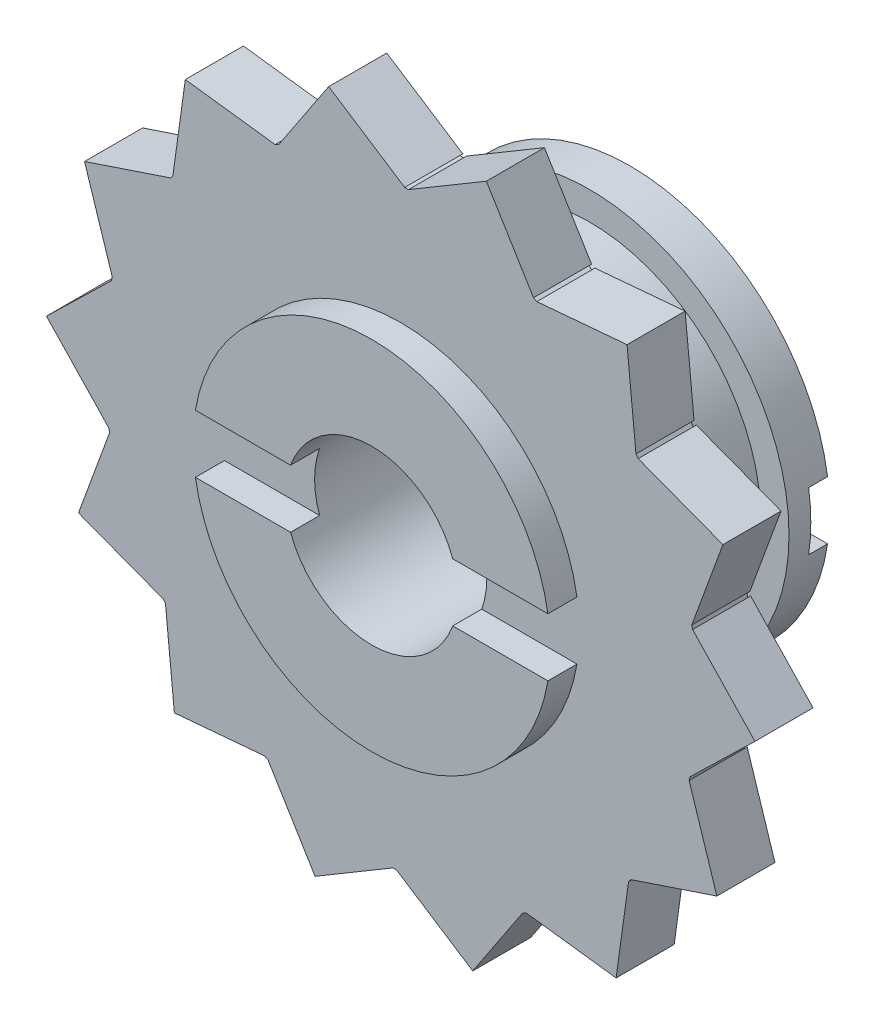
ISO-10303-21;
HEADER;
FILE_DESCRIPTION(('STEP AP214'),'2;1');
FILE_NAME('part.step','',(''),(''),'','','');
FILE_SCHEMA(('AUTOMOTIVE_DESIGN { 1 0 10303 214 1 1 1 1 }'));
ENDSEC;
DATA;
#1=APPLICATION_CONTEXT('core data for automotive mechanical design processes');
#2=APPLICATION_PROTOCOL_DEFINITION('international standard','automotive_design',2000,#1);
#3=PRODUCT_CONTEXT('',#1,'mechanical');
#4=PRODUCT('Part','Part','',(#3));
#5=PRODUCT_RELATED_PRODUCT_CATEGORY('part','',(#4));
#6=PRODUCT_DEFINITION_FORMATION('','',#4);
#7=PRODUCT_DEFINITION_CONTEXT('part definition',#1,'design');
#8=PRODUCT_DEFINITION('design','',#6,#7);
#9=PRODUCT_DEFINITION_SHAPE('','',#8);
#10=(LENGTH_UNIT() NAMED_UNIT(*) SI_UNIT(.MILLI.,.METRE.));
#11=(NAMED_UNIT(*) PLANE_ANGLE_UNIT() SI_UNIT($,.RADIAN.));
#12=(NAMED_UNIT(*) SI_UNIT($,.STERADIAN.) SOLID_ANGLE_UNIT());
#13=UNCERTAINTY_MEASURE_WITH_UNIT(LENGTH_MEASURE(1.E-05),#10,'distance_accuracy_value','');
#14=(GEOMETRIC_REPRESENTATION_CONTEXT(3) GLOBAL_UNCERTAINTY_ASSIGNED_CONTEXT((#13)) GLOBAL_UNIT_ASSIGNED_CONTEXT((#10,
#11,#12)) REPRESENTATION_CONTEXT('',''));
#15=CARTESIAN_POINT('',(0.,0.,0.));
#16=DIRECTION('',(0.,0.,1.));
#17=DIRECTION('',(1.,0.,0.));
#18=AXIS2_PLACEMENT_3D('',#15,#16,#17);
#19=CARTESIAN_POINT('',(0.,0.,1.4));
#20=DIRECTION('',(0.,0.,-1.));
#21=DIRECTION('',(-1.,0.,0.));
#22=AXIS2_PLACEMENT_3D('',#19,#20,#21);
#23=CYLINDRICAL_SURFACE('',#22,6.87);
#24=CARTESIAN_POINT('',(0.,0.,1.4));
#25=DIRECTION('',(0.,0.,-1.));
#26=DIRECTION('',(-1.,0.,0.));
#27=AXIS2_PLACEMENT_3D('',#24,#25,#26);
#28=CIRCLE('',#27,6.87);
#29=CARTESIAN_POINT('',(-6.87,0.,1.4));
#30=VERTEX_POINT('',#29);
#31=EDGE_CURVE('E1326',#30,#30,#28,.F.);
#32=ORIENTED_EDGE('',*,*,#31,.F.);
#33=EDGE_LOOP('',(#32));
#34=FACE_BOUND('',#33,.T.);
#35=DIRECTION('',(0.,0.,-1.));
#36=VECTOR('',#35,1.);
#37=CARTESIAN_POINT('',(-6.79683014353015,1.,1.4));
#38=LINE('',#37,#36);
#39=CARTESIAN_POINT('',(-6.79683014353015,1.,0.));
#40=VERTEX_POINT('',#39);
#41=CARTESIAN_POINT('',(-6.79683014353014,1.00000000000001,0.65));
#42=VERTEX_POINT('',#41);
#43=EDGE_CURVE('E1597',#40,#42,#38,.F.);
#44=ORIENTED_EDGE('',*,*,#43,.T.);
#45=CARTESIAN_POINT('',(0.,0.,0.65));
#46=DIRECTION('',(0.,0.,1.));
#47=DIRECTION('',(-0.989349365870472,0.145560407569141,0.));
#48=AXIS2_PLACEMENT_3D('',#45,#46,#47);
#49=CIRCLE('',#48,6.87);
#50=CARTESIAN_POINT('',(-6.79683014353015,-1.,0.65));
#51=VERTEX_POINT('',#50);
#52=EDGE_CURVE('E916',#42,#51,#49,.T.);
#53=ORIENTED_EDGE('',*,*,#52,.T.);
#54=DIRECTION('',(0.,0.,-1.));
#55=VECTOR('',#54,1.);
#56=CARTESIAN_POINT('',(-6.79683014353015,-1.,1.4));
#57=LINE('',#56,#55);
#58=CARTESIAN_POINT('',(-6.79683014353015,-1.,0.));
#59=VERTEX_POINT('',#58);
#60=EDGE_CURVE('E836',#59,#51,#57,.F.);
#61=ORIENTED_EDGE('',*,*,#60,.F.);
#62=CARTESIAN_POINT('',(0.,0.,0.));
#63=DIRECTION('',(0.,0.,-1.));
#64=DIRECTION('',(-1.,0.,0.));
#65=AXIS2_PLACEMENT_3D('',#62,#63,#64);
#66=CIRCLE('',#65,6.87);
#67=CARTESIAN_POINT('',(6.79683014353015,-1.,0.));
#68=VERTEX_POINT('',#67);
#69=EDGE_CURVE('E844',#68,#59,#66,.T.);
#70=ORIENTED_EDGE('',*,*,#69,.F.);
#71=DIRECTION('',(0.,0.,-1.));
#72=VECTOR('',#71,1.);
#73=CARTESIAN_POINT('',(6.79683014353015,-1.,0.65));
#74=LINE('',#73,#72);
#75=CARTESIAN_POINT('',(6.79683014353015,-1.,0.65));
#76=VERTEX_POINT('',#75);
#77=EDGE_CURVE('E1405',#76,#68,#74,.T.);
#78=ORIENTED_EDGE('',*,*,#77,.F.);
#79=CARTESIAN_POINT('',(0.,0.,0.65));
#80=DIRECTION('',(0.,0.,-1.));
#81=DIRECTION('',(-1.,0.,0.));
#82=AXIS2_PLACEMENT_3D('',#79,#80,#81);
#83=CIRCLE('',#82,6.87);
#84=CARTESIAN_POINT('',(6.79683014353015,1.,0.65));
#85=VERTEX_POINT('',#84);
#86=EDGE_CURVE('E1407',#85,#76,#83,.T.);
#87=ORIENTED_EDGE('',*,*,#86,.F.);
#88=DIRECTION('',(0.,0.,-1.));
#89=VECTOR('',#88,1.);
#90=CARTESIAN_POINT('',(6.79683014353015,1.,0.65));
#91=LINE('',#90,#89);
#92=CARTESIAN_POINT('',(6.79683014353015,1.,0.));
#93=VERTEX_POINT('',#92);
#94=EDGE_CURVE('E1402',#85,#93,#91,.T.);
#95=ORIENTED_EDGE('',*,*,#94,.T.);
#96=EDGE_CURVE('E857',#40,#93,#66,.T.);
#97=ORIENTED_EDGE('',*,*,#96,.F.);
#98=EDGE_LOOP('',(#44,#53,#61,#70,#78,#87,#95,#97));
#99=FACE_BOUND('',#98,.T.);
#100=ADVANCED_FACE('F381',(#34,#99),#23,.T.);
#101=CARTESIAN_POINT('',(0.,0.,0.));
#102=DIRECTION('',(0.,0.,1.));
#103=DIRECTION('',(1.,0.,0.));
#104=AXIS2_PLACEMENT_3D('',#101,#102,#103);
#105=PLANE('',#104);
#106=DIRECTION('',(-1.,0.,0.));
#107=VECTOR('',#106,1.);
#108=CARTESIAN_POINT('',(-15.2554213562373,1.,0.));
#109=LINE('',#108,#107);
#110=CARTESIAN_POINT('',(-2.79127658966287,1.,0.));
#111=VERTEX_POINT('',#110);
#112=EDGE_CURVE('E868',#111,#40,#109,.T.);
#113=ORIENTED_EDGE('',*,*,#112,.T.);
#114=ORIENTED_EDGE('',*,*,#96,.T.);
#115=DIRECTION('',(-1.,0.,0.));
#116=VECTOR('',#115,1.);
#117=CARTESIAN_POINT('',(-15.2554213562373,1.,0.));
#118=LINE('',#117,#116);
#119=CARTESIAN_POINT('',(2.79127658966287,1.,0.));
#120=VERTEX_POINT('',#119);
#121=EDGE_CURVE('E861',#93,#120,#118,.T.);
#122=ORIENTED_EDGE('',*,*,#121,.T.);
#123=CARTESIAN_POINT('',(0.,0.,0.));
#124=DIRECTION('',(0.,0.,1.));
#125=DIRECTION('',(1.,0.,0.));
#126=AXIS2_PLACEMENT_3D('',#123,#124,#125);
#127=CIRCLE('',#126,2.965);
#128=EDGE_CURVE('E853',#120,#111,#127,.T.);
#129=ORIENTED_EDGE('',*,*,#128,.T.);
#130=EDGE_LOOP('',(#113,#114,#122,#129));
#131=FACE_BOUND('',#130,.T.);
#132=ADVANCED_FACE('F898',(#131),#105,.F.);
#133=ORIENTED_EDGE('',*,*,#69,.T.);
#134=DIRECTION('',(-1.,0.,0.));
#135=VECTOR('',#134,1.);
#136=CARTESIAN_POINT('',(-15.2554213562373,-1.,0.));
#137=LINE('',#136,#135);
#138=CARTESIAN_POINT('',(-2.79127658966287,-1.,0.));
#139=VERTEX_POINT('',#138);
#140=EDGE_CURVE('E831',#139,#59,#137,.T.);
#141=ORIENTED_EDGE('',*,*,#140,.F.);
#142=CARTESIAN_POINT('',(2.79127658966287,-1.,0.));
#143=VERTEX_POINT('',#142);
#144=EDGE_CURVE('E841',#139,#143,#127,.T.);
#145=ORIENTED_EDGE('',*,*,#144,.T.);
#146=DIRECTION('',(-1.,0.,0.));
#147=VECTOR('',#146,1.);
#148=CARTESIAN_POINT('',(-15.2554213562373,-1.,0.));
#149=LINE('',#148,#147);
#150=EDGE_CURVE('E871',#68,#143,#149,.T.);
#151=ORIENTED_EDGE('',*,*,#150,.F.);
#152=EDGE_LOOP('',(#133,#141,#145,#151));
#153=FACE_BOUND('',#152,.T.);
#154=ADVANCED_FACE('F383',(#153),#105,.F.);
#155=CARTESIAN_POINT('',(0.,0.,0.));
#156=DIRECTION('',(0.,0.,1.));
#157=DIRECTION('',(1.,0.,0.));
#158=AXIS2_PLACEMENT_3D('',#155,#156,#157);
#159=CYLINDRICAL_SURFACE('',#158,2.965);
#160=CARTESIAN_POINT('',(2.965,0.,1.825));
#161=CARTESIAN_POINT('',(2.96500229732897,0.0621266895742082,1.82499700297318));
#162=CARTESIAN_POINT('',(2.9630307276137,0.124233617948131,1.83004989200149));
#163=CARTESIAN_POINT('',(2.95536389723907,0.246583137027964,1.85003933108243));
#164=CARTESIAN_POINT('',(2.94966945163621,0.30682613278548,1.86497371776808));
#165=CARTESIAN_POINT('',(2.93516554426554,0.42366484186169,1.90411295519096));
#166=CARTESIAN_POINT('',(2.92636234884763,0.480267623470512,1.9282991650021));
#167=CARTESIAN_POINT('',(2.9065108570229,0.588605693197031,1.98515723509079));
#168=CARTESIAN_POINT('',(2.8954619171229,0.640339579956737,2.01783152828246));
#169=CARTESIAN_POINT('',(2.87169730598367,0.73979764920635,2.09226974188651));
#170=CARTESIAN_POINT('',(2.85893223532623,0.787274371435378,2.13434836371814));
#171=CARTESIAN_POINT('',(2.83340842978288,0.874699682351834,2.22573269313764));
#172=CARTESIAN_POINT('',(2.82064969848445,0.91464572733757,2.27504083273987));
#173=CARTESIAN_POINT('',(2.7959975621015,0.987504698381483,2.38196633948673));
#174=CARTESIAN_POINT('',(2.78416172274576,1.02005866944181,2.43984291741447));
#175=CARTESIAN_POINT('',(2.76346994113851,1.07485968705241,2.56077987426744));
#176=CARTESIAN_POINT('',(2.75461271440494,1.09711117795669,2.62383800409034));
#177=CARTESIAN_POINT('',(2.74141197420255,1.12968313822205,2.75049237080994));
#178=CARTESIAN_POINT('',(2.73688975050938,1.14047816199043,2.81394728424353));
#179=CARTESIAN_POINT('',(2.73235048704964,1.15131397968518,2.9419167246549));
#180=CARTESIAN_POINT('',(2.73233141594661,1.15135962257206,3.00643076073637));
#181=CARTESIAN_POINT('',(2.73664737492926,1.14105653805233,3.13023707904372));
#182=CARTESIAN_POINT('',(2.74070061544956,1.13138051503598,3.18959703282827));
#183=CARTESIAN_POINT('',(2.75223382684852,1.10302571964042,3.30577328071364));
#184=CARTESIAN_POINT('',(2.75971435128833,1.084345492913,3.36258916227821));
#185=CARTESIAN_POINT('',(2.77741924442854,1.0381651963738,3.47338477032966));
#186=CARTESIAN_POINT('',(2.78769478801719,1.01049854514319,3.52728652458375));
#187=CARTESIAN_POINT('',(2.80981639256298,0.947247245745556,3.62987188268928));
#188=CARTESIAN_POINT('',(2.82166302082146,0.911659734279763,3.67855359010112));
#189=CARTESIAN_POINT('',(2.8466358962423,0.830550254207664,3.77301993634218));
#190=CARTESIAN_POINT('',(2.85979273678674,0.784496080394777,3.81834070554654));
#191=CARTESIAN_POINT('',(2.88517146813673,0.685295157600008,3.90075898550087));
#192=CARTESIAN_POINT('',(2.89739319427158,0.632147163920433,3.93785505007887));
#193=CARTESIAN_POINT('',(2.91979871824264,0.519017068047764,4.00333105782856));
#194=CARTESIAN_POINT('',(2.92994293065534,0.45893128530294,4.03154638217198));
#195=CARTESIAN_POINT('',(2.94675405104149,0.33437357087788,4.0773115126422));
#196=CARTESIAN_POINT('',(2.95342261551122,0.269903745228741,4.09486640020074));
#197=CARTESIAN_POINT('',(2.96223442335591,0.142304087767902,4.1178971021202));
#198=CARTESIAN_POINT('',(2.96461115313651,0.0793029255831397,4.12399691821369));
#199=CARTESIAN_POINT('',(2.96530010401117,-0.0468609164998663,4.12577426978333));
#200=CARTESIAN_POINT('',(2.96361330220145,-0.110023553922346,4.1214543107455));
#201=CARTESIAN_POINT('',(2.95651824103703,-0.231954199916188,4.10298141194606));
#202=CARTESIAN_POINT('',(2.95126806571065,-0.290795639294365,4.08924592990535));
#203=CARTESIAN_POINT('',(2.93773555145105,-0.405290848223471,4.05289083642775));
#204=CARTESIAN_POINT('',(2.92945281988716,-0.460944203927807,4.03027007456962));
#205=CARTESIAN_POINT('',(2.91035630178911,-0.569362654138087,3.97605457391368));
#206=CARTESIAN_POINT('',(2.89947389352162,-0.621990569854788,3.94421043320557));
#207=CARTESIAN_POINT('',(2.8763698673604,-0.721336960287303,3.87273122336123));
#208=CARTESIAN_POINT('',(2.86414773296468,-0.768053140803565,3.83309314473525));
#209=CARTESIAN_POINT('',(2.83876119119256,-0.857289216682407,3.7442594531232));
#210=CARTESIAN_POINT('',(2.82558540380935,-0.899368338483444,3.69462316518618));
#211=CARTESIAN_POINT('',(2.80049461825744,-0.974697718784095,3.5887471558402));
#212=CARTESIAN_POINT('',(2.78857977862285,-1.00794686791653,3.53250660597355));
#213=CARTESIAN_POINT('',(2.76737733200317,-1.0647906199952,3.41436824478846));
#214=CARTESIAN_POINT('',(2.75810817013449,-1.08831792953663,3.35243451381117));
#215=CARTESIAN_POINT('',(2.74358240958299,-1.12444070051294,3.22502006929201));
#216=CARTESIAN_POINT('',(2.73832308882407,-1.1370435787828,3.1595417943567));
#217=CARTESIAN_POINT('',(2.73279037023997,-1.15027318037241,3.03170987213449));
#218=CARTESIAN_POINT('',(2.73220130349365,-1.15165827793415,2.96944780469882));
#219=CARTESIAN_POINT('',(2.735257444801,-1.14438066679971,2.84562568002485));
#220=CARTESIAN_POINT('',(2.73890218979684,-1.13571905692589,2.78406554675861));
#221=CARTESIAN_POINT('',(2.74974440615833,-1.10919946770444,2.6655893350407));
#222=CARTESIAN_POINT('',(2.75681327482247,-1.09167343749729,2.60858614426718));
#223=CARTESIAN_POINT('',(2.77362421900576,-1.0482240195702,2.4983012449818));
#224=CARTESIAN_POINT('',(2.78336699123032,-1.0222984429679,2.44502051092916));
#225=CARTESIAN_POINT('',(2.80509358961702,-0.961135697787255,2.34050556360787));
#226=CARTESIAN_POINT('',(2.81717115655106,-0.925465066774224,2.28954477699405));
#227=CARTESIAN_POINT('',(2.84190325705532,-0.846476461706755,2.1940912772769));
#228=CARTESIAN_POINT('',(2.85455797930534,-0.803155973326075,2.14960069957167));
#229=CARTESIAN_POINT('',(2.87992297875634,-0.707021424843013,2.06564355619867));
#230=CARTESIAN_POINT('',(2.89259176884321,-0.653795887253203,2.02663336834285));
#231=CARTESIAN_POINT('',(2.91577567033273,-0.541096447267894,1.95811033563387));
#232=CARTESIAN_POINT('',(2.92629035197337,-0.481621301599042,1.92859938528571));
#233=CARTESIAN_POINT('',(2.94461208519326,-0.353497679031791,1.8783656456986));
#234=CARTESIAN_POINT('',(2.95216613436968,-0.284496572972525,1.8584395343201));
#235=CARTESIAN_POINT('',(2.962357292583,-0.143653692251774,1.83176238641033));
#236=CARTESIAN_POINT('',(2.96499734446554,-0.0718136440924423,1.82500346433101));
#237=CARTESIAN_POINT('',(2.965,0.,1.825));
#238=B_SPLINE_CURVE_WITH_KNOTS('',3,(#160,#161,#162,#163,#164,#165,#166,#167,#168,#169,#170,
#171,#172,#173,#174,#175,#176,#177,#178,#179,#180,#181,#182,#183,#184,#185,#186,#187,#188,#189,
#190,#191,#192,#193,#194,#195,#196,#197,#198,#199,#200,#201,#202,#203,#204,#205,#206,#207,#208,
#209,#210,#211,#212,#213,#214,#215,#216,#217,#218,#219,#220,#221,#222,#223,#224,#225,#226,#227,
#228,#229,#230,#231,#232,#233,#234,#235,#236,#237),.UNSPECIFIED.,.T.,.F.,(4,2,2,2,2,2,2,2,2,2,2,
2,2,2,2,2,2,2,2,2,2,2,2,2,2,2,2,2,2,2,2,2,2,2,2,2,2,2,4),(0.,0.186115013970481,
0.372189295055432,0.557890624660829,0.743645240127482,0.936927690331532,1.13027531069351,
1.33161476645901,1.53286728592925,1.72541240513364,1.91787066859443,2.09786984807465,
2.27789811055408,2.46147471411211,2.64511778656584,2.84203711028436,3.03899103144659,
3.23940592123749,3.43972520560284,3.62877457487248,3.8177784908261,3.99890260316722,
4.1800501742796,4.36664504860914,4.55331211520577,4.75157172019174,4.94985622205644,
5.14949111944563,5.34899037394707,5.53487951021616,5.72074831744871,5.90012184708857,
6.07954215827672,6.26882363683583,6.45816744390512,6.6587761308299,6.85942480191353,
7.07468830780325,7.28982285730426),.UNSPECIFIED.);
#239=CARTESIAN_POINT('',(2.965,0.,1.825));
#240=VERTEX_POINT('',#239);
#241=EDGE_CURVE('E1456',#240,#240,#238,.T.);
#242=ORIENTED_EDGE('',*,*,#241,.T.);
#243=EDGE_LOOP('',(#242));
#244=FACE_BOUND('',#243,.T.);
#245=CARTESIAN_POINT('',(-2.965,0.,1.825));
#246=CARTESIAN_POINT('',(-2.96500229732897,-0.0621266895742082,1.82499700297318));
#247=CARTESIAN_POINT('',(-2.9630307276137,-0.124233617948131,1.83004989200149));
#248=CARTESIAN_POINT('',(-2.95536389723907,-0.246583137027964,1.85003933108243));
#249=CARTESIAN_POINT('',(-2.94966945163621,-0.30682613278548,1.86497371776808));
#250=CARTESIAN_POINT('',(-2.93516554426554,-0.42366484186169,1.90411295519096));
#251=CARTESIAN_POINT('',(-2.92636234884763,-0.480267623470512,1.9282991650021));
#252=CARTESIAN_POINT('',(-2.9065108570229,-0.588605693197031,1.98515723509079));
#253=CARTESIAN_POINT('',(-2.8954619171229,-0.640339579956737,2.01783152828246));
#254=CARTESIAN_POINT('',(-2.87169730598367,-0.73979764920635,2.09226974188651));
#255=CARTESIAN_POINT('',(-2.85893223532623,-0.787274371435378,2.13434836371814));
#256=CARTESIAN_POINT('',(-2.83340842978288,-0.874699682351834,2.22573269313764));
#257=CARTESIAN_POINT('',(-2.82064969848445,-0.91464572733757,2.27504083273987));
#258=CARTESIAN_POINT('',(-2.7959975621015,-0.987504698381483,2.38196633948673));
#259=CARTESIAN_POINT('',(-2.78416172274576,-1.02005866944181,2.43984291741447));
#260=CARTESIAN_POINT('',(-2.76346994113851,-1.07485968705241,2.56077987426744));
#261=CARTESIAN_POINT('',(-2.75461271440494,-1.09711117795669,2.62383800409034));
#262=CARTESIAN_POINT('',(-2.74141197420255,-1.12968313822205,2.75049237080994));
#263=CARTESIAN_POINT('',(-2.73688975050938,-1.14047816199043,2.81394728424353));
#264=CARTESIAN_POINT('',(-2.73235048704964,-1.15131397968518,2.9419167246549));
#265=CARTESIAN_POINT('',(-2.73233141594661,-1.15135962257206,3.00643076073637));
#266=CARTESIAN_POINT('',(-2.73664737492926,-1.14105653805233,3.13023707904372));
#267=CARTESIAN_POINT('',(-2.74070061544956,-1.13138051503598,3.18959703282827));
#268=CARTESIAN_POINT('',(-2.75223382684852,-1.10302571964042,3.30577328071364));
#269=CARTESIAN_POINT('',(-2.75971435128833,-1.084345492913,3.36258916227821));
#270=CARTESIAN_POINT('',(-2.77741924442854,-1.0381651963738,3.47338477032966));
#271=CARTESIAN_POINT('',(-2.78769478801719,-1.01049854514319,3.52728652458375));
#272=CARTESIAN_POINT('',(-2.80981639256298,-0.947247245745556,3.62987188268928));
#273=CARTESIAN_POINT('',(-2.82166302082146,-0.911659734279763,3.67855359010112));
#274=CARTESIAN_POINT('',(-2.8466358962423,-0.830550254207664,3.77301993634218));
#275=CARTESIAN_POINT('',(-2.85979273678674,-0.784496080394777,3.81834070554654));
#276=CARTESIAN_POINT('',(-2.88517146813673,-0.685295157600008,3.90075898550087));
#277=CARTESIAN_POINT('',(-2.89739319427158,-0.632147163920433,3.93785505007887));
#278=CARTESIAN_POINT('',(-2.91979871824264,-0.519017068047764,4.00333105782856));
#279=CARTESIAN_POINT('',(-2.92994293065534,-0.45893128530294,4.03154638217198));
#280=CARTESIAN_POINT('',(-2.94675405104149,-0.33437357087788,4.0773115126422));
#281=CARTESIAN_POINT('',(-2.95342261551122,-0.269903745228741,4.09486640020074));
#282=CARTESIAN_POINT('',(-2.96223442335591,-0.142304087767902,4.1178971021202));
#283=CARTESIAN_POINT('',(-2.96461115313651,-0.0793029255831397,4.12399691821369));
#284=CARTESIAN_POINT('',(-2.96530010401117,0.0468609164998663,4.12577426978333));
#285=CARTESIAN_POINT('',(-2.96361330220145,0.110023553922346,4.1214543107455));
#286=CARTESIAN_POINT('',(-2.95651824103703,0.231954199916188,4.10298141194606));
#287=CARTESIAN_POINT('',(-2.95126806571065,0.290795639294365,4.08924592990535));
#288=CARTESIAN_POINT('',(-2.93773555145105,0.405290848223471,4.05289083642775));
#289=CARTESIAN_POINT('',(-2.92945281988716,0.460944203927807,4.03027007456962));
#290=CARTESIAN_POINT('',(-2.91035630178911,0.569362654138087,3.97605457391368));
#291=CARTESIAN_POINT('',(-2.89947389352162,0.621990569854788,3.94421043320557));
#292=CARTESIAN_POINT('',(-2.8763698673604,0.721336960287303,3.87273122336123));
#293=CARTESIAN_POINT('',(-2.86414773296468,0.768053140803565,3.83309314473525));
#294=CARTESIAN_POINT('',(-2.83876119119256,0.857289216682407,3.7442594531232));
#295=CARTESIAN_POINT('',(-2.82558540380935,0.899368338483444,3.69462316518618));
#296=CARTESIAN_POINT('',(-2.80049461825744,0.974697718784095,3.5887471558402));
#297=CARTESIAN_POINT('',(-2.78857977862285,1.00794686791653,3.53250660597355));
#298=CARTESIAN_POINT('',(-2.76737733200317,1.0647906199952,3.41436824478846));
#299=CARTESIAN_POINT('',(-2.75810817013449,1.08831792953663,3.35243451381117));
#300=CARTESIAN_POINT('',(-2.74358240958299,1.12444070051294,3.22502006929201));
#301=CARTESIAN_POINT('',(-2.73832308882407,1.1370435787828,3.1595417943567));
#302=CARTESIAN_POINT('',(-2.73279037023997,1.15027318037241,3.03170987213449));
#303=CARTESIAN_POINT('',(-2.73220130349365,1.15165827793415,2.96944780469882));
#304=CARTESIAN_POINT('',(-2.735257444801,1.14438066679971,2.84562568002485));
#305=CARTESIAN_POINT('',(-2.73890218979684,1.13571905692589,2.78406554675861));
#306=CARTESIAN_POINT('',(-2.74974440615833,1.10919946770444,2.6655893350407));
#307=CARTESIAN_POINT('',(-2.75681327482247,1.09167343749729,2.60858614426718));
#308=CARTESIAN_POINT('',(-2.77362421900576,1.0482240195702,2.4983012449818));
#309=CARTESIAN_POINT('',(-2.78336699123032,1.0222984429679,2.44502051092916));
#310=CARTESIAN_POINT('',(-2.80509358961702,0.961135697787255,2.34050556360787));
#311=CARTESIAN_POINT('',(-2.81717115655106,0.925465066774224,2.28954477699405));
#312=CARTESIAN_POINT('',(-2.84190325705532,0.846476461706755,2.1940912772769));
#313=CARTESIAN_POINT('',(-2.85455797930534,0.803155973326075,2.14960069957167));
#314=CARTESIAN_POINT('',(-2.87992297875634,0.707021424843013,2.06564355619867));
#315=CARTESIAN_POINT('',(-2.89259176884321,0.653795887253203,2.02663336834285));
#316=CARTESIAN_POINT('',(-2.91577567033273,0.541096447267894,1.95811033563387));
#317=CARTESIAN_POINT('',(-2.92629035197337,0.481621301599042,1.92859938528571));
#318=CARTESIAN_POINT('',(-2.94461208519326,0.353497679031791,1.8783656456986));
#319=CARTESIAN_POINT('',(-2.95216613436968,0.284496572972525,1.8584395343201));
#320=CARTESIAN_POINT('',(-2.962357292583,0.143653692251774,1.83176238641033));
#321=CARTESIAN_POINT('',(-2.96499734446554,0.0718136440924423,1.82500346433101));
#322=CARTESIAN_POINT('',(-2.965,0.,1.825));
#323=B_SPLINE_CURVE_WITH_KNOTS('',3,(#245,#246,#247,#248,#249,#250,#251,#252,#253,#254,#255,
#256,#257,#258,#259,#260,#261,#262,#263,#264,#265,#266,#267,#268,#269,#270,#271,#272,#273,#274,
#275,#276,#277,#278,#279,#280,#281,#282,#283,#284,#285,#286,#287,#288,#289,#290,#291,#292,#293,
#294,#295,#296,#297,#298,#299,#300,#301,#302,#303,#304,#305,#306,#307,#308,#309,#310,#311,#312,
#313,#314,#315,#316,#317,#318,#319,#320,#321,#322),.UNSPECIFIED.,.T.,.F.,(4,2,2,2,2,2,2,2,2,2,2,
2,2,2,2,2,2,2,2,2,2,2,2,2,2,2,2,2,2,2,2,2,2,2,2,2,2,2,4),(0.,0.186115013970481,
0.372189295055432,0.557890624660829,0.743645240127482,0.936927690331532,1.13027531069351,
1.33161476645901,1.53286728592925,1.72541240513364,1.91787066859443,2.09786984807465,
2.27789811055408,2.46147471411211,2.64511778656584,2.84203711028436,3.03899103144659,
3.23940592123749,3.43972520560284,3.62877457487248,3.8177784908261,3.99890260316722,
4.1800501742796,4.36664504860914,4.55331211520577,4.75157172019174,4.94985622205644,
5.14949111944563,5.34899037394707,5.53487951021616,5.72074831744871,5.90012184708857,
6.07954215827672,6.26882363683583,6.45816744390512,6.6587761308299,6.85942480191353,
7.07468830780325,7.28982285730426),.UNSPECIFIED.);
#324=CARTESIAN_POINT('',(-2.965,0.,1.825));
#325=VERTEX_POINT('',#324);
#326=EDGE_CURVE('E1451',#325,#325,#323,.T.);
#327=ORIENTED_EDGE('',*,*,#326,.T.);
#328=EDGE_LOOP('',(#327));
#329=FACE_BOUND('',#328,.T.);
#330=DIRECTION('',(0.,0.,1.));
#331=VECTOR('',#330,1.);
#332=CARTESIAN_POINT('',(-2.79127658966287,1.,0.));
#333=LINE('',#332,#331);
#334=CARTESIAN_POINT('',(-2.79127658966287,1.,8.9));
#335=VERTEX_POINT('',#334);
#336=CARTESIAN_POINT('',(-2.79127658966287,1.,7.9));
#337=VERTEX_POINT('',#336);
#338=EDGE_CURVE('E851',#335,#337,#333,.F.);
#339=ORIENTED_EDGE('',*,*,#338,.T.);
#340=CARTESIAN_POINT('',(0.,0.,7.9));
#341=DIRECTION('',(0.,0.,1.));
#342=DIRECTION('',(1.,0.,0.));
#343=AXIS2_PLACEMENT_3D('',#340,#341,#342);
#344=CIRCLE('',#343,2.965);
#345=CARTESIAN_POINT('',(-2.79127658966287,-1.,7.9));
#346=VERTEX_POINT('',#345);
#347=EDGE_CURVE('E854',#337,#346,#344,.T.);
#348=ORIENTED_EDGE('',*,*,#347,.T.);
#349=DIRECTION('',(0.,0.,1.));
#350=VECTOR('',#349,1.);
#351=CARTESIAN_POINT('',(-2.79127658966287,-1.,0.));
#352=LINE('',#351,#350);
#353=CARTESIAN_POINT('',(-2.79127658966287,-1.,8.9));
#354=VERTEX_POINT('',#353);
#355=EDGE_CURVE('E969',#354,#346,#352,.F.);
#356=ORIENTED_EDGE('',*,*,#355,.F.);
#357=CARTESIAN_POINT('',(0.,0.,8.9));
#358=DIRECTION('',(0.,0.,1.));
#359=DIRECTION('',(1.,0.,0.));
#360=AXIS2_PLACEMENT_3D('',#357,#358,#359);
#361=CIRCLE('',#360,2.965);
#362=CARTESIAN_POINT('',(2.79127658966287,-1.,8.9));
#363=VERTEX_POINT('',#362);
#364=EDGE_CURVE('E1007',#354,#363,#361,.T.);
#365=ORIENTED_EDGE('',*,*,#364,.T.);
#366=DIRECTION('',(0.,0.,1.));
#367=VECTOR('',#366,1.);
#368=CARTESIAN_POINT('',(2.79127658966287,-1.,0.));
#369=LINE('',#368,#367);
#370=CARTESIAN_POINT('',(2.79127658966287,-1.,7.9));
#371=VERTEX_POINT('',#370);
#372=EDGE_CURVE('E965',#371,#363,#369,.T.);
#373=ORIENTED_EDGE('',*,*,#372,.F.);
#374=CARTESIAN_POINT('',(2.79127658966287,1.,7.9));
#375=VERTEX_POINT('',#374);
#376=EDGE_CURVE('E1006',#371,#375,#344,.T.);
#377=ORIENTED_EDGE('',*,*,#376,.T.);
#378=DIRECTION('',(0.,0.,1.));
#379=VECTOR('',#378,1.);
#380=CARTESIAN_POINT('',(2.79127658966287,1.,0.));
#381=LINE('',#380,#379);
#382=CARTESIAN_POINT('',(2.79127658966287,1.,8.9));
#383=VERTEX_POINT('',#382);
#384=EDGE_CURVE('E1004',#375,#383,#381,.T.);
#385=ORIENTED_EDGE('',*,*,#384,.T.);
#386=EDGE_CURVE('E1005',#383,#335,#361,.T.);
#387=ORIENTED_EDGE('',*,*,#386,.T.);
#388=EDGE_LOOP('',(#339,#348,#356,#365,#373,#377,#385,#387));
#389=FACE_BOUND('',#388,.T.);
#390=ORIENTED_EDGE('',*,*,#144,.F.);
#391=DIRECTION('',(0.,0.,-1.));
#392=VECTOR('',#391,1.);
#393=CARTESIAN_POINT('',(-2.79127658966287,-1.,0.65));
#394=LINE('',#393,#392);
#395=CARTESIAN_POINT('',(-2.79127658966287,-1.,0.65));
#396=VERTEX_POINT('',#395);
#397=EDGE_CURVE('E828',#396,#139,#394,.T.);
#398=ORIENTED_EDGE('',*,*,#397,.F.);
#399=CARTESIAN_POINT('',(0.,0.,0.65));
#400=DIRECTION('',(0.,0.,-1.));
#401=DIRECTION('',(-1.,0.,0.));
#402=AXIS2_PLACEMENT_3D('',#399,#400,#401);
#403=CIRCLE('',#402,2.965);
#404=CARTESIAN_POINT('',(-2.79127658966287,1.,0.65));
#405=VERTEX_POINT('',#404);
#406=EDGE_CURVE('E395',#405,#396,#403,.F.);
#407=ORIENTED_EDGE('',*,*,#406,.F.);
#408=DIRECTION('',(0.,0.,-1.));
#409=VECTOR('',#408,1.);
#410=CARTESIAN_POINT('',(-2.79127658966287,1.,0.65));
#411=LINE('',#410,#409);
#412=EDGE_CURVE('E1409',#405,#111,#411,.T.);
#413=ORIENTED_EDGE('',*,*,#412,.T.);
#414=ORIENTED_EDGE('',*,*,#128,.F.);
#415=DIRECTION('',(0.,0.,-1.));
#416=VECTOR('',#415,1.);
#417=CARTESIAN_POINT('',(2.79127658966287,1.,0.65));
#418=LINE('',#417,#416);
#419=CARTESIAN_POINT('',(2.79127658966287,1.,0.65));
#420=VERTEX_POINT('',#419);
#421=EDGE_CURVE('E1410',#420,#120,#418,.T.);
#422=ORIENTED_EDGE('',*,*,#421,.F.);
#423=CARTESIAN_POINT('',(0.,0.,0.65));
#424=DIRECTION('',(0.,0.,-1.));
#425=DIRECTION('',(-1.,0.,0.));
#426=AXIS2_PLACEMENT_3D('',#423,#424,#425);
#427=CIRCLE('',#426,2.965);
#428=CARTESIAN_POINT('',(2.79127658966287,-1.,0.65));
#429=VERTEX_POINT('',#428);
#430=EDGE_CURVE('E879',#429,#420,#427,.F.);
#431=ORIENTED_EDGE('',*,*,#430,.F.);
#432=DIRECTION('',(0.,0.,-1.));
#433=VECTOR('',#432,1.);
#434=CARTESIAN_POINT('',(2.79127658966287,-1.,0.65));
#435=LINE('',#434,#433);
#436=EDGE_CURVE('E850',#429,#143,#435,.T.);
#437=ORIENTED_EDGE('',*,*,#436,.T.);
#438=EDGE_LOOP('',(#390,#398,#407,#413,#414,#422,#431,#437));
#439=FACE_BOUND('',#438,.T.);
#440=ADVANCED_FACE('F848',(#244,#329,#389,#439),#159,.F.);
#441=CARTESIAN_POINT('',(0.,0.,8.9));
#442=DIRECTION('',(0.,0.,-1.));
#443=DIRECTION('',(-1.,0.,0.));
#444=AXIS2_PLACEMENT_3D('',#441,#442,#443);
#445=CYLINDRICAL_SURFACE('',#444,10.25);
#446=CARTESIAN_POINT('',(0.,0.,6.));
#447=DIRECTION('',(0.,0.,-1.));
#448=DIRECTION('',(-1.,0.,0.));
#449=AXIS2_PLACEMENT_3D('',#446,#447,#448);
#450=CIRCLE('',#449,10.25);
#451=CARTESIAN_POINT('',(-9.96133155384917,2.41544481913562,6.));
#452=VERTEX_POINT('',#451);
#453=CARTESIAN_POINT('',(-9.93031489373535,2.53995002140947,6.));
#454=VERTEX_POINT('',#453);
#455=EDGE_CURVE('E1389',#452,#454,#450,.T.);
#456=ORIENTED_EDGE('',*,*,#455,.F.);
#457=DIRECTION('',(0.,0.,-1.));
#458=VECTOR('',#457,1.);
#459=CARTESIAN_POINT('',(-9.96133155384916,2.41544481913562,15.9));
#460=LINE('',#459,#458);
#461=CARTESIAN_POINT('',(-9.96133155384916,2.41544481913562,7.9));
#462=VERTEX_POINT('',#461);
#463=EDGE_CURVE('E1240',#462,#452,#460,.T.);
#464=ORIENTED_EDGE('',*,*,#463,.F.);
#465=CARTESIAN_POINT('',(0.,0.,7.9));
#466=DIRECTION('',(0.,0.,1.));
#467=DIRECTION('',(1.,0.,0.));
#468=AXIS2_PLACEMENT_3D('',#465,#466,#467);
#469=CIRCLE('',#468,10.25);
#470=CARTESIAN_POINT('',(-9.93031489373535,2.53995002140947,7.9));
#471=VERTEX_POINT('',#470);
#472=EDGE_CURVE('E930',#462,#471,#469,.F.);
#473=ORIENTED_EDGE('',*,*,#472,.T.);
#474=DIRECTION('',(0.,0.,-1.));
#475=VECTOR('',#474,1.);
#476=CARTESIAN_POINT('',(-9.93031489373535,2.53995002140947,15.9));
#477=LINE('',#476,#475);
#478=EDGE_CURVE('E929',#471,#454,#477,.T.);
#479=ORIENTED_EDGE('',*,*,#478,.T.);
#480=EDGE_LOOP('',(#456,#464,#473,#479));
#481=FACE_BOUND('',#480,.T.);
#482=ADVANCED_FACE('F1444',(#481),#445,.T.);
#483=CARTESIAN_POINT('',(-7.92682738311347,6.49830036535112,6.));
#484=VERTEX_POINT('',#483);
#485=CARTESIAN_POINT('',(-7.84486155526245,6.59701805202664,6.));
#486=VERTEX_POINT('',#485);
#487=EDGE_CURVE('E3024',#484,#486,#450,.T.);
#488=ORIENTED_EDGE('',*,*,#487,.F.);
#489=DIRECTION('',(0.,0.,-1.));
#490=VECTOR('',#489,1.);
#491=CARTESIAN_POINT('',(-7.92682738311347,6.49830036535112,15.9));
#492=LINE('',#491,#490);
#493=CARTESIAN_POINT('',(-7.92682738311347,6.49830036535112,7.9));
#494=VERTEX_POINT('',#493);
#495=EDGE_CURVE('E1268',#494,#484,#492,.T.);
#496=ORIENTED_EDGE('',*,*,#495,.F.);
#497=CARTESIAN_POINT('',(0.,0.,7.9));
#498=DIRECTION('',(0.,0.,1.));
#499=DIRECTION('',(1.,0.,0.));
#500=AXIS2_PLACEMENT_3D('',#497,#498,#499);
#501=CIRCLE('',#500,10.25);
#502=CARTESIAN_POINT('',(-7.84486155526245,6.59701805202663,7.9));
#503=VERTEX_POINT('',#502);
#504=EDGE_CURVE('E927',#494,#503,#501,.F.);
#505=ORIENTED_EDGE('',*,*,#504,.T.);
#506=DIRECTION('',(0.,0.,-1.));
#507=VECTOR('',#506,1.);
#508=CARTESIAN_POINT('',(-7.84486155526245,6.59701805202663,15.9));
#509=LINE('',#508,#507);
#510=EDGE_CURVE('E926',#503,#486,#509,.T.);
#511=ORIENTED_EDGE('',*,*,#510,.T.);
#512=EDGE_LOOP('',(#488,#496,#505,#511));
#513=FACE_BOUND('',#512,.T.);
#514=ADVANCED_FACE('F1636',(#513),#445,.T.);
#515=CARTESIAN_POINT('',(-4.32231783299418,9.29408782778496,6.));
#516=VERTEX_POINT('',#515);
#517=CARTESIAN_POINT('',(-4.20563717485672,9.34746575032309,6.));
#518=VERTEX_POINT('',#517);
#519=EDGE_CURVE('E3019',#516,#518,#450,.T.);
#520=ORIENTED_EDGE('',*,*,#519,.F.);
#521=DIRECTION('',(0.,0.,-1.));
#522=VECTOR('',#521,1.);
#523=CARTESIAN_POINT('',(-4.32231783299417,9.29408782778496,15.9));
#524=LINE('',#523,#522);
#525=CARTESIAN_POINT('',(-4.32231783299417,9.29408782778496,7.9));
#526=VERTEX_POINT('',#525);
#527=EDGE_CURVE('E1280',#526,#516,#524,.T.);
#528=ORIENTED_EDGE('',*,*,#527,.F.);
#529=CARTESIAN_POINT('',(0.,0.,7.9));
#530=DIRECTION('',(0.,0.,1.));
#531=DIRECTION('',(1.,0.,0.));
#532=AXIS2_PLACEMENT_3D('',#529,#530,#531);
#533=CIRCLE('',#532,10.25);
#534=CARTESIAN_POINT('',(-4.20563717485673,9.34746575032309,7.9));
#535=VERTEX_POINT('',#534);
#536=EDGE_CURVE('E924',#526,#535,#533,.F.);
#537=ORIENTED_EDGE('',*,*,#536,.T.);
#538=DIRECTION('',(0.,0.,-1.));
#539=VECTOR('',#538,1.);
#540=CARTESIAN_POINT('',(-4.20563717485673,9.34746575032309,15.9));
#541=LINE('',#540,#539);
#542=EDGE_CURVE('E923',#535,#518,#541,.T.);
#543=ORIENTED_EDGE('',*,*,#542,.T.);
#544=EDGE_LOOP('',(#520,#528,#537,#543));
#545=FACE_BOUND('',#544,.T.);
#546=ADVANCED_FACE('F1643',(#545),#445,.T.);
#547=CARTESIAN_POINT('',(0.138279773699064,10.2490672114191,6.));
#548=VERTEX_POINT('',#547);
#549=CARTESIAN_POINT('',(0.266565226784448,10.2465332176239,6.));
#550=VERTEX_POINT('',#549);
#551=EDGE_CURVE('E3014',#548,#550,#450,.T.);
#552=ORIENTED_EDGE('',*,*,#551,.F.);
#553=DIRECTION('',(0.,0.,-1.));
#554=VECTOR('',#553,1.);
#555=CARTESIAN_POINT('',(0.138279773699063,10.2490672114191,15.9));
#556=LINE('',#555,#554);
#557=CARTESIAN_POINT('',(0.138279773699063,10.2490672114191,7.9));
#558=VERTEX_POINT('',#557);
#559=EDGE_CURVE('E1303',#558,#548,#556,.T.);
#560=ORIENTED_EDGE('',*,*,#559,.F.);
#561=CARTESIAN_POINT('',(0.,0.,7.9));
#562=DIRECTION('',(0.,0.,1.));
#563=DIRECTION('',(1.,0.,0.));
#564=AXIS2_PLACEMENT_3D('',#561,#562,#563);
#565=CIRCLE('',#564,10.25);
#566=CARTESIAN_POINT('',(0.266565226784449,10.2465332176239,7.9));
#567=VERTEX_POINT('',#566);
#568=EDGE_CURVE('E921',#558,#567,#565,.F.);
#569=ORIENTED_EDGE('',*,*,#568,.T.);
#570=DIRECTION('',(0.,0.,-1.));
#571=VECTOR('',#570,1.);
#572=CARTESIAN_POINT('',(0.266565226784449,10.2465332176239,15.9));
#573=LINE('',#572,#571);
#574=EDGE_CURVE('E920',#567,#550,#573,.T.);
#575=ORIENTED_EDGE('',*,*,#574,.T.);
#576=EDGE_LOOP('',(#552,#560,#569,#575));
#577=FACE_BOUND('',#576,.T.);
#578=ADVANCED_FACE('F1650',(#577),#445,.T.);
#579=CARTESIAN_POINT('',(4.57148937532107,9.17409313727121,6.));
#580=VERTEX_POINT('',#579);
#581=CARTESIAN_POINT('',(4.685971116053,9.11614911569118,6.));
#582=VERTEX_POINT('',#581);
#583=EDGE_CURVE('E3010',#580,#582,#450,.T.);
#584=ORIENTED_EDGE('',*,*,#583,.F.);
#585=DIRECTION('',(0.,0.,-1.));
#586=VECTOR('',#585,1.);
#587=CARTESIAN_POINT('',(4.57148937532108,9.1740931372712,15.9));
#588=LINE('',#587,#586);
#589=CARTESIAN_POINT('',(4.57148937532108,9.1740931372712,7.9));
#590=VERTEX_POINT('',#589);
#591=EDGE_CURVE('E1315',#590,#580,#588,.T.);
#592=ORIENTED_EDGE('',*,*,#591,.F.);
#593=CARTESIAN_POINT('',(0.,0.,7.9));
#594=DIRECTION('',(0.,0.,1.));
#595=DIRECTION('',(1.,0.,0.));
#596=AXIS2_PLACEMENT_3D('',#593,#594,#595);
#597=CIRCLE('',#596,10.25);
#598=CARTESIAN_POINT('',(4.685971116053,9.11614911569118,7.9));
#599=VERTEX_POINT('',#598);
#600=EDGE_CURVE('E917',#590,#599,#597,.F.);
#601=ORIENTED_EDGE('',*,*,#600,.T.);
#602=DIRECTION('',(0.,0.,-1.));
#603=VECTOR('',#602,1.);
#604=CARTESIAN_POINT('',(4.685971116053,9.11614911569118,15.9));
#605=LINE('',#604,#603);
#606=EDGE_CURVE('E919',#599,#582,#605,.T.);
#607=ORIENTED_EDGE('',*,*,#606,.T.);
#608=EDGE_LOOP('',(#584,#592,#601,#607));
#609=FACE_BOUND('',#608,.T.);
#610=ADVANCED_FACE('F1657',(#609),#445,.T.);
#611=CARTESIAN_POINT('',(8.09925944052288,6.28207740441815,6.));
#612=VERTEX_POINT('',#611);
#613=CARTESIAN_POINT('',(8.17726295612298,6.18019987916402,6.));
#614=VERTEX_POINT('',#613);
#615=EDGE_CURVE('E3009',#612,#614,#450,.T.);
#616=ORIENTED_EDGE('',*,*,#615,.F.);
#617=DIRECTION('',(0.,0.,-1.));
#618=VECTOR('',#617,1.);
#619=CARTESIAN_POINT('',(8.09925944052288,6.28207740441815,15.9));
#620=LINE('',#619,#618);
#621=CARTESIAN_POINT('',(8.09925944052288,6.28207740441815,7.9));
#622=VERTEX_POINT('',#621);
#623=EDGE_CURVE('E1033',#622,#612,#620,.T.);
#624=ORIENTED_EDGE('',*,*,#623,.F.);
#625=CARTESIAN_POINT('',(0.,0.,7.9));
#626=DIRECTION('',(0.,0.,1.));
#627=DIRECTION('',(1.,0.,0.));
#628=AXIS2_PLACEMENT_3D('',#625,#626,#627);
#629=CIRCLE('',#628,10.25);
#630=CARTESIAN_POINT('',(8.17726295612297,6.18019987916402,7.9));
#631=VERTEX_POINT('',#630);
#632=EDGE_CURVE('E1318',#622,#631,#629,.F.);
#633=ORIENTED_EDGE('',*,*,#632,.T.);
#634=DIRECTION('',(0.,0.,-1.));
#635=VECTOR('',#634,1.);
#636=CARTESIAN_POINT('',(8.17726295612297,6.18019987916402,15.9));
#637=LINE('',#636,#635);
#638=EDGE_CURVE('E1044',#631,#614,#637,.T.);
#639=ORIENTED_EDGE('',*,*,#638,.T.);
#640=EDGE_LOOP('',(#616,#624,#633,#639));
#641=FACE_BOUND('',#640,.T.);
#642=ADVANCED_FACE('F1664',(#641),#445,.T.);
#643=CARTESIAN_POINT('',(10.0228718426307,2.14581919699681,6.));
#644=VERTEX_POINT('',#643);
#645=CARTESIAN_POINT('',(10.0489475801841,2.020186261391,6.));
#646=VERTEX_POINT('',#645);
#647=EDGE_CURVE('E3038',#644,#646,#450,.T.);
#648=ORIENTED_EDGE('',*,*,#647,.F.);
#649=DIRECTION('',(0.,0.,-1.));
#650=VECTOR('',#649,1.);
#651=CARTESIAN_POINT('',(10.0228718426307,2.14581919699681,15.9));
#652=LINE('',#651,#650);
#653=CARTESIAN_POINT('',(10.0228718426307,2.14581919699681,7.9));
#654=VERTEX_POINT('',#653);
#655=EDGE_CURVE('E1040',#654,#644,#652,.T.);
#656=ORIENTED_EDGE('',*,*,#655,.F.);
#657=CARTESIAN_POINT('',(0.,0.,7.9));
#658=DIRECTION('',(0.,0.,1.));
#659=DIRECTION('',(1.,0.,0.));
#660=AXIS2_PLACEMENT_3D('',#657,#658,#659);
#661=CIRCLE('',#660,10.25);
#662=CARTESIAN_POINT('',(10.0489475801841,2.020186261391,7.9));
#663=VERTEX_POINT('',#662);
#664=EDGE_CURVE('E1053',#654,#663,#661,.F.);
#665=ORIENTED_EDGE('',*,*,#664,.T.);
#666=DIRECTION('',(0.,0.,-1.));
#667=VECTOR('',#666,1.);
#668=CARTESIAN_POINT('',(10.0489475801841,2.020186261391,15.9));
#669=LINE('',#668,#667);
#670=EDGE_CURVE('E1055',#663,#646,#669,.T.);
#671=ORIENTED_EDGE('',*,*,#670,.T.);
#672=EDGE_LOOP('',(#648,#656,#665,#671));
#673=FACE_BOUND('',#672,.T.);
#674=ADVANCED_FACE('F1671',(#673),#445,.T.);
#675=CARTESIAN_POINT('',(9.96133155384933,-2.41544481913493,6.));
#676=VERTEX_POINT('',#675);
#677=CARTESIAN_POINT('',(9.93031489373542,-2.53995002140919,6.));
#678=VERTEX_POINT('',#677);
#679=EDGE_CURVE('E3043',#676,#678,#450,.T.);
#680=ORIENTED_EDGE('',*,*,#679,.F.);
#681=DIRECTION('',(0.,0.,-1.));
#682=VECTOR('',#681,1.);
#683=CARTESIAN_POINT('',(9.96133155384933,-2.41544481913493,15.9));
#684=LINE('',#683,#682);
#685=CARTESIAN_POINT('',(9.96133155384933,-2.41544481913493,7.9));
#686=VERTEX_POINT('',#685);
#687=EDGE_CURVE('E1093',#686,#676,#684,.T.);
#688=ORIENTED_EDGE('',*,*,#687,.F.);
#689=CARTESIAN_POINT('',(0.,0.,7.9));
#690=DIRECTION('',(0.,0.,1.));
#691=DIRECTION('',(1.,0.,0.));
#692=AXIS2_PLACEMENT_3D('',#689,#690,#691);
#693=CIRCLE('',#692,10.25);
#694=CARTESIAN_POINT('',(9.93031489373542,-2.53995002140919,7.9));
#695=VERTEX_POINT('',#694);
#696=EDGE_CURVE('E1069',#686,#695,#693,.F.);
#697=ORIENTED_EDGE('',*,*,#696,.T.);
#698=DIRECTION('',(0.,0.,-1.));
#699=VECTOR('',#698,1.);
#700=CARTESIAN_POINT('',(9.93031489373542,-2.53995002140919,15.9));
#701=LINE('',#700,#699);
#702=EDGE_CURVE('E1073',#695,#678,#701,.T.);
#703=ORIENTED_EDGE('',*,*,#702,.T.);
#704=EDGE_LOOP('',(#680,#688,#697,#703));
#705=FACE_BOUND('',#704,.T.);
#706=ADVANCED_FACE('F1678',(#705),#445,.T.);
#707=CARTESIAN_POINT('',(7.92682738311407,-6.49830036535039,6.));
#708=VERTEX_POINT('',#707);
#709=CARTESIAN_POINT('',(7.84486155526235,-6.59701805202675,6.));
#710=VERTEX_POINT('',#709);
#711=EDGE_CURVE('E3049',#708,#710,#450,.T.);
#712=ORIENTED_EDGE('',*,*,#711,.F.);
#713=DIRECTION('',(0.,0.,-1.));
#714=VECTOR('',#713,1.);
#715=CARTESIAN_POINT('',(7.92682738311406,-6.49830036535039,15.9));
#716=LINE('',#715,#714);
#717=CARTESIAN_POINT('',(7.92682738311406,-6.49830036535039,7.9));
#718=VERTEX_POINT('',#717);
#719=EDGE_CURVE('E1108',#718,#708,#716,.T.);
#720=ORIENTED_EDGE('',*,*,#719,.F.);
#721=CARTESIAN_POINT('',(0.,0.,7.9));
#722=DIRECTION('',(0.,0.,1.));
#723=DIRECTION('',(1.,0.,0.));
#724=AXIS2_PLACEMENT_3D('',#721,#722,#723);
#725=CIRCLE('',#724,10.25);
#726=CARTESIAN_POINT('',(7.84486155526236,-6.59701805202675,7.9));
#727=VERTEX_POINT('',#726);
#728=EDGE_CURVE('E1099',#718,#727,#725,.F.);
#729=ORIENTED_EDGE('',*,*,#728,.T.);
#730=DIRECTION('',(0.,0.,-1.));
#731=VECTOR('',#730,1.);
#732=CARTESIAN_POINT('',(7.84486155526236,-6.59701805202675,15.9));
#733=LINE('',#732,#731);
#734=EDGE_CURVE('E1101',#727,#710,#733,.T.);
#735=ORIENTED_EDGE('',*,*,#734,.T.);
#736=EDGE_LOOP('',(#712,#720,#729,#735));
#737=FACE_BOUND('',#736,.T.);
#738=ADVANCED_FACE('F1685',(#737),#445,.T.);
#739=CARTESIAN_POINT('',(4.32231783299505,-9.29408782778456,6.));
#740=VERTEX_POINT('',#739);
#741=CARTESIAN_POINT('',(4.20563717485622,-9.34746575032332,6.));
#742=VERTEX_POINT('',#741);
#743=EDGE_CURVE('E3054',#740,#742,#450,.T.);
#744=ORIENTED_EDGE('',*,*,#743,.F.);
#745=DIRECTION('',(0.,0.,-1.));
#746=VECTOR('',#745,1.);
#747=CARTESIAN_POINT('',(4.32231783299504,-9.29408782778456,15.9));
#748=LINE('',#747,#746);
#749=CARTESIAN_POINT('',(4.32231783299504,-9.29408782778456,7.9));
#750=VERTEX_POINT('',#749);
#751=EDGE_CURVE('E1141',#750,#740,#748,.T.);
#752=ORIENTED_EDGE('',*,*,#751,.F.);
#753=CARTESIAN_POINT('',(0.,0.,7.9));
#754=DIRECTION('',(0.,0.,1.));
#755=DIRECTION('',(1.,0.,0.));
#756=AXIS2_PLACEMENT_3D('',#753,#754,#755);
#757=CIRCLE('',#756,10.25);
#758=CARTESIAN_POINT('',(4.20563717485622,-9.34746575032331,7.9));
#759=VERTEX_POINT('',#758);
#760=EDGE_CURVE('E1119',#750,#759,#757,.F.);
#761=ORIENTED_EDGE('',*,*,#760,.T.);
#762=DIRECTION('',(0.,0.,-1.));
#763=VECTOR('',#762,1.);
#764=CARTESIAN_POINT('',(4.20563717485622,-9.34746575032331,15.9));
#765=LINE('',#764,#763);
#766=EDGE_CURVE('E1123',#759,#742,#765,.T.);
#767=ORIENTED_EDGE('',*,*,#766,.T.);
#768=EDGE_LOOP('',(#744,#752,#761,#767));
#769=FACE_BOUND('',#768,.T.);
#770=ADVANCED_FACE('F1692',(#769),#445,.T.);
#771=CARTESIAN_POINT('',(-0.138279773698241,-10.2490672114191,6.));
#772=VERTEX_POINT('',#771);
#773=CARTESIAN_POINT('',(-0.266565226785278,-10.2465332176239,6.));
#774=VERTEX_POINT('',#773);
#775=EDGE_CURVE('E3060',#772,#774,#450,.T.);
#776=ORIENTED_EDGE('',*,*,#775,.F.);
#777=DIRECTION('',(0.,0.,-1.));
#778=VECTOR('',#777,1.);
#779=CARTESIAN_POINT('',(-0.138279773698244,-10.2490672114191,15.9));
#780=LINE('',#779,#778);
#781=CARTESIAN_POINT('',(-0.138279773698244,-10.2490672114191,7.9));
#782=VERTEX_POINT('',#781);
#783=EDGE_CURVE('E1154',#782,#772,#780,.T.);
#784=ORIENTED_EDGE('',*,*,#783,.F.);
#785=CARTESIAN_POINT('',(0.,0.,7.9));
#786=DIRECTION('',(0.,0.,1.));
#787=DIRECTION('',(1.,0.,0.));
#788=AXIS2_PLACEMENT_3D('',#785,#786,#787);
#789=CIRCLE('',#788,10.25);
#790=CARTESIAN_POINT('',(-0.266565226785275,-10.2465332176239,7.9));
#791=VERTEX_POINT('',#790);
#792=EDGE_CURVE('E1147',#782,#791,#789,.F.);
#793=ORIENTED_EDGE('',*,*,#792,.T.);
#794=DIRECTION('',(0.,0.,-1.));
#795=VECTOR('',#794,1.);
#796=CARTESIAN_POINT('',(-0.266565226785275,-10.2465332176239,15.9));
#797=LINE('',#796,#795);
#798=EDGE_CURVE('E941',#791,#774,#797,.T.);
#799=ORIENTED_EDGE('',*,*,#798,.T.);
#800=EDGE_LOOP('',(#776,#784,#793,#799));
#801=FACE_BOUND('',#800,.T.);
#802=ADVANCED_FACE('F1699',(#801),#445,.T.);
#803=CARTESIAN_POINT('',(-4.57148937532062,-9.17409313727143,6.));
#804=VERTEX_POINT('',#803);
#805=CARTESIAN_POINT('',(-4.68597111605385,-9.11614911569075,6.));
#806=VERTEX_POINT('',#805);
#807=EDGE_CURVE('E3065',#804,#806,#450,.T.);
#808=ORIENTED_EDGE('',*,*,#807,.F.);
#809=DIRECTION('',(0.,0.,-1.));
#810=VECTOR('',#809,1.);
#811=CARTESIAN_POINT('',(-4.57148937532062,-9.17409313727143,15.9));
#812=LINE('',#811,#810);
#813=CARTESIAN_POINT('',(-4.57148937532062,-9.17409313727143,7.9));
#814=VERTEX_POINT('',#813);
#815=EDGE_CURVE('E1158',#814,#804,#812,.T.);
#816=ORIENTED_EDGE('',*,*,#815,.F.);
#817=CARTESIAN_POINT('',(0.,0.,7.9));
#818=DIRECTION('',(0.,0.,1.));
#819=DIRECTION('',(1.,0.,0.));
#820=AXIS2_PLACEMENT_3D('',#817,#818,#819);
#821=CIRCLE('',#820,10.25);
#822=CARTESIAN_POINT('',(-4.68597111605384,-9.11614911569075,7.9));
#823=VERTEX_POINT('',#822);
#824=EDGE_CURVE('E939',#814,#823,#821,.F.);
#825=ORIENTED_EDGE('',*,*,#824,.T.);
#826=DIRECTION('',(0.,0.,-1.));
#827=VECTOR('',#826,1.);
#828=CARTESIAN_POINT('',(-4.68597111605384,-9.11614911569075,15.9));
#829=LINE('',#828,#827);
#830=EDGE_CURVE('E938',#823,#806,#829,.T.);
#831=ORIENTED_EDGE('',*,*,#830,.T.);
#832=EDGE_LOOP('',(#808,#816,#825,#831));
#833=FACE_BOUND('',#832,.T.);
#834=ADVANCED_FACE('F1706',(#833),#445,.T.);
#835=CARTESIAN_POINT('',(-8.09925944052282,-6.28207740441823,6.));
#836=VERTEX_POINT('',#835);
#837=CARTESIAN_POINT('',(-8.17726295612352,-6.1801998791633,6.));
#838=VERTEX_POINT('',#837);
#839=EDGE_CURVE('E3071',#836,#838,#450,.T.);
#840=ORIENTED_EDGE('',*,*,#839,.F.);
#841=DIRECTION('',(0.,0.,-1.));
#842=VECTOR('',#841,1.);
#843=CARTESIAN_POINT('',(-8.09925944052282,-6.28207740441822,15.9));
#844=LINE('',#843,#842);
#845=CARTESIAN_POINT('',(-8.09925944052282,-6.28207740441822,7.9));
#846=VERTEX_POINT('',#845);
#847=EDGE_CURVE('E1196',#846,#836,#844,.T.);
#848=ORIENTED_EDGE('',*,*,#847,.F.);
#849=CARTESIAN_POINT('',(0.,0.,7.9));
#850=DIRECTION('',(0.,0.,1.));
#851=DIRECTION('',(1.,0.,0.));
#852=AXIS2_PLACEMENT_3D('',#849,#850,#851);
#853=CIRCLE('',#852,10.25);
#854=CARTESIAN_POINT('',(-8.17726295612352,-6.18019987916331,7.9));
#855=VERTEX_POINT('',#854);
#856=EDGE_CURVE('E936',#846,#855,#853,.F.);
#857=ORIENTED_EDGE('',*,*,#856,.T.);
#858=DIRECTION('',(0.,0.,-1.));
#859=VECTOR('',#858,1.);
#860=CARTESIAN_POINT('',(-8.17726295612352,-6.18019987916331,15.9));
#861=LINE('',#860,#859);
#862=EDGE_CURVE('E935',#855,#838,#861,.T.);
#863=ORIENTED_EDGE('',*,*,#862,.T.);
#864=EDGE_LOOP('',(#840,#848,#857,#863));
#865=FACE_BOUND('',#864,.T.);
#866=ADVANCED_FACE('F1713',(#865),#445,.T.);
#867=CARTESIAN_POINT('',(-10.0228718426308,-2.14581919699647,6.));
#868=VERTEX_POINT('',#867);
#869=CARTESIAN_POINT('',(-10.0489475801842,-2.02018626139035,6.));
#870=VERTEX_POINT('',#869);
#871=EDGE_CURVE('E3076',#868,#870,#450,.T.);
#872=ORIENTED_EDGE('',*,*,#871,.F.);
#873=DIRECTION('',(0.,0.,-1.));
#874=VECTOR('',#873,1.);
#875=CARTESIAN_POINT('',(-10.0228718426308,-2.14581919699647,15.9));
#876=LINE('',#875,#874);
#877=CARTESIAN_POINT('',(-10.0228718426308,-2.14581919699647,7.9));
#878=VERTEX_POINT('',#877);
#879=EDGE_CURVE('E1200',#878,#868,#876,.T.);
#880=ORIENTED_EDGE('',*,*,#879,.F.);
#881=CARTESIAN_POINT('',(0.,0.,7.9));
#882=DIRECTION('',(0.,0.,1.));
#883=DIRECTION('',(1.,0.,0.));
#884=AXIS2_PLACEMENT_3D('',#881,#882,#883);
#885=CIRCLE('',#884,10.25);
#886=CARTESIAN_POINT('',(-10.0489475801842,-2.02018626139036,7.9));
#887=VERTEX_POINT('',#886);
#888=EDGE_CURVE('E932',#878,#887,#885,.F.);
#889=ORIENTED_EDGE('',*,*,#888,.T.);
#890=DIRECTION('',(0.,0.,-1.));
#891=VECTOR('',#890,1.);
#892=CARTESIAN_POINT('',(-10.0489475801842,-2.02018626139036,15.9));
#893=LINE('',#892,#891);
#894=EDGE_CURVE('E934',#887,#870,#893,.T.);
#895=ORIENTED_EDGE('',*,*,#894,.T.);
#896=EDGE_LOOP('',(#872,#880,#889,#895));
#897=FACE_BOUND('',#896,.T.);
#898=ADVANCED_FACE('F1583',(#897),#445,.T.);
#899=CARTESIAN_POINT('',(0.,0.,4.55));
#900=DIRECTION('',(0.,0.,-1.));
#901=DIRECTION('',(-1.,0.,0.));
#902=AXIS2_PLACEMENT_3D('',#899,#900,#901);
#903=PLANE('',#902);
#904=CARTESIAN_POINT('',(0.,0.,4.55));
#905=DIRECTION('',(0.,0.,-1.));
#906=DIRECTION('',(-1.,0.,0.));
#907=AXIS2_PLACEMENT_3D('',#904,#905,#906);
#908=CIRCLE('',#907,5.9);
#909=CARTESIAN_POINT('',(-5.9,0.,4.55));
#910=VERTEX_POINT('',#909);
#911=EDGE_CURVE('E1330',#910,#910,#908,.T.);
#912=ORIENTED_EDGE('',*,*,#911,.F.);
#913=EDGE_LOOP('',(#912));
#914=FACE_BOUND('',#913,.T.);
#915=CARTESIAN_POINT('',(0.,0.,4.55));
#916=DIRECTION('',(0.,0.,-1.));
#917=DIRECTION('',(-1.,0.,0.));
#918=AXIS2_PLACEMENT_3D('',#915,#916,#917);
#919=CIRCLE('',#918,6.95);
#920=CARTESIAN_POINT('',(-6.95,0.,4.55));
#921=VERTEX_POINT('',#920);
#922=EDGE_CURVE('E1230',#921,#921,#919,.T.);
#923=ORIENTED_EDGE('',*,*,#922,.T.);
#924=EDGE_LOOP('',(#923));
#925=FACE_BOUND('',#924,.T.);
#926=ADVANCED_FACE('F1580',(#914,#925),#903,.T.);
#927=CARTESIAN_POINT('',(0.,0.,5.9));
#928=DIRECTION('',(0.,0.,1.));
#929=DIRECTION('',(1.,0.,0.));
#930=AXIS2_PLACEMENT_3D('',#927,#928,#929);
#931=PLANE('',#930);
#932=DIRECTION('',(0.860011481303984,0.510274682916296,0.));
#933=VECTOR('',#932,1.);
#934=CARTESIAN_POINT('',(-24.3831937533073,-4.37902495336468,5.9));
#935=LINE('',#934,#933);
#936=CARTESIAN_POINT('',(0.266565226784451,10.2465332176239,5.9));
#937=VERTEX_POINT('',#936);
#938=CARTESIAN_POINT('',(2.94912201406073,11.8381873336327,5.9));
#939=VERTEX_POINT('',#938);
#940=EDGE_CURVE('E1300',#937,#939,#935,.T.);
#941=ORIENTED_EDGE('',*,*,#940,.T.);
#942=DIRECTION('',(-0.52012116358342,0.854092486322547,0.));
#943=VECTOR('',#942,1.);
#944=CARTESIAN_POINT('',(0.111027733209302,16.49863026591,5.9));
#945=LINE('',#944,#943);
#946=CARTESIAN_POINT('',(4.57148937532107,9.17409313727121,5.9));
#947=VERTEX_POINT('',#946);
#948=EDGE_CURVE('E1313',#947,#939,#945,.T.);
#949=ORIENTED_EDGE('',*,*,#948,.F.);
#950=CARTESIAN_POINT('',(0.,0.,5.9));
#951=DIRECTION('',(0.,0.,1.));
#952=DIRECTION('',(1.,0.,0.));
#953=AXIS2_PLACEMENT_3D('',#950,#951,#952);
#954=CIRCLE('',#953,10.25);
#955=EDGE_CURVE('E955',#947,#937,#954,.T.);
#956=ORIENTED_EDGE('',*,*,#955,.T.);
#957=EDGE_LOOP('',(#941,#949,#956));
#958=FACE_BOUND('',#957,.T.);
#959=ADVANCED_FACE('F1582',(#958),#931,.F.);
#960=DIRECTION('',(0.839189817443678,-0.543838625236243,0.));
#961=VECTOR('',#960,1.);
#962=CARTESIAN_POINT('',(-14.2829777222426,19.5947917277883,5.9));
#963=LINE('',#962,#961);
#964=CARTESIAN_POINT('',(-2.47932986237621,11.9454143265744,5.9));
#965=VERTEX_POINT('',#964);
#966=CARTESIAN_POINT('',(0.138279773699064,10.2490672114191,5.9));
#967=VERTEX_POINT('',#966);
#968=EDGE_CURVE('E1297',#965,#967,#963,.T.);
#969=ORIENTED_EDGE('',*,*,#968,.T.);
#970=CARTESIAN_POINT('',(-4.20563717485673,9.34746575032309,5.9));
#971=VERTEX_POINT('',#970);
#972=EDGE_CURVE('E954',#967,#971,#954,.T.);
#973=ORIENTED_EDGE('',*,*,#972,.T.);
#974=DIRECTION('',(-0.55344368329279,-0.83288660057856,0.));
#975=VECTOR('',#974,1.);
#976=CARTESIAN_POINT('',(-15.4906266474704,-7.63550253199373,5.9));
#977=LINE('',#976,#975);
#978=EDGE_CURVE('E1281',#965,#971,#977,.T.);
#979=ORIENTED_EDGE('',*,*,#978,.F.);
#980=EDGE_LOOP('',(#969,#973,#979));
#981=FACE_BOUND('',#980,.T.);
#982=ADVANCED_FACE('F1736',(#981),#931,.F.);
#983=CARTESIAN_POINT('',(8.09925944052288,6.28207740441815,5.9));
#984=VERTEX_POINT('',#983);
#985=CARTESIAN_POINT('',(4.685971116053,9.11614911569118,5.9));
#986=VERTEX_POINT('',#985);
#987=EDGE_CURVE('E950',#984,#986,#954,.T.);
#988=ORIENTED_EDGE('',*,*,#987,.T.);
#989=DIRECTION('',(-0.996243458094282,-0.0865966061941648,0.));
#990=VECTOR('',#989,1.);
#991=CARTESIAN_POINT('',(-27.5304105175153,6.31580017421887,5.9));
#992=LINE('',#991,#990);
#993=CARTESIAN_POINT('',(7.79346410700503,9.38626215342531,5.9));
#994=VERTEX_POINT('',#993);
#995=EDGE_CURVE('E944',#994,#986,#992,.T.);
#996=ORIENTED_EDGE('',*,*,#995,.F.);
#997=DIRECTION('',(0.0980361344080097,-0.995182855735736,0.));
#998=VECTOR('',#997,1.);
#999=CARTESIAN_POINT('',(8.37499993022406,3.48298491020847,5.9));
#1000=LINE('',#999,#998);
#1001=EDGE_CURVE('E953',#994,#984,#1000,.T.);
#1002=ORIENTED_EDGE('',*,*,#1001,.T.);
#1003=EDGE_LOOP('',(#988,#996,#1002));
#1004=FACE_BOUND('',#1003,.T.);
#1005=ADVANCED_FACE('F1743',(#1004),#931,.F.);
#1006=CARTESIAN_POINT('',(0.,-22.6914213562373,7.9));
#1007=DIRECTION('',(0.,0.,1.));
#1008=DIRECTION('',(1.,0.,0.));
#1009=AXIS2_PLACEMENT_3D('',#1006,#1007,#1008);
#1010=PLANE('',#1009);
#1011=DIRECTION('',(0.52012116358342,-0.854092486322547,0.));
#1012=VECTOR('',#1011,1.);
#1013=CARTESIAN_POINT('',(17.4904503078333,-12.0401704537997,7.9));
#1014=LINE('',#1013,#1012);
#1015=CARTESIAN_POINT('',(2.94912201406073,11.8381873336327,7.9));
#1016=VERTEX_POINT('',#1015);
#1017=EDGE_CURVE('E1311',#1016,#590,#1014,.T.);
#1018=ORIENTED_EDGE('',*,*,#1017,.F.);
#1019=DIRECTION('',(-0.860011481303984,-0.510274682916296,0.));
#1020=VECTOR('',#1019,1.);
#1021=CARTESIAN_POINT('',(-14.3851523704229,1.55316026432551,7.9));
#1022=LINE('',#1021,#1020);
#1023=EDGE_CURVE('E1052',#1016,#567,#1022,.T.);
#1024=ORIENTED_EDGE('',*,*,#1023,.T.);
#1025=ORIENTED_EDGE('',*,*,#568,.F.);
#1026=DIRECTION('',(-0.839189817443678,0.543838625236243,0.));
#1027=VECTOR('',#1026,1.);
#1028=CARTESIAN_POINT('',(15.0744042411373,0.569682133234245,7.9));
#1029=LINE('',#1028,#1027);
#1030=CARTESIAN_POINT('',(-2.47932986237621,11.9454143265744,7.9));
#1031=VERTEX_POINT('',#1030);
#1032=EDGE_CURVE('E1256',#558,#1031,#1029,.T.);
#1033=ORIENTED_EDGE('',*,*,#1032,.T.);
#1034=DIRECTION('',(0.55344368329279,0.83288660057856,0.));
#1035=VECTOR('',#1034,1.);
#1036=CARTESIAN_POINT('',(-17.6859626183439,-10.9393001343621,7.9));
#1037=LINE('',#1036,#1035);
#1038=EDGE_CURVE('E1274',#535,#1031,#1037,.T.);
#1039=ORIENTED_EDGE('',*,*,#1038,.F.);
#1040=ORIENTED_EDGE('',*,*,#536,.F.);
#1041=DIRECTION('',(0.992046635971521,-0.125870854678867,0.));
#1042=VECTOR('',#1041,1.);
#1043=CARTESIAN_POINT('',(3.92554226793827,8.24759952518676,7.9));
#1044=LINE('',#1043,#1042);
#1045=CARTESIAN_POINT('',(-7.41672005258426,9.68670551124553,7.9));
#1046=VERTEX_POINT('',#1045);
#1047=EDGE_CURVE('E1271',#1046,#526,#1044,.T.);
#1048=ORIENTED_EDGE('',*,*,#1047,.F.);
#1049=DIRECTION('',(-0.137259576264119,-0.990535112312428,0.));
#1050=VECTOR('',#1049,1.);
#1051=CARTESIAN_POINT('',(-11.6791316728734,-21.0730308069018,7.9));
#1052=LINE('',#1051,#1050);
#1053=EDGE_CURVE('E1253',#1046,#503,#1052,.T.);
#1054=ORIENTED_EDGE('',*,*,#1053,.T.);
#1055=ORIENTED_EDGE('',*,*,#504,.F.);
#1056=DIRECTION('',(-0.948416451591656,-0.317027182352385,0.));
#1057=VECTOR('',#1056,1.);
#1058=CARTESIAN_POINT('',(-9.57327998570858,5.94794062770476,7.9));
#1059=LINE('',#1058,#1057);
#1060=CARTESIAN_POINT('',(-10.8851378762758,5.50942586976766,7.9));
#1061=VERTEX_POINT('',#1060);
#1062=EDGE_CURVE('E1214',#494,#1061,#1059,.T.);
#1063=ORIENTED_EDGE('',*,*,#1062,.T.);
#1064=DIRECTION('',(-0.306110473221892,0.951995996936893,0.));
#1065=VECTOR('',#1064,1.);
#1066=CARTESIAN_POINT('',(-1.64698448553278,-23.2210025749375,7.9));
#1067=LINE('',#1066,#1065);
#1068=EDGE_CURVE('E1234',#471,#1061,#1067,.T.);
#1069=ORIENTED_EDGE('',*,*,#1068,.F.);
#1070=ORIENTED_EDGE('',*,*,#472,.F.);
#1071=DIRECTION('',(0.716940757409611,0.697134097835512,0.));
#1072=VECTOR('',#1071,1.);
#1073=CARTESIAN_POINT('',(-17.3896751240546,-4.80767862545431,7.9));
#1074=LINE('',#1073,#1072);
#1075=CARTESIAN_POINT('',(-12.1976206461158,0.240936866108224,7.9));
#1076=VERTEX_POINT('',#1075);
#1077=EDGE_CURVE('E1233',#1076,#462,#1074,.T.);
#1078=ORIENTED_EDGE('',*,*,#1077,.F.);
#1079=DIRECTION('',(0.688851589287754,-0.724902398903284,0.));
#1080=VECTOR('',#1079,1.);
#1081=CARTESIAN_POINT('',(5.04162872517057,-17.9005226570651,7.9));
#1082=LINE('',#1081,#1080);
#1083=EDGE_CURVE('E1211',#1076,#887,#1082,.T.);
#1084=ORIENTED_EDGE('',*,*,#1083,.T.);
#1085=ORIENTED_EDGE('',*,*,#888,.F.);
#1086=DIRECTION('',(-0.343466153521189,-0.939165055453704,0.));
#1087=VECTOR('',#1086,1.);
#1088=CARTESIAN_POINT('',(-15.467907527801,-17.0345853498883,7.9));
#1089=LINE('',#1088,#1087);
#1090=CARTESIAN_POINT('',(-11.0942150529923,-5.07527263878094,7.9));
#1091=VERTEX_POINT('',#1090);
#1092=EDGE_CURVE('E1172',#878,#1091,#1089,.T.);
#1093=ORIENTED_EDGE('',*,*,#1092,.T.);
#1094=DIRECTION('',(-0.935157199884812,0.354232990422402,0.));
#1095=VECTOR('',#1094,1.);
#1096=CARTESIAN_POINT('',(4.44347430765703,-10.9608736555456,7.9));
#1097=LINE('',#1096,#1095);
#1098=EDGE_CURVE('E1190',#855,#1091,#1097,.T.);
#1099=ORIENTED_EDGE('',*,*,#1098,.F.);
#1100=ORIENTED_EDGE('',*,*,#856,.F.);
#1101=DIRECTION('',(-0.0980361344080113,0.995182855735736,0.));
#1102=VECTOR('',#1101,1.);
#1103=CARTESIAN_POINT('',(-6.42045751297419,-23.3239049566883,7.9));
#1104=LINE('',#1103,#1102);
#1105=CARTESIAN_POINT('',(-7.79346410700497,-9.38626215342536,7.9));
#1106=VERTEX_POINT('',#1105);
#1107=EDGE_CURVE('E1194',#1106,#846,#1104,.T.);
#1108=ORIENTED_EDGE('',*,*,#1107,.F.);
#1109=DIRECTION('',(0.996243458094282,0.0865966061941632,0.));
#1110=VECTOR('',#1109,1.);
#1111=CARTESIAN_POINT('',(-1.20629638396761,-8.81368487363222,7.9));
#1112=LINE('',#1111,#1110);
#1113=EDGE_CURVE('E1169',#1106,#823,#1112,.T.);
#1114=ORIENTED_EDGE('',*,*,#1113,.T.);
#1115=ORIENTED_EDGE('',*,*,#824,.F.);
#1116=DIRECTION('',(0.520121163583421,-0.854092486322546,0.));
#1117=VECTOR('',#1116,1.);
#1118=CARTESIAN_POINT('',(2.67004151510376,-21.0654322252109,7.9));
#1119=LINE('',#1118,#1117);
#1120=CARTESIAN_POINT('',(-2.94912201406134,-11.8381873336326,7.9));
#1121=VERTEX_POINT('',#1120);
#1122=EDGE_CURVE('E1127',#814,#1121,#1119,.T.);
#1123=ORIENTED_EDGE('',*,*,#1122,.T.);
#1124=DIRECTION('',(-0.860011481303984,-0.510274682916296,0.));
#1125=VECTOR('',#1124,1.);
#1126=CARTESIAN_POINT('',(-5.53074899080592,-13.369956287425,7.9));
#1127=LINE('',#1126,#1125);
#1128=EDGE_CURVE('E1144',#791,#1121,#1127,.T.);
#1129=ORIENTED_EDGE('',*,*,#1128,.F.);
#1130=ORIENTED_EDGE('',*,*,#792,.F.);
#1131=DIRECTION('',(-0.839189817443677,0.543838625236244,0.));
#1132=VECTOR('',#1131,1.);
#1133=CARTESIAN_POINT('',(5.63759163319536,-13.9921321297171,7.9));
#1134=LINE('',#1133,#1132);
#1135=CARTESIAN_POINT('',(2.47932986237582,-11.9454143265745,7.9));
#1136=VERTEX_POINT('',#1135);
#1137=EDGE_CURVE('E1152',#1136,#782,#1134,.T.);
#1138=ORIENTED_EDGE('',*,*,#1137,.F.);
#1139=DIRECTION('',(0.553443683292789,0.832886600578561,0.));
#1140=VECTOR('',#1139,1.);
#1141=CARTESIAN_POINT('',(-3.23352322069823,-20.5427819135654,7.9));
#1142=LINE('',#1141,#1140);
#1143=EDGE_CURVE('E1124',#1136,#759,#1142,.T.);
#1144=ORIENTED_EDGE('',*,*,#1143,.T.);
#1145=ORIENTED_EDGE('',*,*,#760,.F.);
#1146=DIRECTION('',(0.992046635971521,-0.125870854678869,0.));
#1147=VECTOR('',#1146,1.);
#1148=CARTESIAN_POINT('',(1.74140231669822,-8.96662132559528,7.9));
#1149=LINE('',#1148,#1147);
#1150=CARTESIAN_POINT('',(7.41672005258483,-9.6867055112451,7.9));
#1151=VERTEX_POINT('',#1150);
#1152=EDGE_CURVE('E1078',#750,#1151,#1149,.T.);
#1153=ORIENTED_EDGE('',*,*,#1152,.T.);
#1154=DIRECTION('',(-0.137259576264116,-0.990535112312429,0.));
#1155=VECTOR('',#1154,1.);
#1156=CARTESIAN_POINT('',(5.50886087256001,-23.4547904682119,7.9));
#1157=LINE('',#1156,#1155);
#1158=EDGE_CURVE('E1102',#727,#1151,#1157,.T.);
#1159=ORIENTED_EDGE('',*,*,#1158,.F.);
#1160=ORIENTED_EDGE('',*,*,#728,.F.);
#1161=DIRECTION('',(-0.948416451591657,-0.317027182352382,0.));
#1162=VECTOR('',#1161,1.);
#1163=CARTESIAN_POINT('',(-4.0721515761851,-10.5091992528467,7.9));
#1164=LINE('',#1163,#1162);
#1165=CARTESIAN_POINT('',(10.885137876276,-5.50942586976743,7.9));
#1166=VERTEX_POINT('',#1165);
#1167=EDGE_CURVE('E1096',#1166,#718,#1164,.T.);
#1168=ORIENTED_EDGE('',*,*,#1167,.F.);
#1169=DIRECTION('',(-0.306110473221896,0.951995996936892,0.));
#1170=VECTOR('',#1169,1.);
#1171=CARTESIAN_POINT('',(14.8722684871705,-17.9093034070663,7.9));
#1172=LINE('',#1171,#1170);
#1173=EDGE_CURVE('E1074',#1166,#695,#1172,.T.);
#1174=ORIENTED_EDGE('',*,*,#1173,.T.);
#1175=ORIENTED_EDGE('',*,*,#696,.F.);
#1176=DIRECTION('',(0.716940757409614,0.697134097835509,0.));
#1177=VECTOR('',#1176,1.);
#1178=CARTESIAN_POINT('',(-5.29284430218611,-17.2481991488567,7.9));
#1179=LINE('',#1178,#1177);
#1180=CARTESIAN_POINT('',(12.1976206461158,-0.240936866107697,7.9));
#1181=VERTEX_POINT('',#1180);
#1182=EDGE_CURVE('E1077',#686,#1181,#1179,.T.);
#1183=ORIENTED_EDGE('',*,*,#1182,.T.);
#1184=DIRECTION('',(0.688851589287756,-0.724902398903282,0.));
#1185=VECTOR('',#1184,1.);
#1186=CARTESIAN_POINT('',(17.6203014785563,-5.94741182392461,7.9));
#1187=LINE('',#1186,#1185);
#1188=EDGE_CURVE('E948',#663,#1181,#1187,.T.);
#1189=ORIENTED_EDGE('',*,*,#1188,.F.);
#1190=ORIENTED_EDGE('',*,*,#664,.F.);
#1191=DIRECTION('',(-0.343466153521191,-0.939165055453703,0.));
#1192=VECTOR('',#1191,1.);
#1193=CARTESIAN_POINT('',(0.828700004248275,-22.9944888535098,7.9));
#1194=LINE('',#1193,#1192);
#1195=CARTESIAN_POINT('',(11.0942150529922,5.07527263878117,7.9));
#1196=VERTEX_POINT('',#1195);
#1197=EDGE_CURVE('E1035',#1196,#654,#1194,.T.);
#1198=ORIENTED_EDGE('',*,*,#1197,.F.);
#1199=DIRECTION('',(-0.935157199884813,0.354232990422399,0.));
#1200=VECTOR('',#1199,1.);
#1201=CARTESIAN_POINT('',(10.5902064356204,5.26618864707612,7.9));
#1202=LINE('',#1201,#1200);
#1203=EDGE_CURVE('E1081',#1196,#631,#1202,.T.);
#1204=ORIENTED_EDGE('',*,*,#1203,.T.);
#1205=ORIENTED_EDGE('',*,*,#632,.F.);
#1206=DIRECTION('',(-0.0980361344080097,0.995182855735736,0.));
#1207=VECTOR('',#1206,1.);
#1208=CARTESIAN_POINT('',(10.8481837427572,-21.6227594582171,7.9));
#1209=LINE('',#1208,#1207);
#1210=CARTESIAN_POINT('',(7.79346410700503,9.38626215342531,7.9));
#1211=VERTEX_POINT('',#1210);
#1212=EDGE_CURVE('E984',#622,#1211,#1209,.T.);
#1213=ORIENTED_EDGE('',*,*,#1212,.T.);
#1214=DIRECTION('',(0.996243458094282,0.0865966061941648,0.));
#1215=VECTOR('',#1214,1.);
#1216=CARTESIAN_POINT('',(-2.70894056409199,8.47336019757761,7.9));
#1217=LINE('',#1216,#1215);
#1218=EDGE_CURVE('E945',#599,#1211,#1217,.T.);
#1219=ORIENTED_EDGE('',*,*,#1218,.F.);
#1220=ORIENTED_EDGE('',*,*,#600,.F.);
#1221=EDGE_LOOP('',(#1018,#1024,#1025,#1033,#1039,#1040,#1048,#1054,#1055,#1063,#1069,#1070,
#1078,#1084,#1085,#1093,#1099,#1100,#1108,#1114,#1115,#1123,#1129,#1130,#1138,#1144,#1145,#1153,
#1159,#1160,#1168,#1174,#1175,#1183,#1189,#1190,#1198,#1204,#1205,#1213,#1219,#1220));
#1222=FACE_BOUND('',#1221,.T.);
#1223=ORIENTED_EDGE('',*,*,#347,.F.);
#1224=DIRECTION('',(1.,0.,0.));
#1225=VECTOR('',#1224,1.);
#1226=CARTESIAN_POINT('',(0.,1.,7.9));
#1227=LINE('',#1226,#1225);
#1228=CARTESIAN_POINT('',(-6.06815457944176,1.,7.9));
#1229=VERTEX_POINT('',#1228);
#1230=EDGE_CURVE('E973',#1229,#337,#1227,.T.);
#1231=ORIENTED_EDGE('',*,*,#1230,.F.);
#1232=CARTESIAN_POINT('',(0.,0.,7.9));
#1233=DIRECTION('',(0.,0.,1.));
#1234=DIRECTION('',(1.,0.,0.));
#1235=AXIS2_PLACEMENT_3D('',#1232,#1233,#1234);
#1236=CIRCLE('',#1235,6.15);
#1237=CARTESIAN_POINT('',(6.06815457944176,1.,7.9));
#1238=VERTEX_POINT('',#1237);
#1239=EDGE_CURVE('E974',#1238,#1229,#1236,.T.);
#1240=ORIENTED_EDGE('',*,*,#1239,.F.);
#1241=DIRECTION('',(1.,0.,0.));
#1242=VECTOR('',#1241,1.);
#1243=CARTESIAN_POINT('',(0.,1.,7.9));
#1244=LINE('',#1243,#1242);
#1245=EDGE_CURVE('E961',#375,#1238,#1244,.T.);
#1246=ORIENTED_EDGE('',*,*,#1245,.F.);
#1247=ORIENTED_EDGE('',*,*,#376,.F.);
#1248=DIRECTION('',(1.,0.,0.));
#1249=VECTOR('',#1248,1.);
#1250=CARTESIAN_POINT('',(0.,-1.,7.9));
#1251=LINE('',#1250,#1249);
#1252=CARTESIAN_POINT('',(6.06815457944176,-1.,7.9));
#1253=VERTEX_POINT('',#1252);
#1254=EDGE_CURVE('E982',#371,#1253,#1251,.T.);
#1255=ORIENTED_EDGE('',*,*,#1254,.T.);
#1256=CARTESIAN_POINT('',(-6.06815457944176,-1.,7.9));
#1257=VERTEX_POINT('',#1256);
#1258=EDGE_CURVE('E966',#1257,#1253,#1236,.T.);
#1259=ORIENTED_EDGE('',*,*,#1258,.F.);
#1260=DIRECTION('',(1.,0.,0.));
#1261=VECTOR('',#1260,1.);
#1262=CARTESIAN_POINT('',(0.,-1.,7.9));
#1263=LINE('',#1262,#1261);
#1264=EDGE_CURVE('E978',#1257,#346,#1263,.T.);
#1265=ORIENTED_EDGE('',*,*,#1264,.T.);
#1266=EDGE_LOOP('',(#1223,#1231,#1240,#1246,#1247,#1255,#1259,#1265));
#1267=FACE_BOUND('',#1266,.T.);
#1268=ADVANCED_FACE('F1020',(#1222,#1267),#1010,.T.);
#1269=DIRECTION('',(0.137259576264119,0.990535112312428,0.));
#1270=VECTOR('',#1269,1.);
#1271=CARTESIAN_POINT('',(-9.10233141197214,-2.47752581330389,5.9));
#1272=LINE('',#1271,#1270);
#1273=CARTESIAN_POINT('',(-7.84486155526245,6.59701805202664,5.9));
#1274=VERTEX_POINT('',#1273);
#1275=CARTESIAN_POINT('',(-7.41672005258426,9.68670551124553,5.9));
#1276=VERTEX_POINT('',#1275);
#1277=EDGE_CURVE('E981',#1274,#1276,#1272,.T.);
#1278=ORIENTED_EDGE('',*,*,#1277,.T.);
#1279=DIRECTION('',(-0.992046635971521,0.125870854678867,0.));
#1280=VECTOR('',#1279,1.);
#1281=CARTESIAN_POINT('',(-25.4618719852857,11.9762739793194,5.9));
#1282=LINE('',#1281,#1280);
#1283=CARTESIAN_POINT('',(-4.32231783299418,9.29408782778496,5.9));
#1284=VERTEX_POINT('',#1283);
#1285=EDGE_CURVE('E1278',#1284,#1276,#1282,.T.);
#1286=ORIENTED_EDGE('',*,*,#1285,.F.);
#1287=EDGE_CURVE('E1261',#1284,#1274,#954,.T.);
#1288=ORIENTED_EDGE('',*,*,#1287,.T.);
#1289=EDGE_LOOP('',(#1278,#1286,#1288));
#1290=FACE_BOUND('',#1289,.T.);
#1291=ADVANCED_FACE('F1751',(#1290),#931,.F.);
#1292=DIRECTION('',(0.948416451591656,0.317027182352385,0.));
#1293=VECTOR('',#1292,1.);
#1294=CARTESIAN_POINT('',(-27.0201845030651,0.115963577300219,5.9));
#1295=LINE('',#1294,#1293);
#1296=CARTESIAN_POINT('',(-10.8851378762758,5.50942586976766,5.9));
#1297=VERTEX_POINT('',#1296);
#1298=CARTESIAN_POINT('',(-7.92682738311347,6.49830036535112,5.9));
#1299=VERTEX_POINT('',#1298);
#1300=EDGE_CURVE('E1262',#1297,#1299,#1295,.T.);
#1301=ORIENTED_EDGE('',*,*,#1300,.T.);
#1302=CARTESIAN_POINT('',(-9.93031489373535,2.53995002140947,5.9));
#1303=VERTEX_POINT('',#1302);
#1304=EDGE_CURVE('E1224',#1299,#1303,#954,.T.);
#1305=ORIENTED_EDGE('',*,*,#1304,.T.);
#1306=DIRECTION('',(0.306110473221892,-0.951995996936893,0.));
#1307=VECTOR('',#1306,1.);
#1308=CARTESIAN_POINT('',(-10.7878833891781,5.20696682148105,5.9));
#1309=LINE('',#1308,#1307);
#1310=EDGE_CURVE('E1241',#1297,#1303,#1309,.T.);
#1311=ORIENTED_EDGE('',*,*,#1310,.F.);
#1312=EDGE_LOOP('',(#1301,#1305,#1311));
#1313=FACE_BOUND('',#1312,.T.);
#1314=ADVANCED_FACE('F1763',(#1313),#931,.F.);
#1315=DIRECTION('',(-0.688851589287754,0.724902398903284,0.));
#1316=VECTOR('',#1315,1.);
#1317=CARTESIAN_POINT('',(-19.0924663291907,7.49662191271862,5.9));
#1318=LINE('',#1317,#1316);
#1319=CARTESIAN_POINT('',(-10.0489475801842,-2.02018626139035,5.9));
#1320=VERTEX_POINT('',#1319);
#1321=CARTESIAN_POINT('',(-12.1976206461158,0.240936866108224,5.9));
#1322=VERTEX_POINT('',#1321);
#1323=EDGE_CURVE('E1221',#1320,#1322,#1318,.T.);
#1324=ORIENTED_EDGE('',*,*,#1323,.T.);
#1325=DIRECTION('',(-0.716940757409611,-0.697134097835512,0.));
#1326=VECTOR('',#1325,1.);
#1327=CARTESIAN_POINT('',(-19.9169752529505,-7.26515795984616,5.9));
#1328=LINE('',#1327,#1326);
#1329=CARTESIAN_POINT('',(-9.96133155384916,2.41544481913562,5.9));
#1330=VERTEX_POINT('',#1329);
#1331=EDGE_CURVE('E1238',#1330,#1322,#1328,.T.);
#1332=ORIENTED_EDGE('',*,*,#1331,.F.);
#1333=EDGE_CURVE('E1220',#1330,#1320,#954,.T.);
#1334=ORIENTED_EDGE('',*,*,#1333,.T.);
#1335=EDGE_LOOP('',(#1324,#1332,#1334));
#1336=FACE_BOUND('',#1335,.T.);
#1337=ADVANCED_FACE('F1770',(#1336),#931,.F.);
#1338=DIRECTION('',(0.343466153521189,0.939165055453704,0.));
#1339=VECTOR('',#1338,1.);
#1340=CARTESIAN_POINT('',(-11.3312750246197,-5.72348335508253,5.9));
#1341=LINE('',#1340,#1339);
#1342=CARTESIAN_POINT('',(-11.0942150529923,-5.07527263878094,5.9));
#1343=VERTEX_POINT('',#1342);
#1344=CARTESIAN_POINT('',(-10.0228718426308,-2.14581919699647,5.9));
#1345=VERTEX_POINT('',#1344);
#1346=EDGE_CURVE('E1217',#1343,#1345,#1341,.T.);
#1347=ORIENTED_EDGE('',*,*,#1346,.T.);
#1348=CARTESIAN_POINT('',(-8.17726295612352,-6.18019987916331,5.9));
#1349=VERTEX_POINT('',#1348);
#1350=EDGE_CURVE('E1179',#1345,#1349,#954,.T.);
#1351=ORIENTED_EDGE('',*,*,#1350,.T.);
#1352=DIRECTION('',(0.935157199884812,-0.354232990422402,0.));
#1353=VECTOR('',#1352,1.);
#1354=CARTESIAN_POINT('',(-26.6691313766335,0.824429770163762,5.9));
#1355=LINE('',#1354,#1353);
#1356=EDGE_CURVE('E1202',#1343,#1349,#1355,.T.);
#1357=ORIENTED_EDGE('',*,*,#1356,.F.);
#1358=EDGE_LOOP('',(#1347,#1351,#1357));
#1359=FACE_BOUND('',#1358,.T.);
#1360=ADVANCED_FACE('F1777',(#1359),#931,.F.);
#1361=DIRECTION('',(-0.520121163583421,0.854092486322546,0.));
#1362=VECTOR('',#1361,1.);
#1363=CARTESIAN_POINT('',(-14.7093810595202,7.47336849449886,5.9));
#1364=LINE('',#1363,#1362);
#1365=CARTESIAN_POINT('',(-2.94912201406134,-11.8381873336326,5.9));
#1366=VERTEX_POINT('',#1365);
#1367=CARTESIAN_POINT('',(-4.57148937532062,-9.17409313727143,5.9));
#1368=VERTEX_POINT('',#1367);
#1369=EDGE_CURVE('E1175',#1366,#1368,#1364,.T.);
#1370=ORIENTED_EDGE('',*,*,#1369,.T.);
#1371=CARTESIAN_POINT('',(-0.266565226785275,-10.2465332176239,5.9));
#1372=VERTEX_POINT('',#1371);
#1373=EDGE_CURVE('E1178',#1368,#1372,#954,.T.);
#1374=ORIENTED_EDGE('',*,*,#1373,.T.);
#1375=DIRECTION('',(0.860011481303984,0.510274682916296,0.));
#1376=VECTOR('',#1375,1.);
#1377=CARTESIAN_POINT('',(-15.5287903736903,-19.3021415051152,5.9));
#1378=LINE('',#1377,#1376);
#1379=EDGE_CURVE('E1160',#1366,#1372,#1378,.T.);
#1380=ORIENTED_EDGE('',*,*,#1379,.F.);
#1381=EDGE_LOOP('',(#1370,#1374,#1380));
#1382=FACE_BOUND('',#1381,.T.);
#1383=ADVANCED_FACE('F1784',(#1382),#931,.F.);
#1384=DIRECTION('',(-0.996243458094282,-0.0865966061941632,0.));
#1385=VECTOR('',#1384,1.);
#1386=CARTESIAN_POINT('',(-26.027766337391,-10.9712448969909,5.9));
#1387=LINE('',#1386,#1385);
#1388=CARTESIAN_POINT('',(-4.68597111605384,-9.11614911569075,5.9));
#1389=VERTEX_POINT('',#1388);
#1390=CARTESIAN_POINT('',(-7.79346410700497,-9.38626215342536,5.9));
#1391=VERTEX_POINT('',#1390);
#1392=EDGE_CURVE('E1180',#1389,#1391,#1387,.T.);
#1393=ORIENTED_EDGE('',*,*,#1392,.T.);
#1394=DIRECTION('',(0.0980361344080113,-0.995182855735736,0.));
#1395=VECTOR('',#1394,1.);
#1396=CARTESIAN_POINT('',(-8.89364132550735,1.78183941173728,5.9));
#1397=LINE('',#1396,#1395);
#1398=CARTESIAN_POINT('',(-8.09925944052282,-6.28207740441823,5.9));
#1399=VERTEX_POINT('',#1398);
#1400=EDGE_CURVE('E1198',#1399,#1391,#1397,.T.);
#1401=ORIENTED_EDGE('',*,*,#1400,.F.);
#1402=EDGE_CURVE('E1134',#1399,#1389,#954,.T.);
#1403=ORIENTED_EDGE('',*,*,#1402,.T.);
#1404=EDGE_LOOP('',(#1393,#1401,#1403));
#1405=FACE_BOUND('',#1404,.T.);
#1406=ADVANCED_FACE('F1791',(#1405),#931,.F.);
#1407=DIRECTION('',(-0.553443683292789,-0.832886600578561,0.));
#1408=VECTOR('',#1407,1.);
#1409=CARTESIAN_POINT('',(-1.03818724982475,-17.2389843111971,5.9));
#1410=LINE('',#1409,#1408);
#1411=CARTESIAN_POINT('',(4.20563717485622,-9.34746575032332,5.9));
#1412=VERTEX_POINT('',#1411);
#1413=CARTESIAN_POINT('',(2.47932986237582,-11.9454143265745,5.9));
#1414=VERTEX_POINT('',#1413);
#1415=EDGE_CURVE('E1130',#1412,#1414,#1410,.T.);
#1416=ORIENTED_EDGE('',*,*,#1415,.T.);
#1417=DIRECTION('',(0.839189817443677,-0.543838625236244,0.));
#1418=VECTOR('',#1417,1.);
#1419=CARTESIAN_POINT('',(-23.7197903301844,5.03297746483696,5.9));
#1420=LINE('',#1419,#1418);
#1421=CARTESIAN_POINT('',(-0.138279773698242,-10.2490672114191,5.9));
#1422=VERTEX_POINT('',#1421);
#1423=EDGE_CURVE('E1156',#1422,#1414,#1420,.T.);
#1424=ORIENTED_EDGE('',*,*,#1423,.F.);
#1425=EDGE_CURVE('E1133',#1422,#1412,#954,.T.);
#1426=ORIENTED_EDGE('',*,*,#1425,.T.);
#1427=EDGE_LOOP('',(#1416,#1424,#1426));
#1428=FACE_BOUND('',#1427,.T.);
#1429=ADVANCED_FACE('F1465',(#1428),#931,.F.);
#1430=DIRECTION('',(-0.992046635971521,0.125870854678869,0.));
#1431=VECTOR('',#1430,1.);
#1432=CARTESIAN_POINT('',(-27.6460119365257,-5.2379468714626,5.9));
#1433=LINE('',#1432,#1431);
#1434=CARTESIAN_POINT('',(7.41672005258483,-9.6867055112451,5.9));
#1435=VERTEX_POINT('',#1434);
#1436=CARTESIAN_POINT('',(4.32231783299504,-9.29408782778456,5.9));
#1437=VERTEX_POINT('',#1436);
#1438=EDGE_CURVE('E1135',#1435,#1437,#1433,.T.);
#1439=ORIENTED_EDGE('',*,*,#1438,.T.);
#1440=CARTESIAN_POINT('',(7.84486155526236,-6.59701805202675,5.9));
#1441=VERTEX_POINT('',#1440);
#1442=EDGE_CURVE('E1086',#1437,#1441,#954,.T.);
#1443=ORIENTED_EDGE('',*,*,#1442,.T.);
#1444=DIRECTION('',(0.137259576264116,0.990535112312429,0.));
#1445=VECTOR('',#1444,1.);
#1446=CARTESIAN_POINT('',(8.08566113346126,-4.8592854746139,5.9));
#1447=LINE('',#1446,#1445);
#1448=EDGE_CURVE('E1109',#1435,#1441,#1447,.T.);
#1449=ORIENTED_EDGE('',*,*,#1448,.F.);
#1450=EDGE_LOOP('',(#1439,#1443,#1449));
#1451=FACE_BOUND('',#1450,.T.);
#1452=ADVANCED_FACE('F1799',(#1451),#931,.F.);
#1453=DIRECTION('',(0.306110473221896,-0.951995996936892,0.));
#1454=VECTOR('',#1453,1.);
#1455=CARTESIAN_POINT('',(5.73136958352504,10.5186659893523,5.9));
#1456=LINE('',#1455,#1454);
#1457=CARTESIAN_POINT('',(9.93031489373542,-2.53995002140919,5.9));
#1458=VERTEX_POINT('',#1457);
#1459=CARTESIAN_POINT('',(10.885137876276,-5.50942586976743,5.9));
#1460=VERTEX_POINT('',#1459);
#1461=EDGE_CURVE('E1082',#1458,#1460,#1456,.T.);
#1462=ORIENTED_EDGE('',*,*,#1461,.T.);
#1463=DIRECTION('',(0.948416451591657,0.317027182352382,0.));
#1464=VECTOR('',#1463,1.);
#1465=CARTESIAN_POINT('',(-21.5190560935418,-16.3411763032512,5.9));
#1466=LINE('',#1465,#1464);
#1467=CARTESIAN_POINT('',(7.92682738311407,-6.49830036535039,5.9));
#1468=VERTEX_POINT('',#1467);
#1469=EDGE_CURVE('E1106',#1468,#1460,#1466,.T.);
#1470=ORIENTED_EDGE('',*,*,#1469,.F.);
#1471=EDGE_CURVE('E1085',#1468,#1458,#954,.T.);
#1472=ORIENTED_EDGE('',*,*,#1471,.T.);
#1473=EDGE_LOOP('',(#1462,#1470,#1472));
#1474=FACE_BOUND('',#1473,.T.);
#1475=ADVANCED_FACE('F1812',(#1474),#931,.F.);
#1476=DIRECTION('',(-0.716940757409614,-0.697134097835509,0.));
#1477=VECTOR('',#1476,1.);
#1478=CARTESIAN_POINT('',(-7.82014443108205,-19.7056784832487,5.9));
#1479=LINE('',#1478,#1477);
#1480=CARTESIAN_POINT('',(12.1976206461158,-0.240936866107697,5.9));
#1481=VERTEX_POINT('',#1480);
#1482=CARTESIAN_POINT('',(9.96133155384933,-2.41544481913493,5.9));
#1483=VERTEX_POINT('',#1482);
#1484=EDGE_CURVE('E1087',#1481,#1483,#1479,.T.);
#1485=ORIENTED_EDGE('',*,*,#1484,.T.);
#1486=CARTESIAN_POINT('',(10.0489475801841,2.020186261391,5.9));
#1487=VERTEX_POINT('',#1486);
#1488=EDGE_CURVE('E1049',#1483,#1487,#954,.T.);
#1489=ORIENTED_EDGE('',*,*,#1488,.T.);
#1490=DIRECTION('',(-0.688851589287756,0.724902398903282,0.));
#1491=VECTOR('',#1490,1.);
#1492=CARTESIAN_POINT('',(-6.51379357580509,19.4497327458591,5.9));
#1493=LINE('',#1492,#1491);
#1494=EDGE_CURVE('E1059',#1481,#1487,#1493,.T.);
#1495=ORIENTED_EDGE('',*,*,#1494,.F.);
#1496=EDGE_LOOP('',(#1485,#1489,#1495));
#1497=FACE_BOUND('',#1496,.T.);
#1498=ADVANCED_FACE('F1819',(#1497),#931,.F.);
#1499=DIRECTION('',(0.935157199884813,-0.354232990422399,0.));
#1500=VECTOR('',#1499,1.);
#1501=CARTESIAN_POINT('',(-20.5223992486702,17.0514920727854,5.9));
#1502=LINE('',#1501,#1500);
#1503=CARTESIAN_POINT('',(8.17726295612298,6.18019987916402,5.9));
#1504=VERTEX_POINT('',#1503);
#1505=CARTESIAN_POINT('',(11.0942150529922,5.07527263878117,5.9));
#1506=VERTEX_POINT('',#1505);
#1507=EDGE_CURVE('E1046',#1504,#1506,#1502,.T.);
#1508=ORIENTED_EDGE('',*,*,#1507,.T.);
#1509=DIRECTION('',(0.343466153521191,0.939165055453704,0.));
#1510=VECTOR('',#1509,1.);
#1511=CARTESIAN_POINT('',(4.96533250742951,-11.6833868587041,5.9));
#1512=LINE('',#1511,#1510);
#1513=CARTESIAN_POINT('',(10.0228718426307,2.14581919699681,5.9));
#1514=VERTEX_POINT('',#1513);
#1515=EDGE_CURVE('E949',#1514,#1506,#1512,.T.);
#1516=ORIENTED_EDGE('',*,*,#1515,.F.);
#1517=EDGE_CURVE('E956',#1514,#1504,#954,.T.);
#1518=ORIENTED_EDGE('',*,*,#1517,.T.);
#1519=EDGE_LOOP('',(#1508,#1516,#1518));
#1520=FACE_BOUND('',#1519,.T.);
#1521=ADVANCED_FACE('F1806',(#1520),#931,.F.);
#1522=CARTESIAN_POINT('',(0.,0.,8.9));
#1523=DIRECTION('',(0.,0.,1.));
#1524=DIRECTION('',(1.,0.,0.));
#1525=AXIS2_PLACEMENT_3D('',#1522,#1523,#1524);
#1526=PLANE('',#1525);
#1527=ORIENTED_EDGE('',*,*,#386,.F.);
#1528=DIRECTION('',(1.,0.,0.));
#1529=VECTOR('',#1528,1.);
#1530=CARTESIAN_POINT('',(0.,1.,8.9));
#1531=LINE('',#1530,#1529);
#1532=CARTESIAN_POINT('',(6.06815457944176,1.,8.9));
#1533=VERTEX_POINT('',#1532);
#1534=EDGE_CURVE('E996',#383,#1533,#1531,.T.);
#1535=ORIENTED_EDGE('',*,*,#1534,.T.);
#1536=CARTESIAN_POINT('',(0.,0.,8.9));
#1537=DIRECTION('',(0.,0.,1.));
#1538=DIRECTION('',(1.,0.,0.));
#1539=AXIS2_PLACEMENT_3D('',#1536,#1537,#1538);
#1540=CIRCLE('',#1539,6.15);
#1541=CARTESIAN_POINT('',(-6.06815457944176,1.,8.9));
#1542=VERTEX_POINT('',#1541);
#1543=EDGE_CURVE('E992',#1533,#1542,#1540,.T.);
#1544=ORIENTED_EDGE('',*,*,#1543,.T.);
#1545=DIRECTION('',(1.,0.,0.));
#1546=VECTOR('',#1545,1.);
#1547=CARTESIAN_POINT('',(0.,1.,8.9));
#1548=LINE('',#1547,#1546);
#1549=EDGE_CURVE('E989',#1542,#335,#1548,.T.);
#1550=ORIENTED_EDGE('',*,*,#1549,.T.);
#1551=EDGE_LOOP('',(#1527,#1535,#1544,#1550));
#1552=FACE_BOUND('',#1551,.T.);
#1553=ADVANCED_FACE('F1832',(#1552),#1526,.T.);
#1554=CARTESIAN_POINT('',(0.,0.,7.9));
#1555=DIRECTION('',(0.,0.,1.));
#1556=DIRECTION('',(1.,0.,0.));
#1557=AXIS2_PLACEMENT_3D('',#1554,#1555,#1556);
#1558=CYLINDRICAL_SURFACE('',#1557,6.15);
#1559=ORIENTED_EDGE('',*,*,#1543,.F.);
#1560=DIRECTION('',(0.,0.,1.));
#1561=VECTOR('',#1560,1.);
#1562=CARTESIAN_POINT('',(6.06815457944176,1.,7.9));
#1563=LINE('',#1562,#1561);
#1564=EDGE_CURVE('E957',#1238,#1533,#1563,.T.);
#1565=ORIENTED_EDGE('',*,*,#1564,.F.);
#1566=ORIENTED_EDGE('',*,*,#1239,.T.);
#1567=DIRECTION('',(0.,0.,1.));
#1568=VECTOR('',#1567,1.);
#1569=CARTESIAN_POINT('',(-6.06815457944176,1.,7.9));
#1570=LINE('',#1569,#1568);
#1571=EDGE_CURVE('E970',#1229,#1542,#1570,.T.);
#1572=ORIENTED_EDGE('',*,*,#1571,.T.);
#1573=EDGE_LOOP('',(#1559,#1565,#1566,#1572));
#1574=FACE_BOUND('',#1573,.T.);
#1575=ADVANCED_FACE('F1839',(#1574),#1558,.T.);
#1576=CARTESIAN_POINT('',(0.,1.,7.9));
#1577=DIRECTION('',(0.,-1.,0.));
#1578=DIRECTION('',(0.,0.,-1.));
#1579=AXIS2_PLACEMENT_3D('',#1576,#1577,#1578);
#1580=PLANE('',#1579);
#1581=ORIENTED_EDGE('',*,*,#338,.F.);
#1582=ORIENTED_EDGE('',*,*,#1549,.F.);
#1583=ORIENTED_EDGE('',*,*,#1571,.F.);
#1584=ORIENTED_EDGE('',*,*,#1230,.T.);
#1585=EDGE_LOOP('',(#1581,#1582,#1583,#1584));
#1586=FACE_BOUND('',#1585,.T.);
#1587=ADVANCED_FACE('F1846',(#1586),#1580,.T.);
#1588=CARTESIAN_POINT('',(0.,-1.,7.9));
#1589=DIRECTION('',(0.,-1.,0.));
#1590=DIRECTION('',(0.,0.,-1.));
#1591=AXIS2_PLACEMENT_3D('',#1588,#1589,#1590);
#1592=PLANE('',#1591);
#1593=DIRECTION('',(1.,0.,0.));
#1594=VECTOR('',#1593,1.);
#1595=CARTESIAN_POINT('',(0.,-1.,8.9));
#1596=LINE('',#1595,#1594);
#1597=CARTESIAN_POINT('',(-6.06815457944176,-1.,8.9));
#1598=VERTEX_POINT('',#1597);
#1599=EDGE_CURVE('E977',#1598,#354,#1596,.T.);
#1600=ORIENTED_EDGE('',*,*,#1599,.T.);
#1601=ORIENTED_EDGE('',*,*,#355,.T.);
#1602=ORIENTED_EDGE('',*,*,#1264,.F.);
#1603=DIRECTION('',(0.,0.,1.));
#1604=VECTOR('',#1603,1.);
#1605=CARTESIAN_POINT('',(-6.06815457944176,-1.,7.9));
#1606=LINE('',#1605,#1604);
#1607=EDGE_CURVE('E967',#1257,#1598,#1606,.T.);
#1608=ORIENTED_EDGE('',*,*,#1607,.T.);
#1609=EDGE_LOOP('',(#1600,#1601,#1602,#1608));
#1610=FACE_BOUND('',#1609,.T.);
#1611=ADVANCED_FACE('F1017',(#1610),#1592,.F.);
#1612=CARTESIAN_POINT('',(6.06815457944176,-1.,8.9));
#1613=VERTEX_POINT('',#1612);
#1614=EDGE_CURVE('E960',#1598,#1613,#1540,.T.);
#1615=ORIENTED_EDGE('',*,*,#1614,.F.);
#1616=ORIENTED_EDGE('',*,*,#1607,.F.);
#1617=ORIENTED_EDGE('',*,*,#1258,.T.);
#1618=DIRECTION('',(0.,0.,1.));
#1619=VECTOR('',#1618,1.);
#1620=CARTESIAN_POINT('',(6.06815457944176,-1.,7.9));
#1621=LINE('',#1620,#1619);
#1622=EDGE_CURVE('E962',#1253,#1613,#1621,.T.);
#1623=ORIENTED_EDGE('',*,*,#1622,.T.);
#1624=EDGE_LOOP('',(#1615,#1616,#1617,#1623));
#1625=FACE_BOUND('',#1624,.T.);
#1626=ADVANCED_FACE('F1026',(#1625),#1558,.T.);
#1627=CARTESIAN_POINT('',(0.,-1.,7.9));
#1628=DIRECTION('',(0.,-1.,0.));
#1629=DIRECTION('',(0.,0.,-1.));
#1630=AXIS2_PLACEMENT_3D('',#1627,#1628,#1629);
#1631=PLANE('',#1630);
#1632=ORIENTED_EDGE('',*,*,#1254,.F.);
#1633=ORIENTED_EDGE('',*,*,#372,.T.);
#1634=DIRECTION('',(1.,0.,0.));
#1635=VECTOR('',#1634,1.);
#1636=CARTESIAN_POINT('',(0.,-1.,8.9));
#1637=LINE('',#1636,#1635);
#1638=EDGE_CURVE('E986',#363,#1613,#1637,.T.);
#1639=ORIENTED_EDGE('',*,*,#1638,.T.);
#1640=ORIENTED_EDGE('',*,*,#1622,.F.);
#1641=EDGE_LOOP('',(#1632,#1633,#1639,#1640));
#1642=FACE_BOUND('',#1641,.T.);
#1643=ADVANCED_FACE('F1029',(#1642),#1631,.F.);
#1644=CARTESIAN_POINT('',(0.,1.,7.9));
#1645=DIRECTION('',(0.,-1.,0.));
#1646=DIRECTION('',(0.,0.,-1.));
#1647=AXIS2_PLACEMENT_3D('',#1644,#1645,#1646);
#1648=PLANE('',#1647);
#1649=ORIENTED_EDGE('',*,*,#384,.F.);
#1650=ORIENTED_EDGE('',*,*,#1245,.T.);
#1651=ORIENTED_EDGE('',*,*,#1564,.T.);
#1652=ORIENTED_EDGE('',*,*,#1534,.F.);
#1653=EDGE_LOOP('',(#1649,#1650,#1651,#1652));
#1654=FACE_BOUND('',#1653,.T.);
#1655=ADVANCED_FACE('F1872',(#1654),#1648,.T.);
#1656=ORIENTED_EDGE('',*,*,#364,.F.);
#1657=ORIENTED_EDGE('',*,*,#1599,.F.);
#1658=ORIENTED_EDGE('',*,*,#1614,.T.);
#1659=ORIENTED_EDGE('',*,*,#1638,.F.);
#1660=EDGE_LOOP('',(#1656,#1657,#1658,#1659));
#1661=FACE_BOUND('',#1660,.T.);
#1662=ADVANCED_FACE('F1032',(#1661),#1526,.T.);
#1663=CARTESIAN_POINT('',(8.37499993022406,3.48298491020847,15.9));
#1664=DIRECTION('',(0.995182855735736,0.0980361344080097,0.));
#1665=DIRECTION('',(-0.0980361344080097,0.995182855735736,0.));
#1666=AXIS2_PLACEMENT_3D('',#1663,#1664,#1665);
#1667=PLANE('',#1666);
#1668=ORIENTED_EDGE('',*,*,#623,.T.);
#1669=DIRECTION('',(0.,0.,-1.));
#1670=VECTOR('',#1669,1.);
#1671=CARTESIAN_POINT('',(8.09925944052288,6.28207740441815,6.));
#1672=LINE('',#1671,#1670);
#1673=EDGE_CURVE('E1385',#984,#612,#1672,.F.);
#1674=ORIENTED_EDGE('',*,*,#1673,.F.);
#1675=ORIENTED_EDGE('',*,*,#1001,.F.);
#1676=DIRECTION('',(0.,0.,1.));
#1677=VECTOR('',#1676,1.);
#1678=CARTESIAN_POINT('',(7.79346410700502,9.38626215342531,5.9));
#1679=LINE('',#1678,#1677);
#1680=EDGE_CURVE('E942',#1211,#994,#1679,.F.);
#1681=ORIENTED_EDGE('',*,*,#1680,.F.);
#1682=ORIENTED_EDGE('',*,*,#1212,.F.);
#1683=EDGE_LOOP('',(#1668,#1674,#1675,#1681,#1682));
#1684=FACE_BOUND('',#1683,.T.);
#1685=ADVANCED_FACE('F1467',(#1684),#1667,.T.);
#1686=CARTESIAN_POINT('',(-20.5223992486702,17.0514920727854,15.9));
#1687=DIRECTION('',(0.354232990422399,0.935157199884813,0.));
#1688=DIRECTION('',(-0.935157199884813,0.354232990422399,0.));
#1689=AXIS2_PLACEMENT_3D('',#1686,#1687,#1688);
#1690=PLANE('',#1689);
#1691=DIRECTION('',(0.,0.,1.));
#1692=VECTOR('',#1691,1.);
#1693=CARTESIAN_POINT('',(11.0942150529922,5.07527263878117,5.9));
#1694=LINE('',#1693,#1692);
#1695=EDGE_CURVE('E946',#1506,#1196,#1694,.T.);
#1696=ORIENTED_EDGE('',*,*,#1695,.F.);
#1697=ORIENTED_EDGE('',*,*,#1507,.F.);
#1698=DIRECTION('',(0.,0.,-1.));
#1699=VECTOR('',#1698,1.);
#1700=CARTESIAN_POINT('',(8.17726295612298,6.18019987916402,6.));
#1701=LINE('',#1700,#1699);
#1702=EDGE_CURVE('E1336',#614,#1504,#1701,.T.);
#1703=ORIENTED_EDGE('',*,*,#1702,.F.);
#1704=ORIENTED_EDGE('',*,*,#638,.F.);
#1705=ORIENTED_EDGE('',*,*,#1203,.F.);
#1706=EDGE_LOOP('',(#1696,#1697,#1703,#1704,#1705));
#1707=FACE_BOUND('',#1706,.T.);
#1708=ADVANCED_FACE('F1471',(#1707),#1690,.T.);
#1709=CARTESIAN_POINT('',(4.96533250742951,-11.6833868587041,15.9));
#1710=DIRECTION('',(-0.939165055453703,0.343466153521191,0.));
#1711=DIRECTION('',(-0.343466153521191,-0.939165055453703,0.));
#1712=AXIS2_PLACEMENT_3D('',#1709,#1710,#1711);
#1713=PLANE('',#1712);
#1714=ORIENTED_EDGE('',*,*,#1197,.T.);
#1715=ORIENTED_EDGE('',*,*,#655,.T.);
#1716=DIRECTION('',(0.,0.,-1.));
#1717=VECTOR('',#1716,1.);
#1718=CARTESIAN_POINT('',(10.0228718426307,2.14581919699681,6.));
#1719=LINE('',#1718,#1717);
#1720=EDGE_CURVE('E1064',#644,#1514,#1719,.T.);
#1721=ORIENTED_EDGE('',*,*,#1720,.T.);
#1722=ORIENTED_EDGE('',*,*,#1515,.T.);
#1723=ORIENTED_EDGE('',*,*,#1695,.T.);
#1724=EDGE_LOOP('',(#1714,#1715,#1721,#1722,#1723));
#1725=FACE_BOUND('',#1724,.T.);
#1726=ADVANCED_FACE('F1474',(#1725),#1713,.F.);
#1727=CARTESIAN_POINT('',(-6.51379357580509,19.4497327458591,15.9));
#1728=DIRECTION('',(-0.724902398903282,-0.688851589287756,0.));
#1729=DIRECTION('',(0.688851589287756,-0.724902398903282,0.));
#1730=AXIS2_PLACEMENT_3D('',#1727,#1728,#1729);
#1731=PLANE('',#1730);
#1732=ORIENTED_EDGE('',*,*,#1188,.T.);
#1733=DIRECTION('',(0.,0.,-1.));
#1734=VECTOR('',#1733,1.);
#1735=CARTESIAN_POINT('',(12.1976206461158,-0.240936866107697,15.9));
#1736=LINE('',#1735,#1734);
#1737=EDGE_CURVE('E1057',#1181,#1481,#1736,.T.);
#1738=ORIENTED_EDGE('',*,*,#1737,.T.);
#1739=ORIENTED_EDGE('',*,*,#1494,.T.);
#1740=DIRECTION('',(0.,0.,-1.));
#1741=VECTOR('',#1740,1.);
#1742=CARTESIAN_POINT('',(10.0489475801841,2.020186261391,6.));
#1743=LINE('',#1742,#1741);
#1744=EDGE_CURVE('E1062',#1487,#646,#1743,.F.);
#1745=ORIENTED_EDGE('',*,*,#1744,.T.);
#1746=ORIENTED_EDGE('',*,*,#670,.F.);
#1747=EDGE_LOOP('',(#1732,#1738,#1739,#1745,#1746));
#1748=FACE_BOUND('',#1747,.T.);
#1749=ADVANCED_FACE('F1478',(#1748),#1731,.F.);
#1750=CARTESIAN_POINT('',(5.73136958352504,10.5186659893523,15.9));
#1751=DIRECTION('',(0.951995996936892,0.306110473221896,0.));
#1752=DIRECTION('',(-0.306110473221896,0.951995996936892,0.));
#1753=AXIS2_PLACEMENT_3D('',#1750,#1751,#1752);
#1754=PLANE('',#1753);
#1755=DIRECTION('',(0.,0.,-1.));
#1756=VECTOR('',#1755,1.);
#1757=CARTESIAN_POINT('',(10.885137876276,-5.50942586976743,15.9));
#1758=LINE('',#1757,#1756);
#1759=EDGE_CURVE('E1090',#1166,#1460,#1758,.T.);
#1760=ORIENTED_EDGE('',*,*,#1759,.T.);
#1761=ORIENTED_EDGE('',*,*,#1461,.F.);
#1762=DIRECTION('',(0.,0.,-1.));
#1763=VECTOR('',#1762,1.);
#1764=CARTESIAN_POINT('',(9.93031489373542,-2.53995002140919,6.));
#1765=LINE('',#1764,#1763);
#1766=EDGE_CURVE('E1344',#678,#1458,#1765,.T.);
#1767=ORIENTED_EDGE('',*,*,#1766,.F.);
#1768=ORIENTED_EDGE('',*,*,#702,.F.);
#1769=ORIENTED_EDGE('',*,*,#1173,.F.);
#1770=EDGE_LOOP('',(#1760,#1761,#1767,#1768,#1769));
#1771=FACE_BOUND('',#1770,.T.);
#1772=ADVANCED_FACE('F1482',(#1771),#1754,.T.);
#1773=CARTESIAN_POINT('',(-7.82014443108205,-19.7056784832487,15.9));
#1774=DIRECTION('',(0.697134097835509,-0.716940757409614,0.));
#1775=DIRECTION('',(0.716940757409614,0.697134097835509,0.));
#1776=AXIS2_PLACEMENT_3D('',#1773,#1774,#1775);
#1777=PLANE('',#1776);
#1778=ORIENTED_EDGE('',*,*,#687,.T.);
#1779=DIRECTION('',(0.,0.,-1.));
#1780=VECTOR('',#1779,1.);
#1781=CARTESIAN_POINT('',(9.96133155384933,-2.41544481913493,6.));
#1782=LINE('',#1781,#1780);
#1783=EDGE_CURVE('E1333',#1483,#676,#1782,.F.);
#1784=ORIENTED_EDGE('',*,*,#1783,.F.);
#1785=ORIENTED_EDGE('',*,*,#1484,.F.);
#1786=ORIENTED_EDGE('',*,*,#1737,.F.);
#1787=ORIENTED_EDGE('',*,*,#1182,.F.);
#1788=EDGE_LOOP('',(#1778,#1784,#1785,#1786,#1787));
#1789=FACE_BOUND('',#1788,.T.);
#1790=ADVANCED_FACE('F1484',(#1789),#1777,.T.);
#1791=CARTESIAN_POINT('',(-21.5190560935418,-16.3411763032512,15.9));
#1792=DIRECTION('',(-0.317027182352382,0.948416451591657,0.));
#1793=DIRECTION('',(-0.948416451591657,-0.317027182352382,0.));
#1794=AXIS2_PLACEMENT_3D('',#1791,#1792,#1793);
#1795=PLANE('',#1794);
#1796=ORIENTED_EDGE('',*,*,#1167,.T.);
#1797=ORIENTED_EDGE('',*,*,#719,.T.);
#1798=DIRECTION('',(0.,0.,-1.));
#1799=VECTOR('',#1798,1.);
#1800=CARTESIAN_POINT('',(7.92682738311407,-6.49830036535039,6.));
#1801=LINE('',#1800,#1799);
#1802=EDGE_CURVE('E1114',#708,#1468,#1801,.T.);
#1803=ORIENTED_EDGE('',*,*,#1802,.T.);
#1804=ORIENTED_EDGE('',*,*,#1469,.T.);
#1805=ORIENTED_EDGE('',*,*,#1759,.F.);
#1806=EDGE_LOOP('',(#1796,#1797,#1803,#1804,#1805));
#1807=FACE_BOUND('',#1806,.T.);
#1808=ADVANCED_FACE('F1487',(#1807),#1795,.F.);
#1809=CARTESIAN_POINT('',(8.08566113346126,-4.8592854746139,15.9));
#1810=DIRECTION('',(-0.990535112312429,0.137259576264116,0.));
#1811=DIRECTION('',(-0.137259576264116,-0.990535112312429,0.));
#1812=AXIS2_PLACEMENT_3D('',#1809,#1810,#1811);
#1813=PLANE('',#1812);
#1814=ORIENTED_EDGE('',*,*,#1158,.T.);
#1815=DIRECTION('',(0.,0.,-1.));
#1816=VECTOR('',#1815,1.);
#1817=CARTESIAN_POINT('',(7.41672005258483,-9.6867055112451,15.9));
#1818=LINE('',#1817,#1816);
#1819=EDGE_CURVE('E1105',#1151,#1435,#1818,.T.);
#1820=ORIENTED_EDGE('',*,*,#1819,.T.);
#1821=ORIENTED_EDGE('',*,*,#1448,.T.);
#1822=DIRECTION('',(0.,0.,-1.));
#1823=VECTOR('',#1822,1.);
#1824=CARTESIAN_POINT('',(7.84486155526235,-6.59701805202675,6.));
#1825=LINE('',#1824,#1823);
#1826=EDGE_CURVE('E1112',#1441,#710,#1825,.F.);
#1827=ORIENTED_EDGE('',*,*,#1826,.T.);
#1828=ORIENTED_EDGE('',*,*,#734,.F.);
#1829=EDGE_LOOP('',(#1814,#1820,#1821,#1827,#1828));
#1830=FACE_BOUND('',#1829,.T.);
#1831=ADVANCED_FACE('F1494',(#1830),#1813,.F.);
#1832=CARTESIAN_POINT('',(-1.03818724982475,-17.2389843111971,15.9));
#1833=DIRECTION('',(0.832886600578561,-0.553443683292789,0.));
#1834=DIRECTION('',(0.553443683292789,0.832886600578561,0.));
#1835=AXIS2_PLACEMENT_3D('',#1832,#1833,#1834);
#1836=PLANE('',#1835);
#1837=DIRECTION('',(0.,0.,-1.));
#1838=VECTOR('',#1837,1.);
#1839=CARTESIAN_POINT('',(2.47932986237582,-11.9454143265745,15.9));
#1840=LINE('',#1839,#1838);
#1841=EDGE_CURVE('E1138',#1136,#1414,#1840,.T.);
#1842=ORIENTED_EDGE('',*,*,#1841,.T.);
#1843=ORIENTED_EDGE('',*,*,#1415,.F.);
#1844=DIRECTION('',(0.,0.,-1.));
#1845=VECTOR('',#1844,1.);
#1846=CARTESIAN_POINT('',(4.20563717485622,-9.34746575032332,6.));
#1847=LINE('',#1846,#1845);
#1848=EDGE_CURVE('E1352',#742,#1412,#1847,.T.);
#1849=ORIENTED_EDGE('',*,*,#1848,.F.);
#1850=ORIENTED_EDGE('',*,*,#766,.F.);
#1851=ORIENTED_EDGE('',*,*,#1143,.F.);
#1852=EDGE_LOOP('',(#1842,#1843,#1849,#1850,#1851));
#1853=FACE_BOUND('',#1852,.T.);
#1854=ADVANCED_FACE('F1498',(#1853),#1836,.T.);
#1855=CARTESIAN_POINT('',(-27.6460119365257,-5.2379468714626,15.9));
#1856=DIRECTION('',(-0.125870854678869,-0.992046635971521,0.));
#1857=DIRECTION('',(0.992046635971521,-0.125870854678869,0.));
#1858=AXIS2_PLACEMENT_3D('',#1855,#1856,#1857);
#1859=PLANE('',#1858);
#1860=ORIENTED_EDGE('',*,*,#751,.T.);
#1861=DIRECTION('',(0.,0.,-1.));
#1862=VECTOR('',#1861,1.);
#1863=CARTESIAN_POINT('',(4.32231783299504,-9.29408782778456,6.));
#1864=LINE('',#1863,#1862);
#1865=EDGE_CURVE('E1338',#1437,#740,#1864,.F.);
#1866=ORIENTED_EDGE('',*,*,#1865,.F.);
#1867=ORIENTED_EDGE('',*,*,#1438,.F.);
#1868=ORIENTED_EDGE('',*,*,#1819,.F.);
#1869=ORIENTED_EDGE('',*,*,#1152,.F.);
#1870=EDGE_LOOP('',(#1860,#1866,#1867,#1868,#1869));
#1871=FACE_BOUND('',#1870,.T.);
#1872=ADVANCED_FACE('F1500',(#1871),#1859,.T.);
#1873=CARTESIAN_POINT('',(-15.5287903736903,-19.3021415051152,15.9));
#1874=DIRECTION('',(-0.510274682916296,0.860011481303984,0.));
#1875=DIRECTION('',(-0.860011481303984,-0.510274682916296,0.));
#1876=AXIS2_PLACEMENT_3D('',#1873,#1874,#1875);
#1877=PLANE('',#1876);
#1878=ORIENTED_EDGE('',*,*,#1128,.T.);
#1879=DIRECTION('',(0.,0.,-1.));
#1880=VECTOR('',#1879,1.);
#1881=CARTESIAN_POINT('',(-2.94912201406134,-11.8381873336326,15.9));
#1882=LINE('',#1881,#1880);
#1883=EDGE_CURVE('E1151',#1121,#1366,#1882,.T.);
#1884=ORIENTED_EDGE('',*,*,#1883,.T.);
#1885=ORIENTED_EDGE('',*,*,#1379,.T.);
#1886=DIRECTION('',(0.,0.,-1.));
#1887=VECTOR('',#1886,1.);
#1888=CARTESIAN_POINT('',(-0.266565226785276,-10.2465332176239,6.));
#1889=LINE('',#1888,#1887);
#1890=EDGE_CURVE('E1155',#1372,#774,#1889,.F.);
#1891=ORIENTED_EDGE('',*,*,#1890,.T.);
#1892=ORIENTED_EDGE('',*,*,#798,.F.);
#1893=EDGE_LOOP('',(#1878,#1884,#1885,#1891,#1892));
#1894=FACE_BOUND('',#1893,.T.);
#1895=ADVANCED_FACE('F1503',(#1894),#1877,.F.);
#1896=CARTESIAN_POINT('',(-23.7197903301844,5.03297746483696,15.9));
#1897=DIRECTION('',(0.543838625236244,0.839189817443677,0.));
#1898=DIRECTION('',(-0.839189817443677,0.543838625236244,0.));
#1899=AXIS2_PLACEMENT_3D('',#1896,#1897,#1898);
#1900=PLANE('',#1899);
#1901=ORIENTED_EDGE('',*,*,#1137,.T.);
#1902=ORIENTED_EDGE('',*,*,#783,.T.);
#1903=DIRECTION('',(0.,0.,-1.));
#1904=VECTOR('',#1903,1.);
#1905=CARTESIAN_POINT('',(-0.138279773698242,-10.2490672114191,6.));
#1906=LINE('',#1905,#1904);
#1907=EDGE_CURVE('E1159',#772,#1422,#1906,.T.);
#1908=ORIENTED_EDGE('',*,*,#1907,.T.);
#1909=ORIENTED_EDGE('',*,*,#1423,.T.);
#1910=ORIENTED_EDGE('',*,*,#1841,.F.);
#1911=EDGE_LOOP('',(#1901,#1902,#1908,#1909,#1910));
#1912=FACE_BOUND('',#1911,.T.);
#1913=ADVANCED_FACE('F1510',(#1912),#1900,.F.);
#1914=CARTESIAN_POINT('',(-14.7093810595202,7.47336849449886,15.9));
#1915=DIRECTION('',(-0.854092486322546,-0.520121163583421,0.));
#1916=DIRECTION('',(0.520121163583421,-0.854092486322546,0.));
#1917=AXIS2_PLACEMENT_3D('',#1914,#1915,#1916);
#1918=PLANE('',#1917);
#1919=ORIENTED_EDGE('',*,*,#815,.T.);
#1920=DIRECTION('',(0.,0.,-1.));
#1921=VECTOR('',#1920,1.);
#1922=CARTESIAN_POINT('',(-4.57148937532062,-9.17409313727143,6.));
#1923=LINE('',#1922,#1921);
#1924=EDGE_CURVE('E1346',#1368,#804,#1923,.F.);
#1925=ORIENTED_EDGE('',*,*,#1924,.F.);
#1926=ORIENTED_EDGE('',*,*,#1369,.F.);
#1927=ORIENTED_EDGE('',*,*,#1883,.F.);
#1928=ORIENTED_EDGE('',*,*,#1122,.F.);
#1929=EDGE_LOOP('',(#1919,#1925,#1926,#1927,#1928));
#1930=FACE_BOUND('',#1929,.T.);
#1931=ADVANCED_FACE('F1514',(#1930),#1918,.T.);
#1932=CARTESIAN_POINT('',(-26.027766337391,-10.9712448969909,15.9));
#1933=DIRECTION('',(0.0865966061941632,-0.996243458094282,0.));
#1934=DIRECTION('',(0.996243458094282,0.0865966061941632,0.));
#1935=AXIS2_PLACEMENT_3D('',#1932,#1933,#1934);
#1936=PLANE('',#1935);
#1937=DIRECTION('',(0.,0.,-1.));
#1938=VECTOR('',#1937,1.);
#1939=CARTESIAN_POINT('',(-7.79346410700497,-9.38626215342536,15.9));
#1940=LINE('',#1939,#1938);
#1941=EDGE_CURVE('E1185',#1106,#1391,#1940,.T.);
#1942=ORIENTED_EDGE('',*,*,#1941,.T.);
#1943=ORIENTED_EDGE('',*,*,#1392,.F.);
#1944=DIRECTION('',(0.,0.,-1.));
#1945=VECTOR('',#1944,1.);
#1946=CARTESIAN_POINT('',(-4.68597111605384,-9.11614911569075,6.));
#1947=LINE('',#1946,#1945);
#1948=EDGE_CURVE('E1360',#806,#1389,#1947,.T.);
#1949=ORIENTED_EDGE('',*,*,#1948,.F.);
#1950=ORIENTED_EDGE('',*,*,#830,.F.);
#1951=ORIENTED_EDGE('',*,*,#1113,.F.);
#1952=EDGE_LOOP('',(#1942,#1943,#1949,#1950,#1951));
#1953=FACE_BOUND('',#1952,.T.);
#1954=ADVANCED_FACE('F1516',(#1953),#1936,.T.);
#1955=CARTESIAN_POINT('',(-26.6691313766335,0.824429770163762,15.9));
#1956=DIRECTION('',(0.354232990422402,0.935157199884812,0.));
#1957=DIRECTION('',(-0.935157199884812,0.354232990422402,0.));
#1958=AXIS2_PLACEMENT_3D('',#1955,#1956,#1957);
#1959=PLANE('',#1958);
#1960=ORIENTED_EDGE('',*,*,#1098,.T.);
#1961=DIRECTION('',(0.,0.,-1.));
#1962=VECTOR('',#1961,1.);
#1963=CARTESIAN_POINT('',(-11.0942150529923,-5.07527263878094,15.9));
#1964=LINE('',#1963,#1962);
#1965=EDGE_CURVE('E1193',#1091,#1343,#1964,.T.);
#1966=ORIENTED_EDGE('',*,*,#1965,.T.);
#1967=ORIENTED_EDGE('',*,*,#1356,.T.);
#1968=DIRECTION('',(0.,0.,-1.));
#1969=VECTOR('',#1968,1.);
#1970=CARTESIAN_POINT('',(-8.17726295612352,-6.18019987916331,6.));
#1971=LINE('',#1970,#1969);
#1972=EDGE_CURVE('E1197',#1349,#838,#1971,.F.);
#1973=ORIENTED_EDGE('',*,*,#1972,.T.);
#1974=ORIENTED_EDGE('',*,*,#862,.F.);
#1975=EDGE_LOOP('',(#1960,#1966,#1967,#1973,#1974));
#1976=FACE_BOUND('',#1975,.T.);
#1977=ADVANCED_FACE('F1519',(#1976),#1959,.F.);
#1978=CARTESIAN_POINT('',(-8.89364132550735,1.78183941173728,15.9));
#1979=DIRECTION('',(0.995182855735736,0.0980361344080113,0.));
#1980=DIRECTION('',(-0.0980361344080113,0.995182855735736,0.));
#1981=AXIS2_PLACEMENT_3D('',#1978,#1979,#1980);
#1982=PLANE('',#1981);
#1983=ORIENTED_EDGE('',*,*,#1107,.T.);
#1984=ORIENTED_EDGE('',*,*,#847,.T.);
#1985=DIRECTION('',(0.,0.,-1.));
#1986=VECTOR('',#1985,1.);
#1987=CARTESIAN_POINT('',(-8.09925944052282,-6.28207740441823,6.));
#1988=LINE('',#1987,#1986);
#1989=EDGE_CURVE('E1201',#836,#1399,#1988,.T.);
#1990=ORIENTED_EDGE('',*,*,#1989,.T.);
#1991=ORIENTED_EDGE('',*,*,#1400,.T.);
#1992=ORIENTED_EDGE('',*,*,#1941,.F.);
#1993=EDGE_LOOP('',(#1983,#1984,#1990,#1991,#1992));
#1994=FACE_BOUND('',#1993,.T.);
#1995=ADVANCED_FACE('F1526',(#1994),#1982,.F.);
#1996=CARTESIAN_POINT('',(-11.3312750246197,-5.72348335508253,15.9));
#1997=DIRECTION('',(-0.939165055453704,0.343466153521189,0.));
#1998=DIRECTION('',(-0.343466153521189,-0.939165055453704,0.));
#1999=AXIS2_PLACEMENT_3D('',#1996,#1997,#1998);
#2000=PLANE('',#1999);
#2001=ORIENTED_EDGE('',*,*,#879,.T.);
#2002=DIRECTION('',(0.,0.,-1.));
#2003=VECTOR('',#2002,1.);
#2004=CARTESIAN_POINT('',(-10.0228718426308,-2.14581919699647,6.));
#2005=LINE('',#2004,#2003);
#2006=EDGE_CURVE('E1354',#1345,#868,#2005,.F.);
#2007=ORIENTED_EDGE('',*,*,#2006,.F.);
#2008=ORIENTED_EDGE('',*,*,#1346,.F.);
#2009=ORIENTED_EDGE('',*,*,#1965,.F.);
#2010=ORIENTED_EDGE('',*,*,#1092,.F.);
#2011=EDGE_LOOP('',(#2001,#2007,#2008,#2009,#2010));
#2012=FACE_BOUND('',#2011,.T.);
#2013=ADVANCED_FACE('F1530',(#2012),#2000,.T.);
#2014=CARTESIAN_POINT('',(-19.0924663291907,7.49662191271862,15.9));
#2015=DIRECTION('',(-0.724902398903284,-0.688851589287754,0.));
#2016=DIRECTION('',(0.688851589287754,-0.724902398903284,0.));
#2017=AXIS2_PLACEMENT_3D('',#2014,#2015,#2016);
#2018=PLANE('',#2017);
#2019=DIRECTION('',(0.,0.,-1.));
#2020=VECTOR('',#2019,1.);
#2021=CARTESIAN_POINT('',(-12.1976206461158,0.240936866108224,15.9));
#2022=LINE('',#2021,#2020);
#2023=EDGE_CURVE('E1227',#1076,#1322,#2022,.T.);
#2024=ORIENTED_EDGE('',*,*,#2023,.T.);
#2025=ORIENTED_EDGE('',*,*,#1323,.F.);
#2026=DIRECTION('',(0.,0.,-1.));
#2027=VECTOR('',#2026,1.);
#2028=CARTESIAN_POINT('',(-10.0489475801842,-2.02018626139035,6.));
#2029=LINE('',#2028,#2027);
#2030=EDGE_CURVE('E1368',#870,#1320,#2029,.T.);
#2031=ORIENTED_EDGE('',*,*,#2030,.F.);
#2032=ORIENTED_EDGE('',*,*,#894,.F.);
#2033=ORIENTED_EDGE('',*,*,#1083,.F.);
#2034=EDGE_LOOP('',(#2024,#2025,#2031,#2032,#2033));
#2035=FACE_BOUND('',#2034,.T.);
#2036=ADVANCED_FACE('F1532',(#2035),#2018,.T.);
#2037=CARTESIAN_POINT('',(-19.9169752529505,-7.26515795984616,15.9));
#2038=DIRECTION('',(0.697134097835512,-0.716940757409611,0.));
#2039=DIRECTION('',(0.716940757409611,0.697134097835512,0.));
#2040=AXIS2_PLACEMENT_3D('',#2037,#2038,#2039);
#2041=PLANE('',#2040);
#2042=ORIENTED_EDGE('',*,*,#1077,.T.);
#2043=ORIENTED_EDGE('',*,*,#463,.T.);
#2044=DIRECTION('',(0.,0.,-1.));
#2045=VECTOR('',#2044,1.);
#2046=CARTESIAN_POINT('',(-9.96133155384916,2.41544481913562,6.));
#2047=LINE('',#2046,#2045);
#2048=EDGE_CURVE('E1246',#452,#1330,#2047,.T.);
#2049=ORIENTED_EDGE('',*,*,#2048,.T.);
#2050=ORIENTED_EDGE('',*,*,#1331,.T.);
#2051=ORIENTED_EDGE('',*,*,#2023,.F.);
#2052=EDGE_LOOP('',(#2042,#2043,#2049,#2050,#2051));
#2053=FACE_BOUND('',#2052,.T.);
#2054=ADVANCED_FACE('F1535',(#2053),#2041,.F.);
#2055=CARTESIAN_POINT('',(-10.7878833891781,5.20696682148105,15.9));
#2056=DIRECTION('',(0.951995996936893,0.306110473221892,0.));
#2057=DIRECTION('',(-0.306110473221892,0.951995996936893,0.));
#2058=AXIS2_PLACEMENT_3D('',#2055,#2056,#2057);
#2059=PLANE('',#2058);
#2060=ORIENTED_EDGE('',*,*,#1068,.T.);
#2061=DIRECTION('',(0.,0.,-1.));
#2062=VECTOR('',#2061,1.);
#2063=CARTESIAN_POINT('',(-10.8851378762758,5.50942586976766,15.9));
#2064=LINE('',#2063,#2062);
#2065=EDGE_CURVE('E1237',#1061,#1297,#2064,.T.);
#2066=ORIENTED_EDGE('',*,*,#2065,.T.);
#2067=ORIENTED_EDGE('',*,*,#1310,.T.);
#2068=DIRECTION('',(0.,0.,-1.));
#2069=VECTOR('',#2068,1.);
#2070=CARTESIAN_POINT('',(-9.93031489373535,2.53995002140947,6.));
#2071=LINE('',#2070,#2069);
#2072=EDGE_CURVE('E1244',#1303,#454,#2071,.F.);
#2073=ORIENTED_EDGE('',*,*,#2072,.T.);
#2074=ORIENTED_EDGE('',*,*,#478,.F.);
#2075=EDGE_LOOP('',(#2060,#2066,#2067,#2073,#2074));
#2076=FACE_BOUND('',#2075,.T.);
#2077=ADVANCED_FACE('F1542',(#2076),#2059,.F.);
#2078=CARTESIAN_POINT('',(-9.10233141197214,-2.47752581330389,15.9));
#2079=DIRECTION('',(-0.990535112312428,0.137259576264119,0.));
#2080=DIRECTION('',(-0.137259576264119,-0.990535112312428,0.));
#2081=AXIS2_PLACEMENT_3D('',#2078,#2079,#2080);
#2082=PLANE('',#2081);
#2083=DIRECTION('',(0.,0.,-1.));
#2084=VECTOR('',#2083,1.);
#2085=CARTESIAN_POINT('',(-7.41672005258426,9.68670551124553,15.9));
#2086=LINE('',#2085,#2084);
#2087=EDGE_CURVE('E1265',#1046,#1276,#2086,.T.);
#2088=ORIENTED_EDGE('',*,*,#2087,.T.);
#2089=ORIENTED_EDGE('',*,*,#1277,.F.);
#2090=DIRECTION('',(0.,0.,-1.));
#2091=VECTOR('',#2090,1.);
#2092=CARTESIAN_POINT('',(-7.84486155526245,6.59701805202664,6.));
#2093=LINE('',#2092,#2091);
#2094=EDGE_CURVE('E1376',#486,#1274,#2093,.T.);
#2095=ORIENTED_EDGE('',*,*,#2094,.F.);
#2096=ORIENTED_EDGE('',*,*,#510,.F.);
#2097=ORIENTED_EDGE('',*,*,#1053,.F.);
#2098=EDGE_LOOP('',(#2088,#2089,#2095,#2096,#2097));
#2099=FACE_BOUND('',#2098,.T.);
#2100=ADVANCED_FACE('F1546',(#2099),#2082,.T.);
#2101=CARTESIAN_POINT('',(-27.0201845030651,0.115963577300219,15.9));
#2102=DIRECTION('',(-0.317027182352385,0.948416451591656,0.));
#2103=DIRECTION('',(-0.948416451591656,-0.317027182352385,0.));
#2104=AXIS2_PLACEMENT_3D('',#2101,#2102,#2103);
#2105=PLANE('',#2104);
#2106=ORIENTED_EDGE('',*,*,#495,.T.);
#2107=DIRECTION('',(0.,0.,-1.));
#2108=VECTOR('',#2107,1.);
#2109=CARTESIAN_POINT('',(-7.92682738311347,6.49830036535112,6.));
#2110=LINE('',#2109,#2108);
#2111=EDGE_CURVE('E1362',#1299,#484,#2110,.F.);
#2112=ORIENTED_EDGE('',*,*,#2111,.F.);
#2113=ORIENTED_EDGE('',*,*,#1300,.F.);
#2114=ORIENTED_EDGE('',*,*,#2065,.F.);
#2115=ORIENTED_EDGE('',*,*,#1062,.F.);
#2116=EDGE_LOOP('',(#2106,#2112,#2113,#2114,#2115));
#2117=FACE_BOUND('',#2116,.T.);
#2118=ADVANCED_FACE('F1548',(#2117),#2105,.T.);
#2119=CARTESIAN_POINT('',(-25.4618719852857,11.9762739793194,15.9));
#2120=DIRECTION('',(-0.125870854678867,-0.992046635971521,0.));
#2121=DIRECTION('',(0.992046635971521,-0.125870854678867,0.));
#2122=AXIS2_PLACEMENT_3D('',#2119,#2120,#2121);
#2123=PLANE('',#2122);
#2124=ORIENTED_EDGE('',*,*,#1047,.T.);
#2125=ORIENTED_EDGE('',*,*,#527,.T.);
#2126=DIRECTION('',(0.,0.,-1.));
#2127=VECTOR('',#2126,1.);
#2128=CARTESIAN_POINT('',(-4.32231783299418,9.29408782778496,6.));
#2129=LINE('',#2128,#2127);
#2130=EDGE_CURVE('E1286',#516,#1284,#2129,.T.);
#2131=ORIENTED_EDGE('',*,*,#2130,.T.);
#2132=ORIENTED_EDGE('',*,*,#1285,.T.);
#2133=ORIENTED_EDGE('',*,*,#2087,.F.);
#2134=EDGE_LOOP('',(#2124,#2125,#2131,#2132,#2133));
#2135=FACE_BOUND('',#2134,.T.);
#2136=ADVANCED_FACE('F1551',(#2135),#2123,.F.);
#2137=CARTESIAN_POINT('',(-15.4906266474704,-7.63550253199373,15.9));
#2138=DIRECTION('',(0.83288660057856,-0.55344368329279,0.));
#2139=DIRECTION('',(0.55344368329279,0.83288660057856,0.));
#2140=AXIS2_PLACEMENT_3D('',#2137,#2138,#2139);
#2141=PLANE('',#2140);
#2142=ORIENTED_EDGE('',*,*,#1038,.T.);
#2143=DIRECTION('',(0.,0.,-1.));
#2144=VECTOR('',#2143,1.);
#2145=CARTESIAN_POINT('',(-2.47932986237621,11.9454143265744,15.9));
#2146=LINE('',#2145,#2144);
#2147=EDGE_CURVE('E1277',#1031,#965,#2146,.T.);
#2148=ORIENTED_EDGE('',*,*,#2147,.T.);
#2149=ORIENTED_EDGE('',*,*,#978,.T.);
#2150=DIRECTION('',(0.,0.,-1.));
#2151=VECTOR('',#2150,1.);
#2152=CARTESIAN_POINT('',(-4.20563717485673,9.34746575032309,6.));
#2153=LINE('',#2152,#2151);
#2154=EDGE_CURVE('E1284',#971,#518,#2153,.F.);
#2155=ORIENTED_EDGE('',*,*,#2154,.T.);
#2156=ORIENTED_EDGE('',*,*,#542,.F.);
#2157=EDGE_LOOP('',(#2142,#2148,#2149,#2155,#2156));
#2158=FACE_BOUND('',#2157,.T.);
#2159=ADVANCED_FACE('F1558',(#2158),#2141,.F.);
#2160=CARTESIAN_POINT('',(-14.2829777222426,19.5947917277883,15.9));
#2161=DIRECTION('',(0.543838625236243,0.839189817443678,0.));
#2162=DIRECTION('',(-0.839189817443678,0.543838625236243,0.));
#2163=AXIS2_PLACEMENT_3D('',#2160,#2161,#2162);
#2164=PLANE('',#2163);
#2165=ORIENTED_EDGE('',*,*,#559,.T.);
#2166=DIRECTION('',(0.,0.,-1.));
#2167=VECTOR('',#2166,1.);
#2168=CARTESIAN_POINT('',(0.138279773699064,10.2490672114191,6.));
#2169=LINE('',#2168,#2167);
#2170=EDGE_CURVE('E1370',#967,#548,#2169,.F.);
#2171=ORIENTED_EDGE('',*,*,#2170,.F.);
#2172=ORIENTED_EDGE('',*,*,#968,.F.);
#2173=ORIENTED_EDGE('',*,*,#2147,.F.);
#2174=ORIENTED_EDGE('',*,*,#1032,.F.);
#2175=EDGE_LOOP('',(#2165,#2171,#2172,#2173,#2174));
#2176=FACE_BOUND('',#2175,.T.);
#2177=ADVANCED_FACE('F1562',(#2176),#2164,.T.);
#2178=CARTESIAN_POINT('',(-24.3831937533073,-4.37902495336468,15.9));
#2179=DIRECTION('',(-0.510274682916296,0.860011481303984,0.));
#2180=DIRECTION('',(-0.860011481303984,-0.510274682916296,0.));
#2181=AXIS2_PLACEMENT_3D('',#2178,#2179,#2180);
#2182=PLANE('',#2181);
#2183=DIRECTION('',(0.,0.,-1.));
#2184=VECTOR('',#2183,1.);
#2185=CARTESIAN_POINT('',(2.94912201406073,11.8381873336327,15.9));
#2186=LINE('',#2185,#2184);
#2187=EDGE_CURVE('E1306',#1016,#939,#2186,.T.);
#2188=ORIENTED_EDGE('',*,*,#2187,.T.);
#2189=ORIENTED_EDGE('',*,*,#940,.F.);
#2190=DIRECTION('',(0.,0.,-1.));
#2191=VECTOR('',#2190,1.);
#2192=CARTESIAN_POINT('',(0.266565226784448,10.2465332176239,6.));
#2193=LINE('',#2192,#2191);
#2194=EDGE_CURVE('E1378',#550,#937,#2193,.T.);
#2195=ORIENTED_EDGE('',*,*,#2194,.F.);
#2196=ORIENTED_EDGE('',*,*,#574,.F.);
#2197=ORIENTED_EDGE('',*,*,#1023,.F.);
#2198=EDGE_LOOP('',(#2188,#2189,#2195,#2196,#2197));
#2199=FACE_BOUND('',#2198,.T.);
#2200=ADVANCED_FACE('F1564',(#2199),#2182,.T.);
#2201=CARTESIAN_POINT('',(0.111027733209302,16.49863026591,15.9));
#2202=DIRECTION('',(-0.854092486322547,-0.52012116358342,0.));
#2203=DIRECTION('',(0.52012116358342,-0.854092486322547,0.));
#2204=AXIS2_PLACEMENT_3D('',#2201,#2202,#2203);
#2205=PLANE('',#2204);
#2206=ORIENTED_EDGE('',*,*,#1017,.T.);
#2207=ORIENTED_EDGE('',*,*,#591,.T.);
#2208=DIRECTION('',(0.,0.,-1.));
#2209=VECTOR('',#2208,1.);
#2210=CARTESIAN_POINT('',(4.57148937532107,9.17409313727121,6.));
#2211=LINE('',#2210,#2209);
#2212=EDGE_CURVE('E1321',#580,#947,#2211,.T.);
#2213=ORIENTED_EDGE('',*,*,#2212,.T.);
#2214=ORIENTED_EDGE('',*,*,#948,.T.);
#2215=ORIENTED_EDGE('',*,*,#2187,.F.);
#2216=EDGE_LOOP('',(#2206,#2207,#2213,#2214,#2215));
#2217=FACE_BOUND('',#2216,.T.);
#2218=ADVANCED_FACE('F1567',(#2217),#2205,.F.);
#2219=CARTESIAN_POINT('',(-27.5304105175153,6.31580017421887,15.9));
#2220=DIRECTION('',(0.0865966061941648,-0.996243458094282,0.));
#2221=DIRECTION('',(0.996243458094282,0.0865966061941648,0.));
#2222=AXIS2_PLACEMENT_3D('',#2219,#2220,#2221);
#2223=PLANE('',#2222);
#2224=ORIENTED_EDGE('',*,*,#1218,.T.);
#2225=ORIENTED_EDGE('',*,*,#1680,.T.);
#2226=ORIENTED_EDGE('',*,*,#995,.T.);
#2227=DIRECTION('',(0.,0.,-1.));
#2228=VECTOR('',#2227,1.);
#2229=CARTESIAN_POINT('',(4.685971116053,9.11614911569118,6.));
#2230=LINE('',#2229,#2228);
#2231=EDGE_CURVE('E1325',#986,#582,#2230,.F.);
#2232=ORIENTED_EDGE('',*,*,#2231,.T.);
#2233=ORIENTED_EDGE('',*,*,#606,.F.);
#2234=EDGE_LOOP('',(#2224,#2225,#2226,#2232,#2233));
#2235=FACE_BOUND('',#2234,.T.);
#2236=ADVANCED_FACE('F1572',(#2235),#2223,.F.);
#2237=CARTESIAN_POINT('',(0.,0.,1.4));
#2238=DIRECTION('',(0.,0.,-1.));
#2239=DIRECTION('',(-1.,0.,0.));
#2240=AXIS2_PLACEMENT_3D('',#2237,#2238,#2239);
#2241=PLANE('',#2240);
#2242=ORIENTED_EDGE('',*,*,#31,.T.);
#2243=EDGE_LOOP('',(#2242));
#2244=FACE_BOUND('',#2243,.T.);
#2245=CARTESIAN_POINT('',(0.,0.,1.4));
#2246=DIRECTION('',(0.,0.,-1.));
#2247=DIRECTION('',(-1.,0.,0.));
#2248=AXIS2_PLACEMENT_3D('',#2245,#2246,#2247);
#2249=CIRCLE('',#2248,5.9);
#2250=CARTESIAN_POINT('',(-5.9,0.,1.4));
#2251=VERTEX_POINT('',#2250);
#2252=EDGE_CURVE('E1329',#2251,#2251,#2249,.T.);
#2253=ORIENTED_EDGE('',*,*,#2252,.T.);
#2254=EDGE_LOOP('',(#2253));
#2255=FACE_BOUND('',#2254,.T.);
#2256=ADVANCED_FACE('F1575',(#2244,#2255),#2241,.F.);
#2257=CARTESIAN_POINT('',(0.,0.,4.55));
#2258=DIRECTION('',(0.,0.,-1.));
#2259=DIRECTION('',(-1.,0.,0.));
#2260=AXIS2_PLACEMENT_3D('',#2257,#2258,#2259);
#2261=CYLINDRICAL_SURFACE('',#2260,5.9);
#2262=CARTESIAN_POINT('',(-5.9,0.,4.125));
#2263=CARTESIAN_POINT('',(-5.89999882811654,0.0639472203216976,4.12499760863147));
#2264=CARTESIAN_POINT('',(-5.89894966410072,0.127925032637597,4.11964817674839));
#2265=CARTESIAN_POINT('',(-5.89486550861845,0.254074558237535,4.09840744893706));
#2266=CARTESIAN_POINT('',(-5.89182889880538,0.316244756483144,4.08250756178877));
#2267=CARTESIAN_POINT('',(-5.88410918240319,0.436936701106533,4.04067390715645));
#2268=CARTESIAN_POINT('',(-5.87942761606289,0.495461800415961,4.01474952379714));
#2269=CARTESIAN_POINT('',(-5.86892786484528,0.607327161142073,3.95363014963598));
#2270=CARTESIAN_POINT('',(-5.86310975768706,0.660667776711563,3.91843579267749));
#2271=CARTESIAN_POINT('',(-5.85089414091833,0.761342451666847,3.83929412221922));
#2272=CARTESIAN_POINT('',(-5.84449071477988,0.808600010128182,3.79525039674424));
#2273=CARTESIAN_POINT('',(-5.8318695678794,0.895104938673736,3.69986754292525));
#2274=CARTESIAN_POINT('',(-5.82565186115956,0.934351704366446,3.64852786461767));
#2275=CARTESIAN_POINT('',(-5.81404848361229,1.00404352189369,3.53946415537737));
#2276=CARTESIAN_POINT('',(-5.80867043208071,1.03440993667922,3.48168899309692));
#2277=CARTESIAN_POINT('',(-5.79943904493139,1.08497544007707,3.36173454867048));
#2278=CARTESIAN_POINT('',(-5.79558556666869,1.10517547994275,3.29955567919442));
#2279=CARTESIAN_POINT('',(-5.78989936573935,1.13458764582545,3.17338007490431));
#2280=CARTESIAN_POINT('',(-5.78804204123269,1.14393366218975,3.10941568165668));
#2281=CARTESIAN_POINT('',(-5.78648434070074,1.15178823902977,2.98080183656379));
#2282=CARTESIAN_POINT('',(-5.78678375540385,1.15029785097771,2.91615245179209));
#2283=CARTESIAN_POINT('',(-5.78948333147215,1.13663030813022,2.78897938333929));
#2284=CARTESIAN_POINT('',(-5.79185342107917,1.12460612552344,2.72643852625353));
#2285=CARTESIAN_POINT('',(-5.79837999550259,1.09045354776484,2.60427911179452));
#2286=CARTESIAN_POINT('',(-5.80253656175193,1.06832469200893,2.54466068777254));
#2287=CARTESIAN_POINT('',(-5.81219878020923,1.01444339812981,2.42959485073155));
#2288=CARTESIAN_POINT('',(-5.81771295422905,0.982629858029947,2.37417679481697));
#2289=CARTESIAN_POINT('',(-5.82946354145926,0.910325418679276,2.26940814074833));
#2290=CARTESIAN_POINT('',(-5.83570003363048,0.869833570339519,2.22005820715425));
#2291=CARTESIAN_POINT('',(-5.84832315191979,0.78050052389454,2.12794349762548));
#2292=CARTESIAN_POINT('',(-5.85471052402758,0.731528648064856,2.08530545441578));
#2293=CARTESIAN_POINT('',(-5.86681811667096,0.627061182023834,2.00882987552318));
#2294=CARTESIAN_POINT('',(-5.87253832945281,0.571565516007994,1.97499244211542));
#2295=CARTESIAN_POINT('',(-5.88268008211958,0.455488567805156,1.91705714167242));
#2296=CARTESIAN_POINT('',(-5.88709976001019,0.394900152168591,1.89297322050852));
#2297=CARTESIAN_POINT('',(-5.89412823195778,0.270432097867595,1.85536081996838));
#2298=CARTESIAN_POINT('',(-5.89673723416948,0.206552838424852,1.84183112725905));
#2299=CARTESIAN_POINT('',(-5.89982156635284,0.0784059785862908,1.82588941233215));
#2300=CARTESIAN_POINT('',(-5.90033019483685,0.0141607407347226,1.82330386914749));
#2301=CARTESIAN_POINT('',(-5.89924874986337,-0.113843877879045,1.82885730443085));
#2302=CARTESIAN_POINT('',(-5.89765878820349,-0.177603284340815,1.83699571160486));
#2303=CARTESIAN_POINT('',(-5.8925796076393,-0.302270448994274,1.86362182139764));
#2304=CARTESIAN_POINT('',(-5.88910664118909,-0.363197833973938,1.88202100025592));
#2305=CARTESIAN_POINT('',(-5.88064936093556,-0.481102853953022,1.92855002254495));
#2306=CARTESIAN_POINT('',(-5.87566493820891,-0.538080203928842,1.95668056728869));
#2307=CARTESIAN_POINT('',(-5.86465463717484,-0.647203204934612,2.02225276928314));
#2308=CARTESIAN_POINT('',(-5.85861725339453,-0.699284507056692,2.0597995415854));
#2309=CARTESIAN_POINT('',(-5.84619884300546,-0.796469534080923,2.14299702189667));
#2310=CARTESIAN_POINT('',(-5.83981778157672,-0.841572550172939,2.18864855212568));
#2311=CARTESIAN_POINT('',(-5.82731969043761,-0.924186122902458,2.28754781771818));
#2312=CARTESIAN_POINT('',(-5.82120779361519,-0.961577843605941,2.34089557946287));
#2313=CARTESIAN_POINT('',(-5.81004648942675,-1.02686974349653,2.45321679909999));
#2314=CARTESIAN_POINT('',(-5.80499704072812,-1.05477029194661,2.51219003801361));
#2315=CARTESIAN_POINT('',(-5.79657331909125,-1.100123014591,2.63379817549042));
#2316=CARTESIAN_POINT('',(-5.79319061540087,-1.11762786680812,2.69641281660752));
#2317=CARTESIAN_POINT('',(-5.7884649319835,-1.14185322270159,2.82376721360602));
#2318=CARTESIAN_POINT('',(-5.78712170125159,-1.14857505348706,2.88850670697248));
#2319=CARTESIAN_POINT('',(-5.78664048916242,-1.15099638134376,3.01708113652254));
#2320=CARTESIAN_POINT('',(-5.78746496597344,-1.14688351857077,3.0809124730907));
#2321=CARTESIAN_POINT('',(-5.7911426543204,-1.1281649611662,3.20695497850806));
#2322=CARTESIAN_POINT('',(-5.79399585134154,-1.11355934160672,3.26916615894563));
#2323=CARTESIAN_POINT('',(-5.80139311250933,-1.0743517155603,3.39009065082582));
#2324=CARTESIAN_POINT('',(-5.80593347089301,-1.04977160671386,3.44881130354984));
#2325=CARTESIAN_POINT('',(-5.8161957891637,-0.991333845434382,3.56132478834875));
#2326=CARTESIAN_POINT('',(-5.82191784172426,-0.957475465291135,3.61511723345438));
#2327=CARTESIAN_POINT('',(-5.83401437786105,-0.880796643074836,3.71718400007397));
#2328=CARTESIAN_POINT('',(-5.84039790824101,-0.83784025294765,3.76535513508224));
#2329=CARTESIAN_POINT('',(-5.85303207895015,-0.74446664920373,3.85386769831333));
#2330=CARTESIAN_POINT('',(-5.85928268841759,-0.694047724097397,3.8942073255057));
#2331=CARTESIAN_POINT('',(-5.87101919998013,-0.586584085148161,3.96628543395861));
#2332=CARTESIAN_POINT('',(-5.87649696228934,-0.529478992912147,3.99793526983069));
#2333=CARTESIAN_POINT('',(-5.8859907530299,-0.410671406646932,4.05114005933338));
#2334=CARTESIAN_POINT('',(-5.8900081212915,-0.348973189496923,4.07270427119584));
#2335=CARTESIAN_POINT('',(-5.89533198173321,-0.239265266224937,4.10086532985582));
#2336=CARTESIAN_POINT('',(-5.89707239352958,-0.191887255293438,4.10989997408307));
#2337=CARTESIAN_POINT('',(-5.89940682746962,-0.0963452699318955,4.12196812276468));
#2338=CARTESIAN_POINT('',(-5.90000088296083,-0.048181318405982,4.12500180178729));
#2339=CARTESIAN_POINT('',(-5.9,0.,4.125));
#2340=B_SPLINE_CURVE_WITH_KNOTS('',3,(#2262,#2263,#2264,#2265,#2266,#2267,#2268,#2269,#2270,
#2271,#2272,#2273,#2274,#2275,#2276,#2277,#2278,#2279,#2280,#2281,#2282,#2283,#2284,#2285,#2286,
#2287,#2288,#2289,#2290,#2291,#2292,#2293,#2294,#2295,#2296,#2297,#2298,#2299,#2300,#2301,#2302,
#2303,#2304,#2305,#2306,#2307,#2308,#2309,#2310,#2311,#2312,#2313,#2314,#2315,#2316,#2317,#2318,
#2319,#2320,#2321,#2322,#2323,#2324,#2325,#2326,#2327,#2328,#2329,#2330,#2331,#2332,#2333,#2334,
#2335,#2336,#2337,#2338,#2339),.UNSPECIFIED.,.T.,.F.,(4,2,2,2,2,2,2,2,2,2,2,2,2,2,2,2,2,2,2,2,2,
2,2,2,2,2,2,2,2,2,2,2,2,2,2,2,2,2,4),(0.,0.19166542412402,0.383487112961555,0.575129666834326,
0.766759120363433,0.960602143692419,1.15445978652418,1.34998541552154,1.54549274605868,
1.73856187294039,1.93161226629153,2.12190479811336,2.31220600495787,2.50373364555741,
2.6952822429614,2.89009928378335,3.08491858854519,3.28001547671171,3.47508993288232,
3.66705959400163,3.85901902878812,4.04934741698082,4.23968952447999,4.43225920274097,
4.62484842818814,4.82021422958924,5.01557242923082,5.20993205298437,5.40426775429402,
5.59526007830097,5.78625103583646,5.97682494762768,6.167413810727,6.3610816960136,
6.55479406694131,6.75041471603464,6.94585543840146,7.0902708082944,7.23468197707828),.UNSPECIFIED.);
#2341=CARTESIAN_POINT('',(-5.9,0.,4.125));
#2342=VERTEX_POINT('',#2341);
#2343=EDGE_CURVE('E385',#2342,#2342,#2340,.T.);
#2344=ORIENTED_EDGE('',*,*,#2343,.F.);
#2345=EDGE_LOOP('',(#2344));
#2346=FACE_BOUND('',#2345,.T.);
#2347=CARTESIAN_POINT('',(5.9,0.,1.825));
#2348=CARTESIAN_POINT('',(5.89999882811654,0.0639472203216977,1.82500239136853));
#2349=CARTESIAN_POINT('',(5.89894966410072,0.127925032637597,1.83035182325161));
#2350=CARTESIAN_POINT('',(5.89486550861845,0.254074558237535,1.85159255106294));
#2351=CARTESIAN_POINT('',(5.89182889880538,0.316244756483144,1.86749243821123));
#2352=CARTESIAN_POINT('',(5.88410918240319,0.436936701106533,1.90932609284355));
#2353=CARTESIAN_POINT('',(5.87942761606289,0.495461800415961,1.93525047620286));
#2354=CARTESIAN_POINT('',(5.86892786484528,0.607327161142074,1.99636985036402));
#2355=CARTESIAN_POINT('',(5.86310975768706,0.660667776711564,2.03156420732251));
#2356=CARTESIAN_POINT('',(5.85089414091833,0.761342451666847,2.11070587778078));
#2357=CARTESIAN_POINT('',(5.84449071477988,0.808600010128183,2.15474960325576));
#2358=CARTESIAN_POINT('',(5.8318695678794,0.895104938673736,2.25013245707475));
#2359=CARTESIAN_POINT('',(5.82565186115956,0.934351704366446,2.30147213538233));
#2360=CARTESIAN_POINT('',(5.81404848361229,1.00404352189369,2.41053584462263));
#2361=CARTESIAN_POINT('',(5.80867043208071,1.03440993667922,2.46831100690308));
#2362=CARTESIAN_POINT('',(5.79943904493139,1.08497544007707,2.58826545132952));
#2363=CARTESIAN_POINT('',(5.79558556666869,1.10517547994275,2.65044432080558));
#2364=CARTESIAN_POINT('',(5.78989936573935,1.13458764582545,2.77661992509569));
#2365=CARTESIAN_POINT('',(5.78804204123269,1.14393366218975,2.84058431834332));
#2366=CARTESIAN_POINT('',(5.78648434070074,1.15178823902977,2.96919816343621));
#2367=CARTESIAN_POINT('',(5.78678375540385,1.15029785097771,3.03384754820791));
#2368=CARTESIAN_POINT('',(5.78948333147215,1.13663030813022,3.16102061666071));
#2369=CARTESIAN_POINT('',(5.79185342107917,1.12460612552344,3.22356147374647));
#2370=CARTESIAN_POINT('',(5.79837999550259,1.09045354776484,3.34572088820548));
#2371=CARTESIAN_POINT('',(5.80253656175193,1.06832469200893,3.40533931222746));
#2372=CARTESIAN_POINT('',(5.81219878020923,1.01444339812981,3.52040514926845));
#2373=CARTESIAN_POINT('',(5.81771295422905,0.982629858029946,3.57582320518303));
#2374=CARTESIAN_POINT('',(5.82946354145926,0.910325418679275,3.68059185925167));
#2375=CARTESIAN_POINT('',(5.83570003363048,0.869833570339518,3.72994179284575));
#2376=CARTESIAN_POINT('',(5.84832315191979,0.78050052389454,3.82205650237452));
#2377=CARTESIAN_POINT('',(5.85471052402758,0.731528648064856,3.86469454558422));
#2378=CARTESIAN_POINT('',(5.86681811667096,0.627061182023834,3.94117012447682));
#2379=CARTESIAN_POINT('',(5.87253832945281,0.571565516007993,3.97500755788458));
#2380=CARTESIAN_POINT('',(5.88268008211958,0.455488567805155,4.03294285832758));
#2381=CARTESIAN_POINT('',(5.88709976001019,0.39490015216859,4.05702677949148));
#2382=CARTESIAN_POINT('',(5.89412823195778,0.270432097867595,4.09463918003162));
#2383=CARTESIAN_POINT('',(5.89673723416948,0.206552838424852,4.10816887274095));
#2384=CARTESIAN_POINT('',(5.89982156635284,0.0784059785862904,4.12411058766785));
#2385=CARTESIAN_POINT('',(5.90033019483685,0.0141607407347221,4.12669613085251));
#2386=CARTESIAN_POINT('',(5.89924874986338,-0.113843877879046,4.12114269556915));
#2387=CARTESIAN_POINT('',(5.89765878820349,-0.177603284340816,4.11300428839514));
#2388=CARTESIAN_POINT('',(5.8925796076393,-0.302270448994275,4.08637817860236));
#2389=CARTESIAN_POINT('',(5.88910664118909,-0.363197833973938,4.06797899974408));
#2390=CARTESIAN_POINT('',(5.88064936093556,-0.481102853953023,4.02144997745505));
#2391=CARTESIAN_POINT('',(5.87566493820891,-0.538080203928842,3.99331943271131));
#2392=CARTESIAN_POINT('',(5.86465463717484,-0.647203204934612,3.92774723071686));
#2393=CARTESIAN_POINT('',(5.85861725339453,-0.699284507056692,3.8902004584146));
#2394=CARTESIAN_POINT('',(5.84619884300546,-0.796469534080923,3.80700297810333));
#2395=CARTESIAN_POINT('',(5.83981778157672,-0.841572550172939,3.76135144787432));
#2396=CARTESIAN_POINT('',(5.82731969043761,-0.924186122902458,3.66245218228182));
#2397=CARTESIAN_POINT('',(5.82120779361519,-0.961577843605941,3.60910442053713));
#2398=CARTESIAN_POINT('',(5.81004648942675,-1.02686974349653,3.49678320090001));
#2399=CARTESIAN_POINT('',(5.80499704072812,-1.05477029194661,3.43780996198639));
#2400=CARTESIAN_POINT('',(5.79657331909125,-1.100123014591,3.31620182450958));
#2401=CARTESIAN_POINT('',(5.79319061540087,-1.11762786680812,3.25358718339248));
#2402=CARTESIAN_POINT('',(5.7884649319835,-1.14185322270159,3.12623278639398));
#2403=CARTESIAN_POINT('',(5.78712170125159,-1.14857505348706,3.06149329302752));
#2404=CARTESIAN_POINT('',(5.78664048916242,-1.15099638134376,2.93291886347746));
#2405=CARTESIAN_POINT('',(5.78746496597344,-1.14688351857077,2.8690875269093));
#2406=CARTESIAN_POINT('',(5.7911426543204,-1.1281649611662,2.74304502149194));
#2407=CARTESIAN_POINT('',(5.79399585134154,-1.11355934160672,2.68083384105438));
#2408=CARTESIAN_POINT('',(5.80139311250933,-1.0743517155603,2.55990934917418));
#2409=CARTESIAN_POINT('',(5.80593347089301,-1.04977160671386,2.50118869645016));
#2410=CARTESIAN_POINT('',(5.8161957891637,-0.991333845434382,2.38867521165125));
#2411=CARTESIAN_POINT('',(5.82191784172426,-0.957475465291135,2.33488276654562));
#2412=CARTESIAN_POINT('',(5.83401437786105,-0.880796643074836,2.23281599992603));
#2413=CARTESIAN_POINT('',(5.84039790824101,-0.83784025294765,2.18464486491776));
#2414=CARTESIAN_POINT('',(5.85303207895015,-0.74446664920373,2.09613230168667));
#2415=CARTESIAN_POINT('',(5.85928268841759,-0.694047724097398,2.0557926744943));
#2416=CARTESIAN_POINT('',(5.87101919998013,-0.586584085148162,1.98371456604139));
#2417=CARTESIAN_POINT('',(5.87649696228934,-0.529478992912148,1.95206473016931));
#2418=CARTESIAN_POINT('',(5.8859907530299,-0.410671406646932,1.89885994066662));
#2419=CARTESIAN_POINT('',(5.8900081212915,-0.348973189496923,1.87729572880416));
#2420=CARTESIAN_POINT('',(5.89533198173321,-0.239265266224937,1.84913467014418));
#2421=CARTESIAN_POINT('',(5.89707239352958,-0.191887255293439,1.84010002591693));
#2422=CARTESIAN_POINT('',(5.89940682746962,-0.0963452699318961,1.82803187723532));
#2423=CARTESIAN_POINT('',(5.90000088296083,-0.0481813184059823,1.82499819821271));
#2424=CARTESIAN_POINT('',(5.9,0.,1.825));
#2425=B_SPLINE_CURVE_WITH_KNOTS('',3,(#2347,#2348,#2349,#2350,#2351,#2352,#2353,#2354,#2355,
#2356,#2357,#2358,#2359,#2360,#2361,#2362,#2363,#2364,#2365,#2366,#2367,#2368,#2369,#2370,#2371,
#2372,#2373,#2374,#2375,#2376,#2377,#2378,#2379,#2380,#2381,#2382,#2383,#2384,#2385,#2386,#2387,
#2388,#2389,#2390,#2391,#2392,#2393,#2394,#2395,#2396,#2397,#2398,#2399,#2400,#2401,#2402,#2403,
#2404,#2405,#2406,#2407,#2408,#2409,#2410,#2411,#2412,#2413,#2414,#2415,#2416,#2417,#2418,#2419,
#2420,#2421,#2422,#2423,#2424),.UNSPECIFIED.,.T.,.F.,(4,2,2,2,2,2,2,2,2,2,2,2,2,2,2,2,2,2,2,2,2,
2,2,2,2,2,2,2,2,2,2,2,2,2,2,2,2,2,4),(0.,0.19166542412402,0.383487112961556,0.575129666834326,
0.766759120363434,0.960602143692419,1.15445978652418,1.34998541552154,1.54549274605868,
1.73856187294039,1.93161226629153,2.12190479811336,2.31220600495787,2.50373364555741,
2.69528224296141,2.89009928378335,3.0849185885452,3.28001547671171,3.47508993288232,
3.66705959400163,3.85901902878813,4.04934741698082,4.23968952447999,4.43225920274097,
4.62484842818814,4.82021422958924,5.01557242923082,5.20993205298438,5.40426775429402,
5.59526007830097,5.78625103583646,5.97682494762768,6.167413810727,6.3610816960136,
6.55479406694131,6.75041471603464,6.94585543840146,7.0902708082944,7.23468197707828),.UNSPECIFIED.);
#2426=CARTESIAN_POINT('',(5.9,0.,1.825));
#2427=VERTEX_POINT('',#2426);
#2428=EDGE_CURVE('E1431',#2427,#2427,#2425,.T.);
#2429=ORIENTED_EDGE('',*,*,#2428,.F.);
#2430=EDGE_LOOP('',(#2429));
#2431=FACE_BOUND('',#2430,.T.);
#2432=ORIENTED_EDGE('',*,*,#911,.T.);
#2433=EDGE_LOOP('',(#2432));
#2434=FACE_BOUND('',#2433,.T.);
#2435=ORIENTED_EDGE('',*,*,#2252,.F.);
#2436=EDGE_LOOP('',(#2435));
#2437=FACE_BOUND('',#2436,.T.);
#2438=ADVANCED_FACE('F1435',(#2346,#2431,#2434,#2437),#2261,.T.);
#2439=CARTESIAN_POINT('',(0.,0.,6.));
#2440=DIRECTION('',(0.,0.,-1.));
#2441=DIRECTION('',(-1.,0.,0.));
#2442=AXIS2_PLACEMENT_3D('',#2439,#2440,#2441);
#2443=CYLINDRICAL_SURFACE('',#2442,10.25);
#2444=ORIENTED_EDGE('',*,*,#1488,.F.);
#2445=ORIENTED_EDGE('',*,*,#1783,.T.);
#2446=EDGE_CURVE('E3041',#646,#676,#450,.T.);
#2447=ORIENTED_EDGE('',*,*,#2446,.F.);
#2448=ORIENTED_EDGE('',*,*,#1744,.F.);
#2449=EDGE_LOOP('',(#2444,#2445,#2447,#2448));
#2450=FACE_BOUND('',#2449,.T.);
#2451=ADVANCED_FACE('F1590',(#2450),#2443,.F.);
#2452=ORIENTED_EDGE('',*,*,#1702,.T.);
#2453=ORIENTED_EDGE('',*,*,#1517,.F.);
#2454=ORIENTED_EDGE('',*,*,#1720,.F.);
#2455=EDGE_CURVE('E3011',#614,#644,#450,.T.);
#2456=ORIENTED_EDGE('',*,*,#2455,.F.);
#2457=EDGE_LOOP('',(#2452,#2453,#2454,#2456));
#2458=FACE_BOUND('',#2457,.T.);
#2459=ADVANCED_FACE('F2011',(#2458),#2443,.F.);
#2460=ORIENTED_EDGE('',*,*,#1442,.F.);
#2461=ORIENTED_EDGE('',*,*,#1865,.T.);
#2462=EDGE_CURVE('E3052',#710,#740,#450,.T.);
#2463=ORIENTED_EDGE('',*,*,#2462,.F.);
#2464=ORIENTED_EDGE('',*,*,#1826,.F.);
#2465=EDGE_LOOP('',(#2460,#2461,#2463,#2464));
#2466=FACE_BOUND('',#2465,.T.);
#2467=ADVANCED_FACE('F2021',(#2466),#2443,.F.);
#2468=ORIENTED_EDGE('',*,*,#1766,.T.);
#2469=ORIENTED_EDGE('',*,*,#1471,.F.);
#2470=ORIENTED_EDGE('',*,*,#1802,.F.);
#2471=EDGE_CURVE('E3046',#678,#708,#450,.T.);
#2472=ORIENTED_EDGE('',*,*,#2471,.F.);
#2473=EDGE_LOOP('',(#2468,#2469,#2470,#2472));
#2474=FACE_BOUND('',#2473,.T.);
#2475=ADVANCED_FACE('F2030',(#2474),#2443,.F.);
#2476=ORIENTED_EDGE('',*,*,#1373,.F.);
#2477=ORIENTED_EDGE('',*,*,#1924,.T.);
#2478=EDGE_CURVE('E3063',#774,#804,#450,.T.);
#2479=ORIENTED_EDGE('',*,*,#2478,.F.);
#2480=ORIENTED_EDGE('',*,*,#1890,.F.);
#2481=EDGE_LOOP('',(#2476,#2477,#2479,#2480));
#2482=FACE_BOUND('',#2481,.T.);
#2483=ADVANCED_FACE('F2039',(#2482),#2443,.F.);
#2484=ORIENTED_EDGE('',*,*,#1848,.T.);
#2485=ORIENTED_EDGE('',*,*,#1425,.F.);
#2486=ORIENTED_EDGE('',*,*,#1907,.F.);
#2487=EDGE_CURVE('E3057',#742,#772,#450,.T.);
#2488=ORIENTED_EDGE('',*,*,#2487,.F.);
#2489=EDGE_LOOP('',(#2484,#2485,#2486,#2488));
#2490=FACE_BOUND('',#2489,.T.);
#2491=ADVANCED_FACE('F2048',(#2490),#2443,.F.);
#2492=ORIENTED_EDGE('',*,*,#1350,.F.);
#2493=ORIENTED_EDGE('',*,*,#2006,.T.);
#2494=EDGE_CURVE('E3074',#838,#868,#450,.T.);
#2495=ORIENTED_EDGE('',*,*,#2494,.F.);
#2496=ORIENTED_EDGE('',*,*,#1972,.F.);
#2497=EDGE_LOOP('',(#2492,#2493,#2495,#2496));
#2498=FACE_BOUND('',#2497,.T.);
#2499=ADVANCED_FACE('F2057',(#2498),#2443,.F.);
#2500=ORIENTED_EDGE('',*,*,#1948,.T.);
#2501=ORIENTED_EDGE('',*,*,#1402,.F.);
#2502=ORIENTED_EDGE('',*,*,#1989,.F.);
#2503=EDGE_CURVE('E3068',#806,#836,#450,.T.);
#2504=ORIENTED_EDGE('',*,*,#2503,.F.);
#2505=EDGE_LOOP('',(#2500,#2501,#2502,#2504));
#2506=FACE_BOUND('',#2505,.T.);
#2507=ADVANCED_FACE('F2066',(#2506),#2443,.F.);
#2508=ORIENTED_EDGE('',*,*,#1304,.F.);
#2509=ORIENTED_EDGE('',*,*,#2111,.T.);
#2510=EDGE_CURVE('E1394',#454,#484,#450,.T.);
#2511=ORIENTED_EDGE('',*,*,#2510,.F.);
#2512=ORIENTED_EDGE('',*,*,#2072,.F.);
#2513=EDGE_LOOP('',(#2508,#2509,#2511,#2512));
#2514=FACE_BOUND('',#2513,.T.);
#2515=ADVANCED_FACE('F2075',(#2514),#2443,.F.);
#2516=ORIENTED_EDGE('',*,*,#2030,.T.);
#2517=ORIENTED_EDGE('',*,*,#1333,.F.);
#2518=ORIENTED_EDGE('',*,*,#2048,.F.);
#2519=EDGE_CURVE('E1395',#870,#452,#450,.T.);
#2520=ORIENTED_EDGE('',*,*,#2519,.F.);
#2521=EDGE_LOOP('',(#2516,#2517,#2518,#2520));
#2522=FACE_BOUND('',#2521,.T.);
#2523=ADVANCED_FACE('F2084',(#2522),#2443,.F.);
#2524=ORIENTED_EDGE('',*,*,#972,.F.);
#2525=ORIENTED_EDGE('',*,*,#2170,.T.);
#2526=EDGE_CURVE('E3016',#518,#548,#450,.T.);
#2527=ORIENTED_EDGE('',*,*,#2526,.F.);
#2528=ORIENTED_EDGE('',*,*,#2154,.F.);
#2529=EDGE_LOOP('',(#2524,#2525,#2527,#2528));
#2530=FACE_BOUND('',#2529,.T.);
#2531=ADVANCED_FACE('F2093',(#2530),#2443,.F.);
#2532=ORIENTED_EDGE('',*,*,#2094,.T.);
#2533=ORIENTED_EDGE('',*,*,#1287,.F.);
#2534=ORIENTED_EDGE('',*,*,#2130,.F.);
#2535=EDGE_CURVE('E3021',#486,#516,#450,.T.);
#2536=ORIENTED_EDGE('',*,*,#2535,.F.);
#2537=EDGE_LOOP('',(#2532,#2533,#2534,#2536));
#2538=FACE_BOUND('',#2537,.T.);
#2539=ADVANCED_FACE('F2102',(#2538),#2443,.F.);
#2540=ORIENTED_EDGE('',*,*,#2194,.T.);
#2541=ORIENTED_EDGE('',*,*,#955,.F.);
#2542=ORIENTED_EDGE('',*,*,#2212,.F.);
#2543=EDGE_CURVE('E3012',#550,#580,#450,.T.);
#2544=ORIENTED_EDGE('',*,*,#2543,.F.);
#2545=EDGE_LOOP('',(#2540,#2541,#2542,#2544));
#2546=FACE_BOUND('',#2545,.T.);
#2547=ADVANCED_FACE('F2111',(#2546),#2443,.F.);
#2548=ORIENTED_EDGE('',*,*,#1673,.T.);
#2549=EDGE_CURVE('E3006',#582,#612,#450,.T.);
#2550=ORIENTED_EDGE('',*,*,#2549,.F.);
#2551=ORIENTED_EDGE('',*,*,#2231,.F.);
#2552=ORIENTED_EDGE('',*,*,#987,.F.);
#2553=EDGE_LOOP('',(#2548,#2550,#2551,#2552));
#2554=FACE_BOUND('',#2553,.T.);
#2555=ADVANCED_FACE('F2013',(#2554),#2443,.F.);
#2556=CARTESIAN_POINT('',(0.,0.,6.));
#2557=DIRECTION('',(0.,0.,-1.));
#2558=DIRECTION('',(-1.,0.,0.));
#2559=AXIS2_PLACEMENT_3D('',#2556,#2557,#2558);
#2560=PLANE('',#2559);
#2561=CARTESIAN_POINT('',(0.,0.,6.));
#2562=DIRECTION('',(0.,0.,-1.));
#2563=DIRECTION('',(-1.,0.,0.));
#2564=AXIS2_PLACEMENT_3D('',#2561,#2562,#2563);
#2565=CIRCLE('',#2564,6.95);
#2566=CARTESIAN_POINT('',(-6.95,0.,6.));
#2567=VERTEX_POINT('',#2566);
#2568=EDGE_CURVE('E1396',#2567,#2567,#2565,.T.);
#2569=ORIENTED_EDGE('',*,*,#2568,.F.);
#2570=EDGE_LOOP('',(#2569));
#2571=FACE_BOUND('',#2570,.T.);
#2572=ORIENTED_EDGE('',*,*,#455,.T.);
#2573=ORIENTED_EDGE('',*,*,#2510,.T.);
#2574=ORIENTED_EDGE('',*,*,#487,.T.);
#2575=ORIENTED_EDGE('',*,*,#2535,.T.);
#2576=ORIENTED_EDGE('',*,*,#519,.T.);
#2577=ORIENTED_EDGE('',*,*,#2526,.T.);
#2578=ORIENTED_EDGE('',*,*,#551,.T.);
#2579=ORIENTED_EDGE('',*,*,#2543,.T.);
#2580=ORIENTED_EDGE('',*,*,#583,.T.);
#2581=ORIENTED_EDGE('',*,*,#2549,.T.);
#2582=ORIENTED_EDGE('',*,*,#615,.T.);
#2583=ORIENTED_EDGE('',*,*,#2455,.T.);
#2584=ORIENTED_EDGE('',*,*,#647,.T.);
#2585=ORIENTED_EDGE('',*,*,#2446,.T.);
#2586=ORIENTED_EDGE('',*,*,#679,.T.);
#2587=ORIENTED_EDGE('',*,*,#2471,.T.);
#2588=ORIENTED_EDGE('',*,*,#711,.T.);
#2589=ORIENTED_EDGE('',*,*,#2462,.T.);
#2590=ORIENTED_EDGE('',*,*,#743,.T.);
#2591=ORIENTED_EDGE('',*,*,#2487,.T.);
#2592=ORIENTED_EDGE('',*,*,#775,.T.);
#2593=ORIENTED_EDGE('',*,*,#2478,.T.);
#2594=ORIENTED_EDGE('',*,*,#807,.T.);
#2595=ORIENTED_EDGE('',*,*,#2503,.T.);
#2596=ORIENTED_EDGE('',*,*,#839,.T.);
#2597=ORIENTED_EDGE('',*,*,#2494,.T.);
#2598=ORIENTED_EDGE('',*,*,#871,.T.);
#2599=ORIENTED_EDGE('',*,*,#2519,.T.);
#2600=EDGE_LOOP('',(#2572,#2573,#2574,#2575,#2576,#2577,#2578,#2579,#2580,#2581,#2582,#2583,
#2584,#2585,#2586,#2587,#2588,#2589,#2590,#2591,#2592,#2593,#2594,#2595,#2596,#2597,#2598,#2599));
#2601=FACE_BOUND('',#2600,.T.);
#2602=ADVANCED_FACE('F2128',(#2571,#2601),#2560,.T.);
#2603=CARTESIAN_POINT('',(0.,0.,6.));
#2604=DIRECTION('',(0.,0.,-1.));
#2605=DIRECTION('',(-1.,0.,0.));
#2606=AXIS2_PLACEMENT_3D('',#2603,#2604,#2605);
#2607=CYLINDRICAL_SURFACE('',#2606,6.95);
#2608=ORIENTED_EDGE('',*,*,#2568,.T.);
#2609=EDGE_LOOP('',(#2608));
#2610=FACE_BOUND('',#2609,.T.);
#2611=ORIENTED_EDGE('',*,*,#922,.F.);
#2612=EDGE_LOOP('',(#2611));
#2613=FACE_BOUND('',#2612,.T.);
#2614=ADVANCED_FACE('F1612',(#2610,#2613),#2607,.T.);
#2615=CARTESIAN_POINT('',(-15.2554213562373,1.,0.65));
#2616=DIRECTION('',(0.,-1.,0.));
#2617=DIRECTION('',(0.,0.,-1.));
#2618=AXIS2_PLACEMENT_3D('',#2615,#2616,#2617);
#2619=PLANE('',#2618);
#2620=ORIENTED_EDGE('',*,*,#121,.F.);
#2621=ORIENTED_EDGE('',*,*,#94,.F.);
#2622=DIRECTION('',(-1.,0.,0.));
#2623=VECTOR('',#2622,1.);
#2624=CARTESIAN_POINT('',(-15.2554213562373,1.,0.65));
#2625=LINE('',#2624,#2623);
#2626=EDGE_CURVE('E1399',#85,#420,#2625,.T.);
#2627=ORIENTED_EDGE('',*,*,#2626,.T.);
#2628=ORIENTED_EDGE('',*,*,#421,.T.);
#2629=EDGE_LOOP('',(#2620,#2621,#2627,#2628));
#2630=FACE_BOUND('',#2629,.T.);
#2631=ADVANCED_FACE('F1420',(#2630),#2619,.T.);
#2632=CARTESIAN_POINT('',(-15.2554213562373,-1.,0.65));
#2633=DIRECTION('',(0.,-1.,0.));
#2634=DIRECTION('',(0.,0.,-1.));
#2635=AXIS2_PLACEMENT_3D('',#2632,#2633,#2634);
#2636=PLANE('',#2635);
#2637=ORIENTED_EDGE('',*,*,#150,.T.);
#2638=ORIENTED_EDGE('',*,*,#436,.F.);
#2639=DIRECTION('',(-1.,0.,0.));
#2640=VECTOR('',#2639,1.);
#2641=CARTESIAN_POINT('',(-15.2554213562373,-1.,0.65));
#2642=LINE('',#2641,#2640);
#2643=EDGE_CURVE('E1414',#76,#429,#2642,.T.);
#2644=ORIENTED_EDGE('',*,*,#2643,.F.);
#2645=ORIENTED_EDGE('',*,*,#77,.T.);
#2646=EDGE_LOOP('',(#2637,#2638,#2644,#2645));
#2647=FACE_BOUND('',#2646,.T.);
#2648=ADVANCED_FACE('F1603',(#2647),#2636,.F.);
#2649=CARTESIAN_POINT('',(-15.2554213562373,0.,0.65));
#2650=DIRECTION('',(0.,0.,-1.));
#2651=DIRECTION('',(-1.,0.,0.));
#2652=AXIS2_PLACEMENT_3D('',#2649,#2650,#2651);
#2653=PLANE('',#2652);
#2654=ORIENTED_EDGE('',*,*,#2626,.F.);
#2655=ORIENTED_EDGE('',*,*,#86,.T.);
#2656=ORIENTED_EDGE('',*,*,#2643,.T.);
#2657=ORIENTED_EDGE('',*,*,#430,.T.);
#2658=EDGE_LOOP('',(#2654,#2655,#2656,#2657));
#2659=FACE_BOUND('',#2658,.T.);
#2660=ADVANCED_FACE('F1424',(#2659),#2653,.T.);
#2661=CARTESIAN_POINT('',(-15.2554213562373,1.,0.65));
#2662=DIRECTION('',(0.,-1.,0.));
#2663=DIRECTION('',(0.,0.,-1.));
#2664=AXIS2_PLACEMENT_3D('',#2661,#2662,#2663);
#2665=PLANE('',#2664);
#2666=ORIENTED_EDGE('',*,*,#112,.F.);
#2667=ORIENTED_EDGE('',*,*,#412,.F.);
#2668=DIRECTION('',(-1.,0.,0.));
#2669=VECTOR('',#2668,1.);
#2670=CARTESIAN_POINT('',(-15.2554213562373,1.,0.65));
#2671=LINE('',#2670,#2669);
#2672=EDGE_CURVE('E845',#405,#42,#2671,.T.);
#2673=ORIENTED_EDGE('',*,*,#2672,.T.);
#2674=ORIENTED_EDGE('',*,*,#43,.F.);
#2675=EDGE_LOOP('',(#2666,#2667,#2673,#2674));
#2676=FACE_BOUND('',#2675,.T.);
#2677=ADVANCED_FACE('F1610',(#2676),#2665,.T.);
#2678=CARTESIAN_POINT('',(-15.2554213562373,-1.,0.65));
#2679=DIRECTION('',(0.,-1.,0.));
#2680=DIRECTION('',(0.,0.,-1.));
#2681=AXIS2_PLACEMENT_3D('',#2678,#2679,#2680);
#2682=PLANE('',#2681);
#2683=ORIENTED_EDGE('',*,*,#140,.T.);
#2684=ORIENTED_EDGE('',*,*,#60,.T.);
#2685=DIRECTION('',(-1.,0.,0.));
#2686=VECTOR('',#2685,1.);
#2687=CARTESIAN_POINT('',(-15.2554213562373,-1.,0.65));
#2688=LINE('',#2687,#2686);
#2689=EDGE_CURVE('E13',#396,#51,#2688,.T.);
#2690=ORIENTED_EDGE('',*,*,#2689,.F.);
#2691=ORIENTED_EDGE('',*,*,#397,.T.);
#2692=EDGE_LOOP('',(#2683,#2684,#2690,#2691));
#2693=FACE_BOUND('',#2692,.T.);
#2694=ADVANCED_FACE('F830',(#2693),#2682,.F.);
#2695=CARTESIAN_POINT('',(-15.2554213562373,0.,0.65));
#2696=DIRECTION('',(0.,0.,-1.));
#2697=DIRECTION('',(-1.,0.,0.));
#2698=AXIS2_PLACEMENT_3D('',#2695,#2696,#2697);
#2699=PLANE('',#2698);
#2700=ORIENTED_EDGE('',*,*,#52,.F.);
#2701=ORIENTED_EDGE('',*,*,#2672,.F.);
#2702=ORIENTED_EDGE('',*,*,#406,.T.);
#2703=ORIENTED_EDGE('',*,*,#2689,.T.);
#2704=EDGE_LOOP('',(#2700,#2701,#2702,#2703));
#2705=FACE_BOUND('',#2704,.T.);
#2706=ADVANCED_FACE('F885',(#2705),#2699,.T.);
#2707=CARTESIAN_POINT('',(-12.1976206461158,0.,2.975));
#2708=DIRECTION('',(1.,0.,0.));
#2709=DIRECTION('',(0.,0.,-1.));
#2710=AXIS2_PLACEMENT_3D('',#2707,#2708,#2709);
#2711=CYLINDRICAL_SURFACE('',#2710,1.15);
#2712=ORIENTED_EDGE('',*,*,#2428,.T.);
#2713=EDGE_LOOP('',(#2712));
#2714=FACE_BOUND('',#2713,.T.);
#2715=ORIENTED_EDGE('',*,*,#241,.F.);
#2716=EDGE_LOOP('',(#2715));
#2717=FACE_BOUND('',#2716,.T.);
#2718=ADVANCED_FACE('F894',(#2714,#2717),#2711,.F.);
#2719=ORIENTED_EDGE('',*,*,#2343,.T.);
#2720=EDGE_LOOP('',(#2719));
#2721=FACE_BOUND('',#2720,.T.);
#2722=ORIENTED_EDGE('',*,*,#326,.F.);
#2723=EDGE_LOOP('',(#2722));
#2724=FACE_BOUND('',#2723,.T.);
#2725=ADVANCED_FACE('F1442',(#2721,#2724),#2711,.F.);
#2726=CLOSED_SHELL('',(#100,#132,#154,#440,#482,#514,#546,#578,#610,#642,#674,#706,#738,#770,
#802,#834,#866,#898,#926,#959,#982,#1005,#1268,#1291,#1314,#1337,#1360,#1383,#1406,#1429,#1452,
#1475,#1498,#1521,#1553,#1575,#1587,#1611,#1626,#1643,#1655,#1662,#1685,#1708,#1726,#1749,#1772,
#1790,#1808,#1831,#1854,#1872,#1895,#1913,#1931,#1954,#1977,#1995,#2013,#2036,#2054,#2077,#2100,
#2118,#2136,#2159,#2177,#2200,#2218,#2236,#2256,#2438,#2451,#2459,#2467,#2475,#2483,#2491,#2499,
#2507,#2515,#2523,#2531,#2539,#2547,#2555,#2602,#2614,#2631,#2648,#2660,#2677,#2694,#2706,#2718,#2725));
#2727=MANIFOLD_SOLID_BREP('B2',#2726);
#2728=CARTESIAN_POINT('',(0.,0.,1.4));
#2729=DIRECTION('',(0.,0.,-1.));
#2730=DIRECTION('',(-1.,0.,0.));
#2731=AXIS2_PLACEMENT_3D('',#2728,#2729,#2730);
#2732=CYLINDRICAL_SURFACE('',#2731,6.87);
#2733=CARTESIAN_POINT('',(-6.79683014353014,1.,0.65));
#2734=DIRECTION('',(0.,-1.,0.));
#2735=VECTOR('',#2734,1.);
#2736=LINE('',#2733,#2735);
#2737=CARTESIAN_POINT('',(-6.79683014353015,1.,0.65));
#2738=VERTEX_POINT('',#2737);
#2739=CARTESIAN_POINT('',(-6.79683014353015,-1.,0.65));
#2740=VERTEX_POINT('',#2739);
#2741=EDGE_CURVE('E3190',#2738,#2740,#2736,.T.);
#2742=ORIENTED_EDGE('',*,*,#2741,.F.);
#2743=DIRECTION('',(0.,0.,-1.));
#2744=VECTOR('',#2743,1.);
#2745=CARTESIAN_POINT('',(-6.79683014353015,1.,0.65));
#2746=LINE('',#2745,#2744);
#2747=CARTESIAN_POINT('',(-6.79683014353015,1.,0.));
#2748=VERTEX_POINT('',#2747);
#2749=EDGE_CURVE('E3187',#2738,#2748,#2746,.T.);
#2750=ORIENTED_EDGE('',*,*,#2749,.T.);
#2751=CARTESIAN_POINT('',(0.,0.,0.));
#2752=DIRECTION('',(0.,0.,-1.));
#2753=DIRECTION('',(-1.,0.,0.));
#2754=AXIS2_PLACEMENT_3D('',#2751,#2752,#2753);
#2755=CIRCLE('',#2754,6.87);
#2756=CARTESIAN_POINT('',(-6.79683014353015,-1.,0.));
#2757=VERTEX_POINT('',#2756);
#2758=EDGE_CURVE('E379',#2757,#2748,#2755,.T.);
#2759=ORIENTED_EDGE('',*,*,#2758,.F.);
#2760=DIRECTION('',(0.,0.,-1.));
#2761=VECTOR('',#2760,1.);
#2762=CARTESIAN_POINT('',(-6.79683014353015,-1.,0.65));
#2763=LINE('',#2762,#2761);
#2764=EDGE_CURVE('E3170',#2740,#2757,#2763,.T.);
#2765=ORIENTED_EDGE('',*,*,#2764,.F.);
#2766=EDGE_LOOP('',(#2742,#2750,#2759,#2765));
#2767=FACE_BOUND('',#2766,.T.);
#2768=ADVANCED_FACE('F3160',(#2767),#2732,.T.);
#2769=CARTESIAN_POINT('',(0.,0.,0.));
#2770=DIRECTION('',(0.,0.,1.));
#2771=DIRECTION('',(1.,0.,0.));
#2772=AXIS2_PLACEMENT_3D('',#2769,#2770,#2771);
#2773=PLANE('',#2772);
#2774=DIRECTION('',(0.,-1.,0.));
#2775=VECTOR('',#2774,1.);
#2776=CARTESIAN_POINT('',(-6.79683014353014,0.,0.));
#2777=LINE('',#2776,#2775);
#2778=EDGE_CURVE('E3182',#2748,#2757,#2777,.T.);
#2779=ORIENTED_EDGE('',*,*,#2778,.T.);
#2780=ORIENTED_EDGE('',*,*,#2758,.T.);
#2781=EDGE_LOOP('',(#2779,#2780));
#2782=FACE_BOUND('',#2781,.T.);
#2783=ADVANCED_FACE('F3162',(#2782),#2773,.F.);
#2784=CARTESIAN_POINT('',(-6.79683014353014,0.,0.65));
#2785=DIRECTION('',(1.,0.,0.));
#2786=DIRECTION('',(0.,1.,0.));
#2787=AXIS2_PLACEMENT_3D('',#2784,#2785,#2786);
#2788=PLANE('',#2787);
#2789=ORIENTED_EDGE('',*,*,#2778,.F.);
#2790=ORIENTED_EDGE('',*,*,#2749,.F.);
#2791=ORIENTED_EDGE('',*,*,#2741,.T.);
#2792=ORIENTED_EDGE('',*,*,#2764,.T.);
#2793=EDGE_LOOP('',(#2789,#2790,#2791,#2792));
#2794=FACE_BOUND('',#2793,.T.);
#2795=ADVANCED_FACE('F3189',(#2794),#2788,.T.);
#2796=CLOSED_SHELL('',(#2768,#2783,#2795));
#2797=MANIFOLD_SOLID_BREP('B7',#2796);
#2798=ADVANCED_BREP_SHAPE_REPRESENTATION('',(#18,#2727,#2797),#14);
#2799=SHAPE_DEFINITION_REPRESENTATION(#9,#2798);
ENDSEC;
END-ISO-10303-21;
